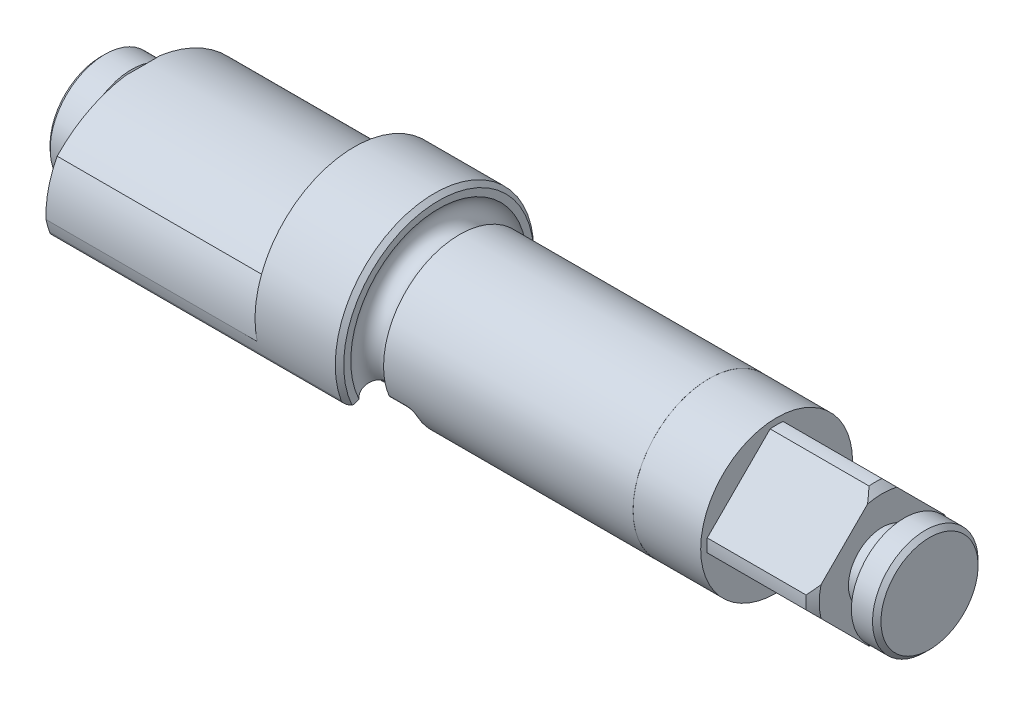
ISO-10303-21;
HEADER;
FILE_DESCRIPTION(('STEP AP214'),'2;1');
FILE_NAME('part.step','',(''),(''),'','','');
FILE_SCHEMA(('AUTOMOTIVE_DESIGN { 1 0 10303 214 1 1 1 1 }'));
ENDSEC;
DATA;
#1=APPLICATION_CONTEXT('core data for automotive mechanical design processes');
#2=APPLICATION_PROTOCOL_DEFINITION('international standard','automotive_design',2000,#1);
#3=PRODUCT_CONTEXT('',#1,'mechanical');
#4=PRODUCT('Part','Part','',(#3));
#5=PRODUCT_RELATED_PRODUCT_CATEGORY('part','',(#4));
#6=PRODUCT_DEFINITION_FORMATION('','',#4);
#7=PRODUCT_DEFINITION_CONTEXT('part definition',#1,'design');
#8=PRODUCT_DEFINITION('design','',#6,#7);
#9=PRODUCT_DEFINITION_SHAPE('','',#8);
#10=(LENGTH_UNIT() NAMED_UNIT(*) SI_UNIT(.MILLI.,.METRE.));
#11=(NAMED_UNIT(*) PLANE_ANGLE_UNIT() SI_UNIT($,.RADIAN.));
#12=(NAMED_UNIT(*) SI_UNIT($,.STERADIAN.) SOLID_ANGLE_UNIT());
#13=UNCERTAINTY_MEASURE_WITH_UNIT(LENGTH_MEASURE(1.E-05),#10,'distance_accuracy_value','');
#14=(GEOMETRIC_REPRESENTATION_CONTEXT(3) GLOBAL_UNCERTAINTY_ASSIGNED_CONTEXT((#13)) GLOBAL_UNIT_ASSIGNED_CONTEXT((#10,
#11,#12)) REPRESENTATION_CONTEXT('',''));
#15=CARTESIAN_POINT('',(0.,0.,0.));
#16=DIRECTION('',(0.,0.,1.));
#17=DIRECTION('',(1.,0.,0.));
#18=AXIS2_PLACEMENT_3D('',#15,#16,#17);
#19=CARTESIAN_POINT('',(45.,-3.1696369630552,6.7973084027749));
#20=DIRECTION('',(0.,0.906307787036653,0.422618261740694));
#21=DIRECTION('',(0.,-0.422618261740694,0.906307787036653));
#22=AXIS2_PLACEMENT_3D('',#19,#20,#21);
#23=PLANE('',#22);
#24=DIRECTION('',(0.,0.422618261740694,-0.906307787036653));
#25=VECTOR('',#24,1.);
#26=CARTESIAN_POINT('',(40.,2.09862279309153,-4.50051110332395));
#27=LINE('',#26,#25);
#28=CARTESIAN_POINT('',(40.,-4.52344694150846,9.70056327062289));
#29=VERTEX_POINT('',#28);
#30=CARTESIAN_POINT('',(40.,-4.40285141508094,9.44194532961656));
#31=VERTEX_POINT('',#30);
#32=EDGE_CURVE('E629',#29,#31,#27,.T.);
#33=ORIENTED_EDGE('',*,*,#32,.F.);
#34=DIRECTION('',(-1.,0.,0.));
#35=VECTOR('',#34,1.);
#36=CARTESIAN_POINT('',(45.,-4.52344694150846,9.70056327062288));
#37=LINE('',#36,#35);
#38=CARTESIAN_POINT('',(5.,-4.52344694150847,9.70056327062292));
#39=VERTEX_POINT('',#38);
#40=EDGE_CURVE('E1160',#29,#39,#37,.T.);
#41=ORIENTED_EDGE('',*,*,#40,.T.);
#42=DIRECTION('',(0.,0.422618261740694,-0.906307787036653));
#43=VECTOR('',#42,1.);
#44=CARTESIAN_POINT('',(5.,-3.1696369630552,6.7973084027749));
#45=LINE('',#44,#43);
#46=CARTESIAN_POINT('',(5.,-3.56730870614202,7.6501182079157));
#47=VERTEX_POINT('',#46);
#48=EDGE_CURVE('E1086',#39,#47,#45,.T.);
#49=ORIENTED_EDGE('',*,*,#48,.T.);
#50=DIRECTION('',(1.,0.,0.));
#51=VECTOR('',#50,1.);
#52=CARTESIAN_POINT('',(45.,-3.56730870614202,7.6501182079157));
#53=LINE('',#52,#51);
#54=CARTESIAN_POINT('',(39.7703374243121,-3.56730870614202,7.65011820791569));
#55=VERTEX_POINT('',#54);
#56=EDGE_CURVE('E1198',#47,#55,#53,.T.);
#57=ORIENTED_EDGE('',*,*,#56,.T.);
#58=CARTESIAN_POINT('',(41.,-3.93034983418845,8.42866241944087));
#59=DIRECTION('',(0.,0.906307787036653,0.422618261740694));
#60=DIRECTION('',(0.,-0.422618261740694,0.906307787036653));
#61=AXIS2_PLACEMENT_3D('',#58,#59,#60);
#62=CIRCLE('',#61,1.5);
#63=EDGE_CURVE('E1083',#55,#31,#62,.T.);
#64=ORIENTED_EDGE('',*,*,#63,.T.);
#65=EDGE_LOOP('',(#33,#41,#49,#57,#64));
#66=FACE_BOUND('',#65,.T.);
#67=ADVANCED_FACE('F358',(#66),#23,.F.);
#68=CARTESIAN_POINT('',(45.,-3.1696369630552,-6.79730840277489));
#69=DIRECTION('',(0.,0.906307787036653,-0.422618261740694));
#70=DIRECTION('',(0.,0.422618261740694,0.906307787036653));
#71=AXIS2_PLACEMENT_3D('',#68,#69,#70);
#72=PLANE('',#71);
#73=CARTESIAN_POINT('',(41.,-3.93034983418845,-8.42866241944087));
#74=DIRECTION('',(0.,0.906307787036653,-0.422618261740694));
#75=DIRECTION('',(0.,0.422618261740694,0.906307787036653));
#76=AXIS2_PLACEMENT_3D('',#73,#74,#75);
#77=CIRCLE('',#76,1.5);
#78=CARTESIAN_POINT('',(42.2296625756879,-3.56730870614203,-7.6501182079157));
#79=VERTEX_POINT('',#78);
#80=CARTESIAN_POINT('',(42.2594576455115,-3.58603486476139,-7.69027658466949));
#81=VERTEX_POINT('',#80);
#82=EDGE_CURVE('E642',#79,#81,#77,.T.);
#83=ORIENTED_EDGE('',*,*,#82,.T.);
#84=DIRECTION('',(-1.,0.,0.));
#85=VECTOR('',#84,1.);
#86=CARTESIAN_POINT('',(45.,-3.58603486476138,-7.69027658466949));
#87=LINE('',#86,#85);
#88=CARTESIAN_POINT('',(44.5,-3.58603486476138,-7.69027658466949));
#89=VERTEX_POINT('',#88);
#90=EDGE_CURVE('E964',#81,#89,#87,.F.);
#91=ORIENTED_EDGE('',*,*,#90,.T.);
#92=DIRECTION('',(0.,-0.422618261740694,-0.906307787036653));
#93=VECTOR('',#92,1.);
#94=CARTESIAN_POINT('',(44.5,-3.1696369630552,-6.79730840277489));
#95=LINE('',#94,#93);
#96=CARTESIAN_POINT('',(44.5,-3.56730870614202,-7.6501182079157));
#97=VERTEX_POINT('',#96);
#98=EDGE_CURVE('E951',#89,#97,#95,.F.);
#99=ORIENTED_EDGE('',*,*,#98,.T.);
#100=DIRECTION('',(1.,0.,0.));
#101=VECTOR('',#100,1.);
#102=CARTESIAN_POINT('',(5.36602540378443,-3.56730870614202,-7.6501182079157));
#103=LINE('',#102,#101);
#104=EDGE_CURVE('E703',#97,#79,#103,.F.);
#105=ORIENTED_EDGE('',*,*,#104,.T.);
#106=EDGE_LOOP('',(#83,#91,#99,#105));
#107=FACE_BOUND('',#106,.T.);
#108=ADVANCED_FACE('F922',(#107),#72,.F.);
#109=CARTESIAN_POINT('',(5.,6.5,0.));
#110=DIRECTION('',(1.,0.,0.));
#111=DIRECTION('',(0.,0.,-1.));
#112=AXIS2_PLACEMENT_3D('',#109,#110,#111);
#113=PLANE('',#112);
#114=CARTESIAN_POINT('',(5.,0.,0.));
#115=DIRECTION('',(-1.,0.,0.));
#116=DIRECTION('',(0.,0.,1.));
#117=AXIS2_PLACEMENT_3D('',#114,#115,#116);
#118=CIRCLE('',#117,11.75);
#119=CARTESIAN_POINT('',(5.,-2.45312500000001,-11.4910694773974));
#120=VERTEX_POINT('',#119);
#121=CARTESIAN_POINT('',(5.,-3.95361721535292,-11.0648728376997));
#122=VERTEX_POINT('',#121);
#123=EDGE_CURVE('E675',#120,#122,#118,.T.);
#124=ORIENTED_EDGE('',*,*,#123,.T.);
#125=CARTESIAN_POINT('',(5.,-3.61713915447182,-10.1231815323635));
#126=DIRECTION('',(1.,0.,0.));
#127=DIRECTION('',(0.,0.,-1.));
#128=AXIS2_PLACEMENT_3D('',#125,#126,#127);
#129=CIRCLE('',#128,1.);
#130=CARTESIAN_POINT('',(5.,-4.52344694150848,-9.70056327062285));
#131=VERTEX_POINT('',#130);
#132=EDGE_CURVE('E1210',#122,#131,#129,.F.);
#133=ORIENTED_EDGE('',*,*,#132,.T.);
#134=DIRECTION('',(0.,-0.422618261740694,-0.906307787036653));
#135=VECTOR('',#134,1.);
#136=CARTESIAN_POINT('',(5.,-3.1696369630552,-6.79730840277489));
#137=LINE('',#136,#135);
#138=CARTESIAN_POINT('',(5.,-3.56730870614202,-7.6501182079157));
#139=VERTEX_POINT('',#138);
#140=EDGE_CURVE('E1085',#139,#131,#137,.T.);
#141=ORIENTED_EDGE('',*,*,#140,.F.);
#142=CARTESIAN_POINT('',(4.99999999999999,-4.47361649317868,-7.22749994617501));
#143=DIRECTION('',(1.,0.,0.));
#144=DIRECTION('',(0.,0.,-1.));
#145=AXIS2_PLACEMENT_3D('',#142,#143,#144);
#146=CIRCLE('',#145,1.);
#147=CARTESIAN_POINT('',(5.,-3.48956212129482,-7.04963203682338));
#148=VERTEX_POINT('',#147);
#149=EDGE_CURVE('E1199',#139,#148,#146,.T.);
#150=ORIENTED_EDGE('',*,*,#149,.T.);
#151=CARTESIAN_POINT('',(5.,0.,0.));
#152=DIRECTION('',(1.,0.,0.));
#153=DIRECTION('',(0.,0.,-1.));
#154=AXIS2_PLACEMENT_3D('',#151,#152,#153);
#155=CIRCLE('',#154,7.86602540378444);
#156=CARTESIAN_POINT('',(5.,7.60505154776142,-2.00936472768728));
#157=VERTEX_POINT('',#156);
#158=EDGE_CURVE('E649',#157,#148,#155,.F.);
#159=ORIENTED_EDGE('',*,*,#158,.F.);
#160=CARTESIAN_POINT('',(5.,-6.25,0.));
#161=DIRECTION('',(1.,0.,0.));
#162=DIRECTION('',(0.,0.,1.));
#163=AXIS2_PLACEMENT_3D('',#160,#161,#162);
#164=CIRCLE('',#163,14.);
#165=CARTESIAN_POINT('',(5.,3.37500000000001,-10.1665812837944));
#166=VERTEX_POINT('',#165);
#167=EDGE_CURVE('E1278',#166,#157,#164,.T.);
#168=ORIENTED_EDGE('',*,*,#167,.F.);
#169=CARTESIAN_POINT('',(5.,-1.99999999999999,0.));
#170=DIRECTION('',(1.,0.,0.));
#171=DIRECTION('',(0.,0.,-1.));
#172=AXIS2_PLACEMENT_3D('',#169,#170,#171);
#173=CIRCLE('',#172,11.5);
#174=EDGE_CURVE('E640',#120,#166,#173,.T.);
#175=ORIENTED_EDGE('',*,*,#174,.F.);
#176=EDGE_LOOP('',(#124,#133,#141,#150,#159,#168,#175));
#177=FACE_BOUND('',#176,.T.);
#178=ADVANCED_FACE('F928',(#177),#113,.F.);
#179=CARTESIAN_POINT('',(-130.,0.,0.));
#180=DIRECTION('',(-1.,0.,0.));
#181=DIRECTION('',(0.,0.,1.));
#182=AXIS2_PLACEMENT_3D('',#179,#180,#181);
#183=CYLINDRICAL_SURFACE('',#182,9.);
#184=CARTESIAN_POINT('',(72.,0.,0.));
#185=DIRECTION('',(-1.,0.,0.));
#186=DIRECTION('',(0.,0.,1.));
#187=AXIS2_PLACEMENT_3D('',#184,#185,#186);
#188=CIRCLE('',#187,9.);
#189=CARTESIAN_POINT('',(72.,0.,9.));
#190=VERTEX_POINT('',#189);
#191=EDGE_CURVE('E671',#190,#190,#188,.T.);
#192=ORIENTED_EDGE('',*,*,#191,.T.);
#193=EDGE_LOOP('',(#192));
#194=FACE_BOUND('',#193,.T.);
#195=CARTESIAN_POINT('',(44.9717850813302,-4.17826564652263,-7.38540813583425));
#196=CARTESIAN_POINT('',(44.9559955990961,-4.43637231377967,-7.83247122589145));
#197=CARTESIAN_POINT('',(45.4435701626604,-4.58294594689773,-7.74574763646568));
#198=CARTESIAN_POINT('',(44.9811149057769,-4.15645171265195,-7.40135202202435));
#199=CARTESIAN_POINT('',(44.968680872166,-4.41189255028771,-7.84572859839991));
#200=CARTESIAN_POINT('',(45.4622298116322,-4.53441093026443,-7.77449129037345));
#201=CARTESIAN_POINT('',(44.9881692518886,-4.13373623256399,-7.41729059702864));
#202=CARTESIAN_POINT('',(44.9788707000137,-4.38586930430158,-7.85984519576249));
#203=CARTESIAN_POINT('',(45.4763385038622,-4.48413940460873,-7.80359394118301));
#204=CARTESIAN_POINT('',(44.9976095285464,-4.0871616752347,-7.44864431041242));
#205=CARTESIAN_POINT('',(44.9936732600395,-4.33227156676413,-7.8888974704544));
#206=CARTESIAN_POINT('',(45.4952190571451,-4.3816031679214,-7.86160981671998));
#207=CARTESIAN_POINT('',(44.9999983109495,-4.06330330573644,-7.46405976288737));
#208=CARTESIAN_POINT('',(44.9983350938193,-4.30465180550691,-7.90385781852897));
#209=CARTESIAN_POINT('',(45.4999966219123,-4.32933969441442,-7.89052314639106));
#210=CARTESIAN_POINT('',(45.0000016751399,-4.0152728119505,-7.49375236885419));
#211=CARTESIAN_POINT('',(45.001645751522,-4.24924495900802,-7.93378247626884));
#212=CARTESIAN_POINT('',(45.5000033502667,-4.22466930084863,-7.94705652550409));
#213=CARTESIAN_POINT('',(44.9976554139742,-3.99110488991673,-7.50803785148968));
#214=CARTESIAN_POINT('',(45.0003668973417,-4.22140118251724,-7.94877839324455));
#215=CARTESIAN_POINT('',(45.4953108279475,-4.17226710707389,-7.97468526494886));
#216=CARTESIAN_POINT('',(44.988328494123,-3.94298377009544,-7.53524672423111));
#217=CARTESIAN_POINT('',(44.9920272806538,-4.16657653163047,-7.9782192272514));
#218=CARTESIAN_POINT('',(45.4766569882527,-4.06842922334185,-8.02815585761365));
#219=CARTESIAN_POINT('',(44.981349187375,-3.9190305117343,-7.54817051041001));
#220=CARTESIAN_POINT('',(44.9849653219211,-4.13953487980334,-7.99269690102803));
#221=CARTESIAN_POINT('',(45.4626983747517,-4.01699325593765,-8.05399822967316));
#222=CARTESIAN_POINT('',(44.9629534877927,-3.87208892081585,-7.57240279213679));
#223=CARTESIAN_POINT('',(44.9655354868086,-4.0874583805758,-8.02052978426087));
#224=CARTESIAN_POINT('',(45.4259069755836,-3.91663729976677,-8.10327586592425));
#225=CARTESIAN_POINT('',(44.9515402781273,-3.84909990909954,-7.58371243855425));
#226=CARTESIAN_POINT('',(44.9531476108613,-4.0623741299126,-8.03391138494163));
#227=CARTESIAN_POINT('',(45.4030805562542,-3.86771553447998,-8.12671284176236));
#228=CARTESIAN_POINT('',(44.924576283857,-3.80477201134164,-7.6046114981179));
#229=CARTESIAN_POINT('',(44.9238183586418,-4.01508683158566,-8.05915037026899));
#230=CARTESIAN_POINT('',(45.3491525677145,-3.77375197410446,-8.17077083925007));
#231=CARTESIAN_POINT('',(44.9090185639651,-3.7834359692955,-7.61419798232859));
#232=CARTESIAN_POINT('',(44.9068355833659,-3.99286177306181,-8.07101956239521));
#233=CARTESIAN_POINT('',(45.3180371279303,-3.72871685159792,-8.19138705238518));
#234=CARTESIAN_POINT('',(44.8741964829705,-3.74314752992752,-7.63159881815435));
#235=CARTESIAN_POINT('',(44.869268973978,-3.95197984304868,-8.09292416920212));
#236=CARTESIAN_POINT('',(45.2483929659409,-3.64396224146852,-8.2294412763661));
#237=CARTESIAN_POINT('',(44.8549282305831,-3.72419766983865,-7.63941129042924));
#238=CARTESIAN_POINT('',(44.8486508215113,-3.9333226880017,-8.10296012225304));
#239=CARTESIAN_POINT('',(45.2098564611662,-3.60424840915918,-8.24687591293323));
#240=CARTESIAN_POINT('',(44.8132753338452,-3.6893868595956,-7.65327354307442));
#241=CARTESIAN_POINT('',(44.8048748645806,-3.89998128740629,-8.12100166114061));
#242=CARTESIAN_POINT('',(45.1265506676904,-3.53149267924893,-8.27829274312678));
#243=CARTESIAN_POINT('',(44.7908957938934,-3.67352095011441,-7.65932616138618));
#244=CARTESIAN_POINT('',(44.7817050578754,-3.88530460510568,-8.12900349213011));
#245=CARTESIAN_POINT('',(45.0817915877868,-3.49844006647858,-8.29228048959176));
#246=CARTESIAN_POINT('',(44.743495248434,-3.64532357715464,-7.66978702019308));
#247=CARTESIAN_POINT('',(44.7335833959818,-3.85988029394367,-8.14296949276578));
#248=CARTESIAN_POINT('',(44.986990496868,-3.43981802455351,-8.31677049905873));
#249=CARTESIAN_POINT('',(44.7184611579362,-3.63301085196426,-7.67418657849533));
#250=CARTESIAN_POINT('',(44.7086277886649,-3.84917746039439,-8.14891021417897));
#251=CARTESIAN_POINT('',(44.9369223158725,-3.41428825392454,-8.32725432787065));
#252=CARTESIAN_POINT('',(44.6665988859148,-3.61248635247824,-7.68137811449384));
#253=CARTESIAN_POINT('',(44.6578098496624,-3.83168931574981,-8.15868742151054));
#254=CARTESIAN_POINT('',(44.8331977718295,-3.37178949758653,-8.34455267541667));
#255=CARTESIAN_POINT('',(44.639772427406,-3.60427070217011,-7.68417161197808));
#256=CARTESIAN_POINT('',(44.6319728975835,-3.82492394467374,-8.16251298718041));
#257=CARTESIAN_POINT('',(44.7795448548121,-3.35481242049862,-8.35137066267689));
#258=CARTESIAN_POINT('',(44.5755839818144,-3.59016244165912,-7.68892797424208));
#259=CARTESIAN_POINT('',(44.5708221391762,-3.81339790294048,-8.16905543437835));
#260=CARTESIAN_POINT('',(44.6511679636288,-3.32567519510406,-8.36302794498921));
#261=CARTESIAN_POINT('',(44.5377697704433,-3.58603860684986,-7.69027541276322));
#262=CARTESIAN_POINT('',(44.5354194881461,-3.81016443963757,-8.17091734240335));
#263=CARTESIAN_POINT('',(44.5755395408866,-3.31717577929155,-8.36638189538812));
#264=CARTESIAN_POINT('',(44.4719436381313,-3.58603208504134,-7.69027745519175));
#265=CARTESIAN_POINT('',(44.4736894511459,-3.81016026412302,-8.17092000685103));
#266=CARTESIAN_POINT('',(44.4438872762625,-3.31716237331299,-8.36638708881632));
#267=CARTESIAN_POINT('',(44.443911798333,-3.58830273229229,-7.68953546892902));
#268=CARTESIAN_POINT('',(44.4474256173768,-3.81194202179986,-8.16989421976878));
#269=CARTESIAN_POINT('',(44.3878235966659,-3.3218423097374,-8.36454026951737));
#270=CARTESIAN_POINT('',(44.3885326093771,-3.59727392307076,-7.68653156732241));
#271=CARTESIAN_POINT('',(44.3950697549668,-3.8192108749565,-8.1657549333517));
#272=CARTESIAN_POINT('',(44.2770652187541,-3.34036180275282,-8.35715329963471));
#273=CARTESIAN_POINT('',(44.3611882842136,-3.60399135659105,-7.68426385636));
#274=CARTESIAN_POINT('',(44.3690206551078,-3.82469984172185,-8.16264041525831));
#275=CARTESIAN_POINT('',(44.2223765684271,-3.35423628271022,-8.35159906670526));
#276=CARTESIAN_POINT('',(44.3346167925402,-3.61286427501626,-7.68121884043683));
#277=CARTESIAN_POINT('',(44.3431862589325,-3.83209738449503,-8.15847277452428));
#278=CARTESIAN_POINT('',(44.1692335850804,-3.37258292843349,-8.34420064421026));
#279=(BOUNDED_SURFACE() B_SPLINE_SURFACE(3,2,((#195,#196,#197),(#198,#199,#200),(#201,#202,
#203),(#204,#205,#206),(#207,#208,#209),(#210,#211,#212),(#213,#214,#215),(#216,#217,#218),
(#219,#220,#221),(#222,#223,#224),(#225,#226,#227),(#228,#229,#230),(#231,#232,#233),(#234,#235,
#236),(#237,#238,#239),(#240,#241,#242),(#243,#244,#245),(#246,#247,#248),(#249,#250,#251),
(#252,#253,#254),(#255,#256,#257),(#258,#259,#260),(#261,#262,#263),(#264,#265,#266),(#267,#268,
#269),(#270,#271,#272),(#273,#274,#275),(#276,#277,#278)),.UNSPECIFIED.,.F.,.F.,
.F.) B_SPLINE_SURFACE_WITH_KNOTS((4,2,2,2,2,2,2,2,2,2,2,2,2,4),(3,3),(0.,0.169131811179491,
0.338160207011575,0.505796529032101,0.673383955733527,0.840851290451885,1.00860063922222,
1.17652687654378,1.34418079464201,1.51270334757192,1.68106616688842,1.90729178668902,
2.07533802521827,2.24402623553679),(0.,1.),
.UNSPECIFIED.) GEOMETRIC_REPRESENTATION_ITEM() RATIONAL_B_SPLINE_SURFACE(((1.,0.695563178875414,
1.),(1.,0.698183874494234,1.),(1.,0.700484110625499,1.),(1.,0.704359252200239,1.),(1.,
0.705934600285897,1.),(1.,0.708269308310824,1.),(1.,0.709035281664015,1.),(1.,0.709794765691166,
1.),(1.,0.709788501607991,1.),(1.,0.709096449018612,1.),(1.,0.708411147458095,1.),(1.,
0.706520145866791,1.),(1.,0.705313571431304,1.),(1.,0.702588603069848,1.),(1.,0.701069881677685,
1.),(1.,0.697962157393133,1.),(1.,0.696373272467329,1.),(1.,0.693353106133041,1.),(1.,
0.691922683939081,1.),(1.,0.689442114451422,1.),(1.,0.688391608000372,1.),(1.,0.686559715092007,
1.),(1.,0.685994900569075,1.),(1.,0.685993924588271,1.),(1.,0.686304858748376,1.),(1.,
0.687483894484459,1.),(1.,0.688354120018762,1.),(1.,0.689469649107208,1.))) REPRESENTATION_ITEM('') SURFACE());
#280=CARTESIAN_POINT('',(45.4435701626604,-4.58294594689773,-7.74574763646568));
#281=CARTESIAN_POINT('',(45.4622298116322,-4.53441093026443,-7.77449129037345));
#282=CARTESIAN_POINT('',(45.4763385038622,-4.48413940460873,-7.80359394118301));
#283=CARTESIAN_POINT('',(45.4952190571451,-4.3816031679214,-7.86160981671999));
#284=CARTESIAN_POINT('',(45.4999966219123,-4.32933969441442,-7.89052314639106));
#285=CARTESIAN_POINT('',(45.5000033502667,-4.22466930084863,-7.94705652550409));
#286=CARTESIAN_POINT('',(45.4953108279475,-4.17226710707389,-7.97468526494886));
#287=CARTESIAN_POINT('',(45.4766569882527,-4.06842922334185,-8.02815585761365));
#288=CARTESIAN_POINT('',(45.4626983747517,-4.01699325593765,-8.05399822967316));
#289=CARTESIAN_POINT('',(45.4259069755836,-3.91663729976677,-8.10327586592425));
#290=CARTESIAN_POINT('',(45.4030805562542,-3.86771553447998,-8.12671284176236));
#291=CARTESIAN_POINT('',(45.3491525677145,-3.77375197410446,-8.17077083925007));
#292=CARTESIAN_POINT('',(45.3180371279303,-3.72871685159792,-8.19138705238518));
#293=CARTESIAN_POINT('',(45.2483929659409,-3.64396224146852,-8.2294412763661));
#294=CARTESIAN_POINT('',(45.2098564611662,-3.60424840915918,-8.24687591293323));
#295=CARTESIAN_POINT('',(45.1265506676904,-3.53149267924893,-8.27829274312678));
#296=CARTESIAN_POINT('',(45.0817915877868,-3.49844006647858,-8.29228048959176));
#297=CARTESIAN_POINT('',(44.986990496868,-3.43981802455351,-8.31677049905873));
#298=CARTESIAN_POINT('',(44.9369223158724,-3.41428825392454,-8.32725432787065));
#299=CARTESIAN_POINT('',(44.8331977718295,-3.37178949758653,-8.34455267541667));
#300=CARTESIAN_POINT('',(44.7795448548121,-3.35481242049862,-8.35137066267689));
#301=CARTESIAN_POINT('',(44.6511679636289,-3.32567519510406,-8.36302794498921));
#302=CARTESIAN_POINT('',(44.5755395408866,-3.31717577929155,-8.36638189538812));
#303=CARTESIAN_POINT('',(44.4438872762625,-3.31716237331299,-8.36638708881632));
#304=CARTESIAN_POINT('',(44.3878235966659,-3.3218423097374,-8.36454026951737));
#305=CARTESIAN_POINT('',(44.2770652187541,-3.34036180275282,-8.35715329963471));
#306=CARTESIAN_POINT('',(44.2223765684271,-3.35423628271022,-8.35159906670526));
#307=CARTESIAN_POINT('',(44.1692335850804,-3.37258292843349,-8.34420064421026));
#308=B_SPLINE_CURVE_WITH_KNOTS('',3,(#280,#281,#282,#283,#284,#285,#286,#287,#288,#289,#290,
#291,#292,#293,#294,#295,#296,#297,#298,#299,#300,#301,#302,#303,#304,#305,#306,#307),
.UNSPECIFIED.,.F.,.F.,(4,2,2,2,2,2,2,2,2,2,2,2,2,4),(0.,0.169131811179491,0.338160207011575,
0.505796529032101,0.673383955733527,0.840851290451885,1.00860063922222,1.17652687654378,
1.34418079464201,1.51270334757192,1.68106616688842,1.90729178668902,2.07533802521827,
2.24402623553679),.UNSPECIFIED.);
#309=CARTESIAN_POINT('',(45.5,-4.27678809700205,-7.91890671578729));
#310=VERTEX_POINT('',#309);
#311=CARTESIAN_POINT('',(44.5,-3.31716808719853,-8.36638487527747));
#312=VERTEX_POINT('',#311);
#313=EDGE_CURVE('E1062',#310,#312,#308,.T.);
#314=ORIENTED_EDGE('',*,*,#313,.T.);
#315=DIRECTION('',(-1.,0.,0.));
#316=VECTOR('',#315,1.);
#317=CARTESIAN_POINT('',(-130.,-3.31716808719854,-8.36638487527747));
#318=LINE('',#317,#316);
#319=CARTESIAN_POINT('',(42.4696938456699,-3.31716808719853,-8.36638487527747));
#320=VERTEX_POINT('',#319);
#321=EDGE_CURVE('E1005',#312,#320,#318,.T.);
#322=ORIENTED_EDGE('',*,*,#321,.T.);
#323=CARTESIAN_POINT('',(42.4696938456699,0.,0.));
#324=DIRECTION('',(-1.,0.,0.));
#325=DIRECTION('',(0.,0.,1.));
#326=AXIS2_PLACEMENT_3D('',#323,#324,#325);
#327=CIRCLE('',#326,9.);
#328=CARTESIAN_POINT('',(42.4696938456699,-3.31716808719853,8.36638487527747));
#329=VERTEX_POINT('',#328);
#330=EDGE_CURVE('E647',#329,#320,#327,.T.);
#331=ORIENTED_EDGE('',*,*,#330,.F.);
#332=DIRECTION('',(-1.,0.,0.));
#333=VECTOR('',#332,1.);
#334=CARTESIAN_POINT('',(-130.,-3.31716808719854,8.36638487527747));
#335=LINE('',#334,#333);
#336=CARTESIAN_POINT('',(44.5,-3.31716808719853,8.36638487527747));
#337=VERTEX_POINT('',#336);
#338=EDGE_CURVE('E1068',#329,#337,#335,.F.);
#339=ORIENTED_EDGE('',*,*,#338,.T.);
#340=CARTESIAN_POINT('',(44.3346167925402,-3.61286427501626,7.68121884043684));
#341=CARTESIAN_POINT('',(44.3431862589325,-3.83209738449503,8.15847277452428));
#342=CARTESIAN_POINT('',(44.1692335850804,-3.37258292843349,8.34420064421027));
#343=CARTESIAN_POINT('',(44.3611315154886,-3.60400004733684,7.68425959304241));
#344=CARTESIAN_POINT('',(44.3689623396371,-3.82471138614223,8.1626346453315));
#345=CARTESIAN_POINT('',(44.2222630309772,-3.35425477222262,8.35159022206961));
#346=CARTESIAN_POINT('',(44.3884409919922,-3.59729201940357,7.68652484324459));
#347=CARTESIAN_POINT('',(44.3949806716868,-3.8192277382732,8.16574572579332));
#348=CARTESIAN_POINT('',(44.2768819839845,-3.34039942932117,8.35713756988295));
#349=CARTESIAN_POINT('',(44.4438338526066,-3.5883121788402,7.68953300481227));
#350=CARTESIAN_POINT('',(44.4473543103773,-3.81194735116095,8.16989076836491));
#351=CARTESIAN_POINT('',(44.3876677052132,-3.32186152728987,8.36453336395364));
#352=CARTESIAN_POINT('',(44.4719166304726,-3.5860369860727,7.69027707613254));
#353=CARTESIAN_POINT('',(44.4736675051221,-3.81016002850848,8.17091939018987));
#354=CARTESIAN_POINT('',(44.4438332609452,-3.31717197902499,8.36638462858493));
#355=CARTESIAN_POINT('',(44.5280967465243,-3.58603274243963,7.69027609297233));
#356=CARTESIAN_POINT('',(44.5263451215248,-3.81016406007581,8.17091835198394));
#357=CARTESIAN_POINT('',(44.5561934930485,-3.31716419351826,8.36638512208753));
#358=CARTESIAN_POINT('',(44.5561940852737,-3.58830585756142,7.68953032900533));
#359=CARTESIAN_POINT('',(44.5526619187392,-3.81195712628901,8.16988770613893));
#360=CARTESIAN_POINT('',(44.6123881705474,-3.32185042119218,8.36453258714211));
#361=CARTESIAN_POINT('',(44.6115840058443,-3.59730694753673,7.68652465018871));
#362=CARTESIAN_POINT('',(44.6050528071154,-3.819224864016,8.16574485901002));
#363=CARTESIAN_POINT('',(44.7231680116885,-3.34042829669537,8.35713127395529));
#364=CARTESIAN_POINT('',(44.6388767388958,-3.60403407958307,7.68426502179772));
#365=CARTESIAN_POINT('',(44.6310839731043,-3.82468646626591,8.16264007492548));
#366=CARTESIAN_POINT('',(44.7777534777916,-3.35431820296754,8.35158319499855));
#367=CARTESIAN_POINT('',(44.6918682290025,-3.62168732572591,7.67817512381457));
#368=CARTESIAN_POINT('',(44.6824408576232,-3.83947873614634,8.15432209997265));
#369=CARTESIAN_POINT('',(44.883736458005,-3.39083287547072,8.33682406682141));
#370=CARTESIAN_POINT('',(44.717568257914,-3.6326100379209,7.67434612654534));
#371=CARTESIAN_POINT('',(44.7077365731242,-3.84878455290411,8.14912261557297));
#372=CARTESIAN_POINT('',(44.9351365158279,-3.41345056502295,8.32761598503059));
#373=CARTESIAN_POINT('',(44.766715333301,-3.65827753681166,7.66502714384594));
#374=CARTESIAN_POINT('',(44.75700596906,-3.87145812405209,8.13659245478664));
#375=CARTESIAN_POINT('',(45.033430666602,-3.46673056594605,8.30557696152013));
#376=CARTESIAN_POINT('',(44.7901585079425,-3.6730287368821,7.65953436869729));
#377=CARTESIAN_POINT('',(44.7809658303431,-3.88480798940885,8.12927138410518));
#378=CARTESIAN_POINT('',(45.080317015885,-3.49740637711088,8.29273993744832));
#379=CARTESIAN_POINT('',(44.8341041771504,-3.70583571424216,7.64680092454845));
#380=CARTESIAN_POINT('',(44.826631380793,-3.91558555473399,8.11253914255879));
#381=CARTESIAN_POINT('',(45.1682083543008,-3.56583985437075,8.26354444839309));
#382=CARTESIAN_POINT('',(44.8546034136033,-3.72389510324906,7.63955834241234));
#383=CARTESIAN_POINT('',(44.8483442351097,-3.93299907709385,8.10313524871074));
#384=CARTESIAN_POINT('',(45.2092068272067,-3.60360526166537,8.24718213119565));
#385=CARTESIAN_POINT('',(44.8920162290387,-3.76264294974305,7.62329109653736));
#386=CARTESIAN_POINT('',(44.888409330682,-3.97158292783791,8.08240679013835));
#387=CARTESIAN_POINT('',(45.2840324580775,-3.68492905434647,8.21116734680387));
#388=CARTESIAN_POINT('',(44.9089357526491,-3.78332695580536,7.61426943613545));
#389=CARTESIAN_POINT('',(44.906793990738,-3.99274392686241,8.07108667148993));
#390=CARTESIAN_POINT('',(45.3178715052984,-3.72847763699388,8.19152043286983));
#391=CARTESIAN_POINT('',(44.9387487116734,-3.82664806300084,7.59444479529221));
#392=CARTESIAN_POINT('',(44.9392226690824,-4.03823968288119,8.04678809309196));
#393=CARTESIAN_POINT('',(45.3774974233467,-3.82006383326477,8.14921154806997));
#394=CARTESIAN_POINT('',(44.9516424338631,-3.84928502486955,7.58364194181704));
#395=CARTESIAN_POINT('',(44.9533016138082,-4.06259369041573,8.03379923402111));
#396=CARTESIAN_POINT('',(45.4032848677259,-3.86810112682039,8.12654979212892));
#397=CARTESIAN_POINT('',(44.9730268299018,-3.89573043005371,7.56037726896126));
#398=CARTESIAN_POINT('',(44.9762618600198,-4.11352473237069,8.00660416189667));
#399=CARTESIAN_POINT('',(45.4460536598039,-3.96710775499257,8.0786808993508));
#400=CARTESIAN_POINT('',(44.981521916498,-3.91953767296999,7.54791712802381));
#401=CARTESIAN_POINT('',(44.9851771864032,-4.14014162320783,7.99237674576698));
#402=CARTESIAN_POINT('',(45.4630438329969,-4.01807409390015,8.05347634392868));
#403=CARTESIAN_POINT('',(44.9958641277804,-3.97533115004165,7.51728263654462));
#404=CARTESIAN_POINT('',(44.9991867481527,-4.2032594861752,7.95854086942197));
#405=CARTESIAN_POINT('',(45.4917282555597,-4.13809765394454,7.99261925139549));
#406=CARTESIAN_POINT('',(44.999996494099,-4.00749896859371,7.49855496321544));
#407=CARTESIAN_POINT('',(45.0021668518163,-4.24031420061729,7.93860490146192));
#408=CARTESIAN_POINT('',(45.4999929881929,-4.20772946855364,7.95620256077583));
#409=CARTESIAN_POINT('',(45.0000026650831,-4.06327840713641,7.46407760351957));
#410=CARTESIAN_POINT('',(44.9983465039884,-4.30462084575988,7.90387529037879));
#411=CARTESIAN_POINT('',(45.5000053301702,-4.32928444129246,7.89055550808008));
#412=CARTESIAN_POINT('',(44.9976194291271,-4.08709182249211,7.44869088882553));
#413=CARTESIAN_POINT('',(44.9936927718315,-4.33218945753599,7.88894233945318));
#414=CARTESIAN_POINT('',(45.4952388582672,-4.38144956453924,7.86169627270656));
#415=CARTESIAN_POINT('',(44.9881898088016,-4.13365605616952,7.41734507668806));
#416=CARTESIAN_POINT('',(44.9788991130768,-4.38577875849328,7.85989392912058));
#417=CARTESIAN_POINT('',(45.4763796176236,-4.48396268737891,7.80369444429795));
#418=CARTESIAN_POINT('',(44.9811256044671,-4.1564024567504,7.4013840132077));
#419=CARTESIAN_POINT('',(44.9686924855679,-4.41183908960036,7.84575677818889));
#420=CARTESIAN_POINT('',(45.4622512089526,-4.53430296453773,7.77455118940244));
#421=CARTESIAN_POINT('',(44.9717850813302,-4.17826564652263,7.38540813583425));
#422=CARTESIAN_POINT('',(44.9559955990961,-4.43637231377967,7.83247122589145));
#423=CARTESIAN_POINT('',(45.4435701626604,-4.58294594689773,7.74574763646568));
#424=(BOUNDED_SURFACE() B_SPLINE_SURFACE(3,2,((#340,#341,#342),(#343,#344,#345),(#346,#347,
#348),(#349,#350,#351),(#352,#353,#354),(#355,#356,#357),(#358,#359,#360),(#361,#362,#363),
(#364,#365,#366),(#367,#368,#369),(#370,#371,#372),(#373,#374,#375),(#376,#377,#378),(#379,#380,
#381),(#382,#383,#384),(#385,#386,#387),(#388,#389,#390),(#391,#392,#393),(#394,#395,#396),
(#397,#398,#399),(#400,#401,#402),(#403,#404,#405),(#406,#407,#408),(#409,#410,#411),(#412,#413,
#414),(#415,#416,#417),(#418,#419,#420),(#421,#422,#423)),.UNSPECIFIED.,.F.,.F.,
.F.) B_SPLINE_SURFACE_WITH_KNOTS((4,2,2,2,2,2,2,2,2,2,2,2,2,4),(3,3),(0.,0.168431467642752,
0.336734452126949,0.50511760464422,0.673468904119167,0.841683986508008,1.01018269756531,
1.17886647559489,1.3472678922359,1.51565731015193,1.68387746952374,1.90587633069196,
2.07463335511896,2.24403653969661),(0.,1.),
.UNSPECIFIED.) GEOMETRIC_REPRESENTATION_ITEM() RATIONAL_B_SPLINE_SURFACE(((1.,0.689469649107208,
1.),(1.,0.688354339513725,1.),(1.,0.687485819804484,1.),(1.,0.6863065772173,1.),(1.,
0.685995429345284,1.),(1.,0.685993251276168,1.),(1.,0.686302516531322,1.),(1.,0.687491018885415,
1.),(1.,0.68837014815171,1.),(1.,0.690568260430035,1.),(1.,0.69188688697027,1.),(1.,
0.694771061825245,1.),(1.,0.696337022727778,1.),(1.,0.699481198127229,1.),(1.,0.701059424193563,
1.),(1.,0.703979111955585,1.),(1.,0.70532096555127,1.),(1.,0.707545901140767,1.),(1.,
0.708429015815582,1.),(1.,0.709556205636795,1.),(1.,0.709800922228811,1.),(1.,0.709486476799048,
1.),(1.,0.708645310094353,1.),(1.,0.70593723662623,1.),(1.,0.704364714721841,1.),(1.,
0.700491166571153,1.),(1.,0.698187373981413,1.),(1.,0.695563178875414,1.))) REPRESENTATION_ITEM('') SURFACE());
#425=CARTESIAN_POINT('',(44.1692335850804,-3.37258292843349,8.34420064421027));
#426=CARTESIAN_POINT('',(44.2222630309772,-3.35425477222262,8.35159022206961));
#427=CARTESIAN_POINT('',(44.2768819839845,-3.34039942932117,8.35713756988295));
#428=CARTESIAN_POINT('',(44.3876677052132,-3.32186152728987,8.36453336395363));
#429=CARTESIAN_POINT('',(44.4438332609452,-3.31717197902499,8.36638462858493));
#430=CARTESIAN_POINT('',(44.5561934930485,-3.31716419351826,8.36638512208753));
#431=CARTESIAN_POINT('',(44.6123881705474,-3.32185042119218,8.36453258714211));
#432=CARTESIAN_POINT('',(44.7231680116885,-3.34042829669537,8.35713127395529));
#433=CARTESIAN_POINT('',(44.7777534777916,-3.35431820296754,8.35158319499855));
#434=CARTESIAN_POINT('',(44.883736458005,-3.39083287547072,8.33682406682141));
#435=CARTESIAN_POINT('',(44.9351365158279,-3.41345056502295,8.32761598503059));
#436=CARTESIAN_POINT('',(45.033430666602,-3.46673056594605,8.30557696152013));
#437=CARTESIAN_POINT('',(45.080317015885,-3.49740637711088,8.29273993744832));
#438=CARTESIAN_POINT('',(45.1682083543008,-3.56583985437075,8.26354444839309));
#439=CARTESIAN_POINT('',(45.2092068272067,-3.60360526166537,8.24718213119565));
#440=CARTESIAN_POINT('',(45.2840324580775,-3.68492905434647,8.21116734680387));
#441=CARTESIAN_POINT('',(45.3178715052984,-3.72847763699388,8.19152043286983));
#442=CARTESIAN_POINT('',(45.3774974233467,-3.82006383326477,8.14921154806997));
#443=CARTESIAN_POINT('',(45.4032848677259,-3.86810112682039,8.12654979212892));
#444=CARTESIAN_POINT('',(45.4460536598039,-3.96710775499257,8.0786808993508));
#445=CARTESIAN_POINT('',(45.4630438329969,-4.01807409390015,8.05347634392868));
#446=CARTESIAN_POINT('',(45.4917282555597,-4.13809765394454,7.99261925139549));
#447=CARTESIAN_POINT('',(45.4999929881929,-4.20772946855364,7.95620256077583));
#448=CARTESIAN_POINT('',(45.5000053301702,-4.32928444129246,7.89055550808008));
#449=CARTESIAN_POINT('',(45.4952388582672,-4.38144956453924,7.86169627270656));
#450=CARTESIAN_POINT('',(45.4763796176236,-4.48396268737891,7.80369444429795));
#451=CARTESIAN_POINT('',(45.4622512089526,-4.53430296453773,7.77455118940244));
#452=CARTESIAN_POINT('',(45.4435701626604,-4.58294594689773,7.74574763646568));
#453=B_SPLINE_CURVE_WITH_KNOTS('',3,(#425,#426,#427,#428,#429,#430,#431,#432,#433,#434,#435,
#436,#437,#438,#439,#440,#441,#442,#443,#444,#445,#446,#447,#448,#449,#450,#451,#452),
.UNSPECIFIED.,.F.,.F.,(4,2,2,2,2,2,2,2,2,2,2,2,2,4),(0.,0.168431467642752,0.336734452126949,
0.50511760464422,0.673468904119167,0.841683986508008,1.01018269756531,1.17886647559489,
1.3472678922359,1.51565731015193,1.68387746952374,1.90587633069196,2.07463335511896,
2.24403653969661),.UNSPECIFIED.);
#454=CARTESIAN_POINT('',(45.5,-4.27678809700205,7.91890671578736));
#455=VERTEX_POINT('',#454);
#456=EDGE_CURVE('E972',#337,#455,#453,.T.);
#457=ORIENTED_EDGE('',*,*,#456,.T.);
#458=CARTESIAN_POINT('',(45.5,0.,0.));
#459=DIRECTION('',(-1.,0.,0.));
#460=DIRECTION('',(0.,0.,1.));
#461=AXIS2_PLACEMENT_3D('',#458,#459,#460);
#462=CIRCLE('',#461,9.);
#463=EDGE_CURVE('E1063',#455,#310,#462,.F.);
#464=ORIENTED_EDGE('',*,*,#463,.T.);
#465=EDGE_LOOP('',(#314,#322,#331,#339,#457,#464));
#466=FACE_BOUND('',#465,.T.);
#467=ADVANCED_FACE('F1038',(#194,#466),#183,.T.);
#468=CARTESIAN_POINT('',(72.,9.,0.));
#469=DIRECTION('',(-1.,0.,0.));
#470=DIRECTION('',(0.,0.,1.));
#471=AXIS2_PLACEMENT_3D('',#468,#469,#470);
#472=PLANE('',#471);
#473=ORIENTED_EDGE('',*,*,#191,.F.);
#474=EDGE_LOOP('',(#473));
#475=FACE_BOUND('',#474,.T.);
#476=CARTESIAN_POINT('',(72.,0.,0.));
#477=DIRECTION('',(-1.,0.,0.));
#478=DIRECTION('',(0.,0.,1.));
#479=AXIS2_PLACEMENT_3D('',#476,#477,#478);
#480=CIRCLE('',#479,8.99);
#481=CARTESIAN_POINT('',(72.,0.,8.99));
#482=VERTEX_POINT('',#481);
#483=EDGE_CURVE('E668',#482,#482,#480,.T.);
#484=ORIENTED_EDGE('',*,*,#483,.T.);
#485=EDGE_LOOP('',(#484));
#486=FACE_BOUND('',#485,.T.);
#487=ADVANCED_FACE('F1320',(#475,#486),#472,.F.);
#488=CARTESIAN_POINT('',(-130.,0.,0.));
#489=DIRECTION('',(-1.,0.,0.));
#490=DIRECTION('',(0.,0.,1.));
#491=AXIS2_PLACEMENT_3D('',#488,#489,#490);
#492=CYLINDRICAL_SURFACE('',#491,8.99);
#493=ORIENTED_EDGE('',*,*,#483,.F.);
#494=EDGE_LOOP('',(#493));
#495=FACE_BOUND('',#494,.T.);
#496=CARTESIAN_POINT('',(80.,0.,0.));
#497=DIRECTION('',(1.,0.,0.));
#498=DIRECTION('',(0.,0.,-1.));
#499=AXIS2_PLACEMENT_3D('',#496,#497,#498);
#500=CIRCLE('',#499,8.99);
#501=CARTESIAN_POINT('',(80.,0.,-8.99));
#502=VERTEX_POINT('',#501);
#503=EDGE_CURVE('E651',#502,#502,#500,.T.);
#504=ORIENTED_EDGE('',*,*,#503,.F.);
#505=EDGE_LOOP('',(#504));
#506=FACE_BOUND('',#505,.T.);
#507=ADVANCED_FACE('F1318',(#495,#506),#492,.T.);
#508=CARTESIAN_POINT('',(41.,0.,0.));
#509=DIRECTION('',(-1.,0.,0.));
#510=DIRECTION('',(0.,0.,1.));
#511=AXIS2_PLACEMENT_3D('',#508,#509,#510);
#512=TOROIDAL_SURFACE('',#511,9.3,1.5);
#513=ORIENTED_EDGE('',*,*,#330,.T.);
#514=CARTESIAN_POINT('',(42.4696938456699,-3.31716808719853,-8.36638487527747));
#515=CARTESIAN_POINT('',(42.4696782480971,-3.34278581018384,-8.35625587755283));
#516=CARTESIAN_POINT('',(42.469254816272,-3.3675408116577,-8.34396537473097));
#517=CARTESIAN_POINT('',(42.4674771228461,-3.41467086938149,-8.3155235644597));
#518=CARTESIAN_POINT('',(42.4661233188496,-3.43704708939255,-8.2993741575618));
#519=CARTESIAN_POINT('',(42.4623687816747,-3.47880431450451,-8.26365495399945));
#520=CARTESIAN_POINT('',(42.4599674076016,-3.49818347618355,-8.24408306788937));
#521=CARTESIAN_POINT('',(42.4539148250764,-3.53339216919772,-8.20215085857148));
#522=CARTESIAN_POINT('',(42.4502640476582,-3.5492229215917,-8.17979149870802));
#523=CARTESIAN_POINT('',(42.4415056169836,-3.57687519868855,-8.13310699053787));
#524=CARTESIAN_POINT('',(42.436404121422,-3.58871321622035,-8.10879045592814));
#525=CARTESIAN_POINT('',(42.424534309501,-3.60823301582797,-8.0589297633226));
#526=CARTESIAN_POINT('',(42.4177660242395,-3.61591487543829,-8.03338562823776));
#527=CARTESIAN_POINT('',(42.402419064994,-3.6270923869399,-7.9818980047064));
#528=CARTESIAN_POINT('',(42.3938381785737,-3.63058288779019,-7.95595406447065));
#529=CARTESIAN_POINT('',(42.3748373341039,-3.63353635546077,-7.90451222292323));
#530=CARTESIAN_POINT('',(42.3644165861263,-3.63299758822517,-7.87901451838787));
#531=CARTESIAN_POINT('',(42.3413121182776,-3.62813678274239,-7.82805780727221));
#532=CARTESIAN_POINT('',(42.3285476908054,-3.62364565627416,-7.80265213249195));
#533=CARTESIAN_POINT('',(42.3013093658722,-3.6111839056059,-7.7537239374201));
#534=CARTESIAN_POINT('',(42.2868373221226,-3.60321702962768,-7.73019942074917));
#535=CARTESIAN_POINT('',(42.2676361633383,-3.59131265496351,-7.70188114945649));
#536=CARTESIAN_POINT('',(42.263570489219,-3.58872168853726,-7.69603752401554));
#537=CARTESIAN_POINT('',(42.2594576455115,-3.58603486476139,-7.69027658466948));
#538=B_SPLINE_CURVE_WITH_KNOTS('',3,(#514,#515,#516,#517,#518,#519,#520,#521,#522,#523,#524,
#525,#526,#527,#528,#529,#530,#531,#532,#533,#534,#535,#536,#537),.UNSPECIFIED.,.F.,.F.,(4,2,2,
2,2,2,2,2,2,2,2,4),(0.,0.0825359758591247,0.165031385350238,0.247577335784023,0.33009483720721,
0.412267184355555,0.494437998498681,0.576709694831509,0.659016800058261,0.745026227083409,
0.830943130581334,0.853663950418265),.UNSPECIFIED.);
#539=EDGE_CURVE('E1004',#320,#81,#538,.T.);
#540=ORIENTED_EDGE('',*,*,#539,.T.);
#541=ORIENTED_EDGE('',*,*,#82,.F.);
#542=CARTESIAN_POINT('',(39.7703374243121,-3.56730870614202,-7.65011820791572));
#543=VERTEX_POINT('',#542);
#544=EDGE_CURVE('E639',#543,#79,#77,.T.);
#545=ORIENTED_EDGE('',*,*,#544,.F.);
#546=CARTESIAN_POINT('',(40.,-4.40285141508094,-9.44194532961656));
#547=VERTEX_POINT('',#546);
#548=EDGE_CURVE('E621',#547,#543,#77,.T.);
#549=ORIENTED_EDGE('',*,*,#548,.F.);
#550=CARTESIAN_POINT('',(40.,0.,0.));
#551=DIRECTION('',(-1.,0.,0.));
#552=DIRECTION('',(0.,0.,1.));
#553=AXIS2_PLACEMENT_3D('',#550,#551,#552);
#554=CIRCLE('',#553,10.4180339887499);
#555=EDGE_CURVE('E636',#547,#31,#554,.F.);
#556=ORIENTED_EDGE('',*,*,#555,.T.);
#557=ORIENTED_EDGE('',*,*,#63,.F.);
#558=CARTESIAN_POINT('',(42.2296625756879,-3.56730870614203,7.6501182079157));
#559=VERTEX_POINT('',#558);
#560=EDGE_CURVE('E1081',#559,#55,#62,.T.);
#561=ORIENTED_EDGE('',*,*,#560,.F.);
#562=CARTESIAN_POINT('',(42.2594576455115,-3.58603486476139,7.69027658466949));
#563=VERTEX_POINT('',#562);
#564=EDGE_CURVE('E1079',#563,#559,#62,.T.);
#565=ORIENTED_EDGE('',*,*,#564,.F.);
#566=CARTESIAN_POINT('',(42.2594576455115,-3.58603486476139,7.69027658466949));
#567=CARTESIAN_POINT('',(42.2767677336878,-3.59733894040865,7.71444805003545));
#568=CARTESIAN_POINT('',(42.2932008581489,-3.60692791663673,7.74014231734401));
#569=CARTESIAN_POINT('',(42.3240769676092,-3.62196034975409,7.79397959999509));
#570=CARTESIAN_POINT('',(42.3385110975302,-3.62738581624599,7.82213266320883));
#571=CARTESIAN_POINT('',(42.3650641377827,-3.63328025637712,7.88021321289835));
#572=CARTESIAN_POINT('',(42.3771713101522,-3.63372471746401,7.91014874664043));
#573=CARTESIAN_POINT('',(42.3988342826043,-3.62903637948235,7.97043520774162));
#574=CARTESIAN_POINT('',(42.4083964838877,-3.62391774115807,8.00078488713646));
#575=CARTESIAN_POINT('',(42.4242270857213,-3.60875573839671,8.05751807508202));
#576=CARTESIAN_POINT('',(42.4307339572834,-3.59927689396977,8.08398697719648));
#577=CARTESIAN_POINT('',(42.4419913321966,-3.57581132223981,8.13526825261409));
#578=CARTESIAN_POINT('',(42.4467410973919,-3.56182270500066,8.16007992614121));
#579=CARTESIAN_POINT('',(42.454545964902,-3.53042974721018,8.2060435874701));
#580=CARTESIAN_POINT('',(42.4576684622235,-3.51321023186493,8.22731085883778));
#581=CARTESIAN_POINT('',(42.462754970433,-3.47545129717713,8.26681367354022));
#582=CARTESIAN_POINT('',(42.464719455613,-3.45491324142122,8.28505045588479));
#583=CARTESIAN_POINT('',(42.4673870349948,-3.41526367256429,8.31480758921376));
#584=CARTESIAN_POINT('',(42.4682588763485,-3.3966225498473,8.32694571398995));
#585=CARTESIAN_POINT('',(42.469408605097,-3.3578959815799,8.34864591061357));
#586=CARTESIAN_POINT('',(42.4696868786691,-3.33781148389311,8.35820965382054));
#587=CARTESIAN_POINT('',(42.4696938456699,-3.31716808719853,8.36638487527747));
#588=B_SPLINE_CURVE_WITH_KNOTS('',3,(#566,#567,#568,#569,#570,#571,#572,#573,#574,#575,#576,
#577,#578,#579,#580,#581,#582,#583,#584,#585,#586,#587),.UNSPECIFIED.,.F.,.F.,(4,2,2,2,2,2,2,2,
2,2,4),(0.,0.0954394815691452,0.191289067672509,0.287610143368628,0.38368660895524,
0.469819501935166,0.555988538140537,0.63822861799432,0.720434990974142,0.787022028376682,
0.853565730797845),.UNSPECIFIED.);
#589=EDGE_CURVE('E962',#563,#329,#588,.T.);
#590=ORIENTED_EDGE('',*,*,#589,.T.);
#591=EDGE_LOOP('',(#513,#540,#541,#545,#549,#556,#557,#561,#565,#590));
#592=FACE_BOUND('',#591,.T.);
#593=ADVANCED_FACE('F634',(#592),#512,.F.);
#594=CARTESIAN_POINT('',(0.,0.,0.));
#595=DIRECTION('',(1.,0.,0.));
#596=DIRECTION('',(0.,0.,-1.));
#597=AXIS2_PLACEMENT_3D('',#594,#595,#596);
#598=PLANE('',#597);
#599=CARTESIAN_POINT('',(0.,0.,0.));
#600=DIRECTION('',(1.,0.,0.));
#601=DIRECTION('',(0.,0.,-1.));
#602=AXIS2_PLACEMENT_3D('',#599,#600,#601);
#603=CIRCLE('',#602,5.99999999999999);
#604=CARTESIAN_POINT('',(0.,0.,-5.99999999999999));
#605=VERTEX_POINT('',#604);
#606=EDGE_CURVE('E690',#605,#605,#603,.F.);
#607=ORIENTED_EDGE('',*,*,#606,.T.);
#608=EDGE_LOOP('',(#607));
#609=FACE_BOUND('',#608,.T.);
#610=ADVANCED_FACE('F724',(#609),#598,.F.);
#611=CARTESIAN_POINT('',(0.,0.,0.));
#612=DIRECTION('',(1.,0.,0.));
#613=DIRECTION('',(0.,0.,-1.));
#614=AXIS2_PLACEMENT_3D('',#611,#612,#613);
#615=CONICAL_SURFACE('',#614,5.99999999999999,0.785398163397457);
#616=CARTESIAN_POINT('',(0.5,0.,0.));
#617=DIRECTION('',(1.,0.,0.));
#618=DIRECTION('',(0.,0.,-1.));
#619=AXIS2_PLACEMENT_3D('',#616,#617,#618);
#620=CIRCLE('',#619,6.5);
#621=CARTESIAN_POINT('',(0.5,0.,-6.5));
#622=VERTEX_POINT('',#621);
#623=EDGE_CURVE('E693',#622,#622,#620,.T.);
#624=ORIENTED_EDGE('',*,*,#623,.F.);
#625=EDGE_LOOP('',(#624));
#626=FACE_BOUND('',#625,.T.);
#627=ORIENTED_EDGE('',*,*,#606,.F.);
#628=EDGE_LOOP('',(#627));
#629=FACE_BOUND('',#628,.T.);
#630=ADVANCED_FACE('F787',(#626,#629),#615,.T.);
#631=CARTESIAN_POINT('',(-130.,0.,0.));
#632=DIRECTION('',(-1.,0.,0.));
#633=DIRECTION('',(0.,0.,1.));
#634=AXIS2_PLACEMENT_3D('',#631,#632,#633);
#635=CYLINDRICAL_SURFACE('',#634,6.5);
#636=ORIENTED_EDGE('',*,*,#623,.T.);
#637=EDGE_LOOP('',(#636));
#638=FACE_BOUND('',#637,.T.);
#639=CARTESIAN_POINT('',(3.63397459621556,0.,0.));
#640=DIRECTION('',(1.,0.,0.));
#641=DIRECTION('',(0.,0.,-1.));
#642=AXIS2_PLACEMENT_3D('',#639,#640,#641);
#643=CIRCLE('',#642,6.5);
#644=CARTESIAN_POINT('',(3.63397459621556,0.,-6.5));
#645=VERTEX_POINT('',#644);
#646=EDGE_CURVE('E656',#645,#645,#643,.T.);
#647=ORIENTED_EDGE('',*,*,#646,.F.);
#648=EDGE_LOOP('',(#647));
#649=FACE_BOUND('',#648,.T.);
#650=ADVANCED_FACE('F783',(#638,#649),#635,.T.);
#651=CARTESIAN_POINT('',(4.5,0.,0.));
#652=DIRECTION('',(-1.,0.,0.));
#653=DIRECTION('',(0.,0.,1.));
#654=AXIS2_PLACEMENT_3D('',#651,#652,#653);
#655=TOROIDAL_SURFACE('',#654,7.,1.);
#656=ORIENTED_EDGE('',*,*,#158,.T.);
#657=CARTESIAN_POINT('',(5.,-3.48956212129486,-7.04963203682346));
#658=CARTESIAN_POINT('',(5.01707868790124,-3.49174712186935,-7.03755165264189));
#659=CARTESIAN_POINT('',(5.03366527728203,-3.49427175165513,-7.02484943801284));
#660=CARTESIAN_POINT('',(5.06576398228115,-3.50013735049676,-6.99831844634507));
#661=CARTESIAN_POINT('',(5.08127583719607,-3.50347851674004,-6.98448939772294));
#662=CARTESIAN_POINT('',(5.12595279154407,-3.51490544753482,-6.94159201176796));
#663=CARTESIAN_POINT('',(5.15337377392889,-3.52440734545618,-6.91103169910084));
#664=CARTESIAN_POINT('',(5.20298333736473,-3.54803965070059,-6.84742136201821));
#665=CARTESIAN_POINT('',(5.22515753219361,-3.56218253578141,-6.81436481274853));
#666=CARTESIAN_POINT('',(5.26411988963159,-3.59547751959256,-6.74764643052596));
#667=CARTESIAN_POINT('',(5.28091153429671,-3.61462636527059,-6.71398500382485));
#668=CARTESIAN_POINT('',(5.30913996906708,-3.65729538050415,-6.64861697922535));
#669=CARTESIAN_POINT('',(5.32070410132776,-3.68068958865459,-6.61688233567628));
#670=CARTESIAN_POINT('',(5.33967603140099,-3.73181279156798,-6.55569719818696));
#671=CARTESIAN_POINT('',(5.3470793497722,-3.75954641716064,-6.52624919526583));
#672=CARTESIAN_POINT('',(5.35720526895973,-3.813294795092,-6.47578708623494));
#673=CARTESIAN_POINT('',(5.36053951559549,-3.83868233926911,-6.45421942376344));
#674=CARTESIAN_POINT('',(5.36493510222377,-3.89152218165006,-6.41369456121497));
#675=CARTESIAN_POINT('',(5.36600328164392,-3.91896800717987,-6.39472966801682));
#676=CARTESIAN_POINT('',(5.36602540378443,-3.94730867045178,-6.3772058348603));
#677=B_SPLINE_CURVE_WITH_KNOTS('',3,(#657,#658,#659,#660,#661,#662,#663,#664,#665,#666,#667,
#668,#669,#670,#671,#672,#673,#674,#675,#676),.UNSPECIFIED.,.F.,.F.,(4,2,2,2,2,2,2,2,2,4),(0.,
0.0630657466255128,0.126146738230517,0.251890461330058,0.377975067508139,0.503977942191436,
0.626719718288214,0.749593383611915,0.849792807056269,0.949689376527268),.UNSPECIFIED.);
#678=CARTESIAN_POINT('',(5.36602540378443,-3.94730867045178,-6.3772058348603));
#679=VERTEX_POINT('',#678);
#680=EDGE_CURVE('E771',#148,#679,#677,.T.);
#681=ORIENTED_EDGE('',*,*,#680,.T.);
#682=CARTESIAN_POINT('',(5.36602540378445,0.,0.));
#683=DIRECTION('',(-1.,0.,0.));
#684=DIRECTION('',(0.,0.,1.));
#685=AXIS2_PLACEMENT_3D('',#682,#683,#684);
#686=CIRCLE('',#685,7.5);
#687=CARTESIAN_POINT('',(5.36602540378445,-3.94730867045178,6.3772058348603));
#688=VERTEX_POINT('',#687);
#689=EDGE_CURVE('E628',#688,#679,#686,.F.);
#690=ORIENTED_EDGE('',*,*,#689,.F.);
#691=CARTESIAN_POINT('',(5.36602540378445,-3.94730867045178,6.3772058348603));
#692=CARTESIAN_POINT('',(5.36602083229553,-3.92823882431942,6.38900850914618));
#693=CARTESIAN_POINT('',(5.3655319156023,-3.9095756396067,6.40144959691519));
#694=CARTESIAN_POINT('',(5.36355193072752,-3.87315713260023,6.4275308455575));
#695=CARTESIAN_POINT('',(5.36206065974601,-3.85540199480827,6.44117124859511));
#696=CARTESIAN_POINT('',(5.35602422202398,-3.80357316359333,6.48383196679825));
#697=CARTESIAN_POINT('',(5.3499161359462,-3.77102400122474,6.51453719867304));
#698=CARTESIAN_POINT('',(5.33295429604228,-3.7108052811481,6.57936313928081));
#699=CARTESIAN_POINT('',(5.32209084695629,-3.68314585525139,6.61349071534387));
#700=CARTESIAN_POINT('',(5.29487504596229,-3.63343198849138,6.68350925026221));
#701=CARTESIAN_POINT('',(5.27853463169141,-3.61136553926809,6.71939623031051));
#702=CARTESIAN_POINT('',(5.24058590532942,-3.57379978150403,6.78949577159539));
#703=CARTESIAN_POINT('',(5.21922406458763,-3.55806614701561,6.82371607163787));
#704=CARTESIAN_POINT('',(5.17083104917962,-3.53159294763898,6.89005562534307));
#705=CARTESIAN_POINT('',(5.14379838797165,-3.52085469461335,6.92217432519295));
#706=CARTESIAN_POINT('',(5.09681473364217,-3.50713909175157,6.97007944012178));
#707=CARTESIAN_POINT('',(5.07852862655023,-3.50278656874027,6.98714686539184));
#708=CARTESIAN_POINT('',(5.0403976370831,-3.49531372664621,7.01965467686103));
#709=CARTESIAN_POINT('',(5.02055613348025,-3.49219082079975,7.03509842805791));
#710=CARTESIAN_POINT('',(4.99999999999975,-3.48956212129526,7.04963203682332));
#711=B_SPLINE_CURVE_WITH_KNOTS('',3,(#691,#692,#693,#694,#695,#696,#697,#698,#699,#700,#701,
#702,#703,#704,#705,#706,#707,#708,#709,#710),.UNSPECIFIED.,.F.,.F.,(4,2,2,2,2,2,2,2,2,4),(0.,
0.0672425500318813,0.134498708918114,0.26931794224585,0.404413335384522,0.539216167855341,
0.668430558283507,0.797678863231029,0.873728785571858,0.949617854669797),.UNSPECIFIED.);
#712=CARTESIAN_POINT('',(5.,-3.48956212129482,7.04963203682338));
#713=VERTEX_POINT('',#712);
#714=EDGE_CURVE('E762',#688,#713,#711,.T.);
#715=ORIENTED_EDGE('',*,*,#714,.T.);
#716=CARTESIAN_POINT('',(5.,7.60505154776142,2.00936472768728));
#717=VERTEX_POINT('',#716);
#718=EDGE_CURVE('E646',#713,#717,#155,.F.);
#719=ORIENTED_EDGE('',*,*,#718,.T.);
#720=CARTESIAN_POINT('',(4.99979999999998,7.60490625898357,-2.01036627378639));
#721=CARTESIAN_POINT('',(5.01620250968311,7.61686946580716,-1.92793735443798));
#722=CARTESIAN_POINT('',(5.03074412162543,7.62814045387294,-1.84506693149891));
#723=CARTESIAN_POINT('',(5.05674668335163,7.64924450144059,-1.67869314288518));
#724=CARTESIAN_POINT('',(5.06820887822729,7.65907814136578,-1.59519004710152));
#725=CARTESIAN_POINT('',(5.08869341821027,7.67725262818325,-1.42783646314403));
#726=CARTESIAN_POINT('',(5.09771873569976,7.68559528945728,-1.34398652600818));
#727=CARTESIAN_POINT('',(5.11371103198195,7.7007800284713,-1.17594831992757));
#728=CARTESIAN_POINT('',(5.12067776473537,7.70762192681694,-1.09176001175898));
#729=CARTESIAN_POINT('',(5.13877200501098,7.72572878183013,-0.840784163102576));
#730=CARTESIAN_POINT('',(5.14731624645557,7.73478579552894,-0.673643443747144));
#731=CARTESIAN_POINT('',(5.1586304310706,7.74690087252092,-0.338883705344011));
#732=CARTESIAN_POINT('',(5.16139745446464,7.7499559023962,-0.171264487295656));
#733=CARTESIAN_POINT('',(5.16147747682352,7.75004330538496,0.164576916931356));
#734=CARTESIAN_POINT('',(5.15877091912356,7.74705408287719,0.332799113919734));
#735=CARTESIAN_POINT('',(5.14754432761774,7.73502707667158,0.66876665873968));
#736=CARTESIAN_POINT('',(5.13902722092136,7.72599233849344,0.836512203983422));
#737=CARTESIAN_POINT('',(5.12094562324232,7.70788615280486,1.08840072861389));
#738=CARTESIAN_POINT('',(5.11397814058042,7.70103870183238,1.17289770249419));
#739=CARTESIAN_POINT('',(5.09797290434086,7.68583173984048,1.34155193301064));
#740=CARTESIAN_POINT('',(5.08893539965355,7.67747241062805,1.42570922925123));
#741=CARTESIAN_POINT('',(5.06841245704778,7.65925358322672,1.5936757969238));
#742=CARTESIAN_POINT('',(5.05692403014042,7.64939225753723,1.677484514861));
#743=CARTESIAN_POINT('',(5.03084914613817,7.6282222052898,1.84446590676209));
#744=CARTESIAN_POINT('',(5.01626142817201,7.61691289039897,1.92763830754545));
#745=CARTESIAN_POINT('',(4.99979999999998,7.60490625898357,2.01036627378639));
#746=B_SPLINE_CURVE_WITH_KNOTS('',3,(#720,#721,#722,#723,#724,#725,#726,#727,#728,#729,#730,
#731,#732,#733,#734,#735,#736,#737,#738,#739,#740,#741,#742,#743,#744,#745),.UNSPECIFIED.,.F.,
.F.,(4,2,2,2,2,2,2,2,2,2,2,2,4),(0.,0.254611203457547,0.509119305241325,0.76331555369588,
1.01754217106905,1.52010500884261,2.02292177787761,2.52753824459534,3.0319006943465,
3.2870484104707,3.54216546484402,3.79759544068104,4.05312953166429),.UNSPECIFIED.);
#747=EDGE_CURVE('E792',#157,#717,#746,.T.);
#748=ORIENTED_EDGE('',*,*,#747,.F.);
#749=EDGE_LOOP('',(#656,#681,#690,#715,#719,#748));
#750=FACE_BOUND('',#749,.T.);
#751=ORIENTED_EDGE('',*,*,#646,.T.);
#752=EDGE_LOOP('',(#751));
#753=FACE_BOUND('',#752,.T.);
#754=ADVANCED_FACE('F778',(#750,#753),#655,.F.);
#755=ORIENTED_EDGE('',*,*,#48,.F.);
#756=CARTESIAN_POINT('',(5.,-3.61713915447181,10.1231815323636));
#757=DIRECTION('',(1.,0.,0.));
#758=DIRECTION('',(0.,0.,-1.));
#759=AXIS2_PLACEMENT_3D('',#756,#757,#758);
#760=CIRCLE('',#759,1.);
#761=CARTESIAN_POINT('',(5.,-3.95361721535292,11.0648728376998));
#762=VERTEX_POINT('',#761);
#763=EDGE_CURVE('E1157',#39,#762,#760,.F.);
#764=ORIENTED_EDGE('',*,*,#763,.T.);
#765=CARTESIAN_POINT('',(5.,-2.453125,11.4910694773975));
#766=VERTEX_POINT('',#765);
#767=EDGE_CURVE('E674',#762,#766,#118,.T.);
#768=ORIENTED_EDGE('',*,*,#767,.T.);
#769=CARTESIAN_POINT('',(5.,-1.99999999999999,0.));
#770=DIRECTION('',(1.,0.,0.));
#771=DIRECTION('',(0.,0.,1.));
#772=AXIS2_PLACEMENT_3D('',#769,#770,#771);
#773=CIRCLE('',#772,11.5);
#774=CARTESIAN_POINT('',(5.,3.37500000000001,10.1665812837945));
#775=VERTEX_POINT('',#774);
#776=EDGE_CURVE('E1270',#775,#766,#773,.T.);
#777=ORIENTED_EDGE('',*,*,#776,.F.);
#778=EDGE_CURVE('E1297',#717,#775,#164,.T.);
#779=ORIENTED_EDGE('',*,*,#778,.F.);
#780=ORIENTED_EDGE('',*,*,#718,.F.);
#781=CARTESIAN_POINT('',(4.99999999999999,-4.47361649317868,7.22749994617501));
#782=DIRECTION('',(1.,0.,0.));
#783=DIRECTION('',(0.,0.,-1.));
#784=AXIS2_PLACEMENT_3D('',#781,#782,#783);
#785=CIRCLE('',#784,1.);
#786=EDGE_CURVE('E770',#713,#47,#785,.T.);
#787=ORIENTED_EDGE('',*,*,#786,.T.);
#788=EDGE_LOOP('',(#755,#764,#768,#777,#779,#780,#787));
#789=FACE_BOUND('',#788,.T.);
#790=ADVANCED_FACE('F782',(#789),#113,.F.);
#791=CARTESIAN_POINT('',(-130.,0.,0.));
#792=DIRECTION('',(-1.,0.,0.));
#793=DIRECTION('',(0.,0.,1.));
#794=AXIS2_PLACEMENT_3D('',#791,#792,#793);
#795=CYLINDRICAL_SURFACE('',#794,11.75);
#796=CARTESIAN_POINT('',(39.5,0.,0.));
#797=DIRECTION('',(-1.,0.,0.));
#798=DIRECTION('',(0.,0.,1.));
#799=AXIS2_PLACEMENT_3D('',#796,#797,#798);
#800=CIRCLE('',#799,11.75);
#801=CARTESIAN_POINT('',(39.5,-3.9536172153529,11.0648728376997));
#802=VERTEX_POINT('',#801);
#803=CARTESIAN_POINT('',(39.5,-3.95361721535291,-11.0648728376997));
#804=VERTEX_POINT('',#803);
#805=EDGE_CURVE('E684',#802,#804,#800,.T.);
#806=ORIENTED_EDGE('',*,*,#805,.T.);
#807=DIRECTION('',(-1.,0.,0.));
#808=VECTOR('',#807,1.);
#809=CARTESIAN_POINT('',(-130.,-3.95361721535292,-11.0648728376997));
#810=LINE('',#809,#808);
#811=EDGE_CURVE('E1216',#804,#122,#810,.T.);
#812=ORIENTED_EDGE('',*,*,#811,.T.);
#813=ORIENTED_EDGE('',*,*,#123,.F.);
#814=DIRECTION('',(-1.,0.,0.));
#815=VECTOR('',#814,1.);
#816=CARTESIAN_POINT('',(30.,-2.45312500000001,-11.4910694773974));
#817=LINE('',#816,#815);
#818=CARTESIAN_POINT('',(30.,-2.45312500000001,-11.4910694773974));
#819=VERTEX_POINT('',#818);
#820=EDGE_CURVE('E802',#819,#120,#817,.T.);
#821=ORIENTED_EDGE('',*,*,#820,.F.);
#822=CARTESIAN_POINT('',(30.,0.,0.));
#823=DIRECTION('',(-1.,0.,0.));
#824=DIRECTION('',(0.,0.,1.));
#825=AXIS2_PLACEMENT_3D('',#822,#823,#824);
#826=CIRCLE('',#825,11.75);
#827=CARTESIAN_POINT('',(30.,-2.45312500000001,11.4910694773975));
#828=VERTEX_POINT('',#827);
#829=EDGE_CURVE('E695',#828,#819,#826,.T.);
#830=ORIENTED_EDGE('',*,*,#829,.F.);
#831=DIRECTION('',(-1.,0.,0.));
#832=VECTOR('',#831,1.);
#833=CARTESIAN_POINT('',(30.,-2.453125,11.4910694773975));
#834=LINE('',#833,#832);
#835=EDGE_CURVE('E801',#828,#766,#834,.T.);
#836=ORIENTED_EDGE('',*,*,#835,.T.);
#837=ORIENTED_EDGE('',*,*,#767,.F.);
#838=DIRECTION('',(-1.,0.,0.));
#839=VECTOR('',#838,1.);
#840=CARTESIAN_POINT('',(-130.,-3.95361721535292,11.0648728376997));
#841=LINE('',#840,#839);
#842=EDGE_CURVE('E1220',#762,#802,#841,.F.);
#843=ORIENTED_EDGE('',*,*,#842,.T.);
#844=EDGE_LOOP('',(#806,#812,#813,#821,#830,#836,#837,#843));
#845=FACE_BOUND('',#844,.T.);
#846=ADVANCED_FACE('F1260',(#845),#795,.T.);
#847=CARTESIAN_POINT('',(39.5,0.,0.));
#848=DIRECTION('',(-1.,0.,0.));
#849=DIRECTION('',(0.,0.,1.));
#850=AXIS2_PLACEMENT_3D('',#847,#848,#849);
#851=CONICAL_SURFACE('',#850,11.75,0.78539816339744);
#852=CARTESIAN_POINT('',(40.,0.,0.));
#853=DIRECTION('',(-1.,0.,0.));
#854=DIRECTION('',(0.,0.,1.));
#855=AXIS2_PLACEMENT_3D('',#852,#853,#854);
#856=CIRCLE('',#855,11.25);
#857=CARTESIAN_POINT('',(40.,-4.6072724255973,-10.2633104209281));
#858=VERTEX_POINT('',#857);
#859=CARTESIAN_POINT('',(40.,-4.6072724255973,10.2633104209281));
#860=VERTEX_POINT('',#859);
#861=EDGE_CURVE('E687',#858,#860,#856,.F.);
#862=ORIENTED_EDGE('',*,*,#861,.F.);
#863=CARTESIAN_POINT('',(40.,-4.6072724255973,-10.2633104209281));
#864=CARTESIAN_POINT('',(39.9455387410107,-4.59824685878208,-10.3270313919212));
#865=CARTESIAN_POINT('',(39.8924950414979,-4.58275781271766,-10.3919812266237));
#866=CARTESIAN_POINT('',(39.7918075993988,-4.53685157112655,-10.5218604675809));
#867=CARTESIAN_POINT('',(39.74422717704,-4.50627760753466,-10.586782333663));
#868=CARTESIAN_POINT('',(39.6751006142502,-4.44354311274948,-10.6880557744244));
#869=CARTESIAN_POINT('',(39.650645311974,-4.41666819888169,-10.7256607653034));
#870=CARTESIAN_POINT('',(39.6062339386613,-4.35648037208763,-10.7981522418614));
#871=CARTESIAN_POINT('',(39.5862648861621,-4.32318656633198,-10.8330463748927));
#872=CARTESIAN_POINT('',(39.5516678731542,-4.24982773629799,-10.8991788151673));
#873=CARTESIAN_POINT('',(39.5371061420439,-4.20968701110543,-10.9303687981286));
#874=CARTESIAN_POINT('',(39.5148333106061,-4.12377523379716,-10.9868607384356));
#875=CARTESIAN_POINT('',(39.5071046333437,-4.07801897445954,-11.0121776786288));
#876=CARTESIAN_POINT('',(39.5020922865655,-4.01782841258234,-11.0395010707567));
#877=CARTESIAN_POINT('',(39.501307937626,-4.00513688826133,-11.044946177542));
#878=CARTESIAN_POINT('',(39.500262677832,-3.97953667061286,-11.0553065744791));
#879=CARTESIAN_POINT('',(39.5000011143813,-3.96662826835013,-11.0602225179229));
#880=CARTESIAN_POINT('',(39.5,-3.95361721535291,-11.0648728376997));
#881=B_SPLINE_CURVE_WITH_KNOTS('',3,(#863,#864,#865,#866,#867,#868,#869,#870,#871,#872,#873,
#874,#875,#876,#877,#878,#879,#880),.UNSPECIFIED.,.F.,.F.,(4,2,2,2,2,2,2,2,4),(0.,
0.253823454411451,0.510342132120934,0.666651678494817,0.82250292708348,0.980204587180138,
1.13749939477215,1.17898264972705,1.22041408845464),.UNSPECIFIED.);
#882=EDGE_CURVE('E1231',#858,#804,#881,.T.);
#883=ORIENTED_EDGE('',*,*,#882,.T.);
#884=ORIENTED_EDGE('',*,*,#805,.F.);
#885=CARTESIAN_POINT('',(39.5,-3.9536172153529,11.0648728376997));
#886=CARTESIAN_POINT('',(39.4999977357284,-3.97520040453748,11.0571637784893));
#887=CARTESIAN_POINT('',(39.5007214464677,-3.99650371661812,11.0487115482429));
#888=CARTESIAN_POINT('',(39.5035924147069,-4.03838829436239,11.030413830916));
#889=CARTESIAN_POINT('',(39.5057387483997,-4.05897001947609,11.0205692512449));
#890=CARTESIAN_POINT('',(39.5142238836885,-4.11910043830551,10.989242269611));
#891=CARTESIAN_POINT('',(39.5226098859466,-4.15739319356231,10.9658371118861));
#892=CARTESIAN_POINT('',(39.5442727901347,-4.22947642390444,10.9150085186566));
#893=CARTESIAN_POINT('',(39.5575392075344,-4.26327634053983,10.8875937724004));
#894=CARTESIAN_POINT('',(39.588244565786,-4.32609496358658,10.8297291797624));
#895=CARTESIAN_POINT('',(39.6056903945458,-4.35510564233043,10.7992743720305));
#896=CARTESIAN_POINT('',(39.6508632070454,-4.41770324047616,10.7250327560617));
#897=CARTESIAN_POINT('',(39.6800350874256,-4.44921157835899,10.6803756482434));
#898=CARTESIAN_POINT('',(39.7431004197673,-4.50358777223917,10.5890638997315));
#899=CARTESIAN_POINT('',(39.7770077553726,-4.52642945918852,10.5424036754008));
#900=CARTESIAN_POINT('',(39.8420065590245,-4.56081634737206,10.4566798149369));
#901=CARTESIAN_POINT('',(39.8725635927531,-4.57363476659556,10.4177049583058));
#902=CARTESIAN_POINT('',(39.935213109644,-4.5941279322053,10.3401640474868));
#903=CARTESIAN_POINT('',(39.9672912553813,-4.60184324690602,10.3015972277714));
#904=CARTESIAN_POINT('',(40.,-4.6072724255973,10.2633104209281));
#905=B_SPLINE_CURVE_WITH_KNOTS('',3,(#885,#886,#887,#888,#889,#890,#891,#892,#893,#894,#895,
#896,#897,#898,#899,#900,#901,#902,#903,#904),.UNSPECIFIED.,.F.,.F.,(4,2,2,2,2,2,2,2,2,4),(0.,
0.0687050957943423,0.137365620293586,0.273559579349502,0.409462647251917,0.5455912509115,
0.730443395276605,0.915849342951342,1.06903975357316,1.22099721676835),.UNSPECIFIED.);
#906=EDGE_CURVE('E1226',#802,#860,#905,.T.);
#907=ORIENTED_EDGE('',*,*,#906,.T.);
#908=EDGE_LOOP('',(#862,#883,#884,#907));
#909=FACE_BOUND('',#908,.T.);
#910=ADVANCED_FACE('F1235',(#909),#851,.T.);
#911=CARTESIAN_POINT('',(40.,11.75,0.));
#912=DIRECTION('',(-1.,0.,0.));
#913=DIRECTION('',(0.,0.,1.));
#914=AXIS2_PLACEMENT_3D('',#911,#912,#913);
#915=PLANE('',#914);
#916=DIRECTION('',(0.,-0.422618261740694,-0.906307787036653));
#917=VECTOR('',#916,1.);
#918=CARTESIAN_POINT('',(40.,2.09862279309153,4.50051110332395));
#919=LINE('',#918,#917);
#920=CARTESIAN_POINT('',(40.,-4.52344694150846,-9.70056327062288));
#921=VERTEX_POINT('',#920);
#922=EDGE_CURVE('E617',#547,#921,#919,.T.);
#923=ORIENTED_EDGE('',*,*,#922,.T.);
#924=CARTESIAN_POINT('',(40.,-3.61713915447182,-10.1231815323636));
#925=DIRECTION('',(-1.,0.,0.));
#926=DIRECTION('',(0.,0.,1.));
#927=AXIS2_PLACEMENT_3D('',#924,#925,#926);
#928=CIRCLE('',#927,1.);
#929=EDGE_CURVE('E1224',#921,#858,#928,.F.);
#930=ORIENTED_EDGE('',*,*,#929,.T.);
#931=ORIENTED_EDGE('',*,*,#861,.T.);
#932=CARTESIAN_POINT('',(40.,-3.61713915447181,10.1231815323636));
#933=DIRECTION('',(-1.,0.,0.));
#934=DIRECTION('',(0.,0.,1.));
#935=AXIS2_PLACEMENT_3D('',#932,#933,#934);
#936=CIRCLE('',#935,1.);
#937=EDGE_CURVE('E1218',#860,#29,#936,.F.);
#938=ORIENTED_EDGE('',*,*,#937,.T.);
#939=ORIENTED_EDGE('',*,*,#32,.T.);
#940=ORIENTED_EDGE('',*,*,#555,.F.);
#941=EDGE_LOOP('',(#923,#930,#931,#938,#939,#940));
#942=FACE_BOUND('',#941,.T.);
#943=ADVANCED_FACE('F643',(#942),#915,.F.);
#944=CARTESIAN_POINT('',(80.,0.,0.));
#945=DIRECTION('',(1.,0.,0.));
#946=DIRECTION('',(0.,0.,-1.));
#947=AXIS2_PLACEMENT_3D('',#944,#945,#946);
#948=PLANE('',#947);
#949=DIRECTION('',(0.,0.707106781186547,-0.707106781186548));
#950=VECTOR('',#949,1.);
#951=CARTESIAN_POINT('',(80.,-8.21437295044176,-0.765883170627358));
#952=LINE('',#951,#950);
#953=CARTESIAN_POINT('',(80.,-8.21437295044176,-0.765883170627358));
#954=VERTEX_POINT('',#953);
#955=CARTESIAN_POINT('',(80.,-0.76588317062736,-8.21437295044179));
#956=VERTEX_POINT('',#955);
#957=EDGE_CURVE('E1345',#954,#956,#952,.T.);
#958=ORIENTED_EDGE('',*,*,#957,.F.);
#959=CARTESIAN_POINT('',(80.,0.,0.));
#960=DIRECTION('',(1.,0.,0.));
#961=DIRECTION('',(0.,0.,-1.));
#962=AXIS2_PLACEMENT_3D('',#959,#960,#961);
#963=CIRCLE('',#962,8.25);
#964=CARTESIAN_POINT('',(80.,-8.21437295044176,0.765883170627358));
#965=VERTEX_POINT('',#964);
#966=EDGE_CURVE('E1363',#965,#954,#963,.T.);
#967=ORIENTED_EDGE('',*,*,#966,.F.);
#968=DIRECTION('',(0.,-0.707106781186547,-0.707106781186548));
#969=VECTOR('',#968,1.);
#970=CARTESIAN_POINT('',(80.,-8.21437295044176,0.765883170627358));
#971=LINE('',#970,#969);
#972=CARTESIAN_POINT('',(80.,-0.765883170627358,8.21437295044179));
#973=VERTEX_POINT('',#972);
#974=EDGE_CURVE('E1366',#973,#965,#971,.T.);
#975=ORIENTED_EDGE('',*,*,#974,.F.);
#976=CARTESIAN_POINT('',(80.,0.,0.));
#977=DIRECTION('',(1.,0.,0.));
#978=DIRECTION('',(0.,0.,-1.));
#979=AXIS2_PLACEMENT_3D('',#976,#977,#978);
#980=CIRCLE('',#979,8.25);
#981=CARTESIAN_POINT('',(80.,0.76588317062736,8.21437295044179));
#982=VERTEX_POINT('',#981);
#983=EDGE_CURVE('E1370',#982,#973,#980,.T.);
#984=ORIENTED_EDGE('',*,*,#983,.F.);
#985=DIRECTION('',(0.,-0.707106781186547,0.707106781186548));
#986=VECTOR('',#985,1.);
#987=CARTESIAN_POINT('',(80.,8.21437295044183,0.765883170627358));
#988=LINE('',#987,#986);
#989=CARTESIAN_POINT('',(80.,8.21437295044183,0.765883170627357));
#990=VERTEX_POINT('',#989);
#991=EDGE_CURVE('E1375',#990,#982,#988,.T.);
#992=ORIENTED_EDGE('',*,*,#991,.F.);
#993=CARTESIAN_POINT('',(80.,0.,0.));
#994=DIRECTION('',(1.,0.,0.));
#995=DIRECTION('',(0.,0.,-1.));
#996=AXIS2_PLACEMENT_3D('',#993,#994,#995);
#997=CIRCLE('',#996,8.25);
#998=CARTESIAN_POINT('',(80.,8.21437295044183,-0.76588317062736));
#999=VERTEX_POINT('',#998);
#1000=EDGE_CURVE('E1378',#999,#990,#997,.T.);
#1001=ORIENTED_EDGE('',*,*,#1000,.F.);
#1002=DIRECTION('',(0.,0.707106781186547,0.707106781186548));
#1003=VECTOR('',#1002,1.);
#1004=CARTESIAN_POINT('',(80.,8.21437295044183,-0.765883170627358));
#1005=LINE('',#1004,#1003);
#1006=CARTESIAN_POINT('',(80.,0.76588317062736,-8.21437295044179));
#1007=VERTEX_POINT('',#1006);
#1008=EDGE_CURVE('E1381',#1007,#999,#1005,.T.);
#1009=ORIENTED_EDGE('',*,*,#1008,.F.);
#1010=CARTESIAN_POINT('',(80.,0.,0.));
#1011=DIRECTION('',(1.,0.,0.));
#1012=DIRECTION('',(0.,0.,-1.));
#1013=AXIS2_PLACEMENT_3D('',#1010,#1011,#1012);
#1014=CIRCLE('',#1013,8.25);
#1015=EDGE_CURVE('E1384',#956,#1007,#1014,.T.);
#1016=ORIENTED_EDGE('',*,*,#1015,.F.);
#1017=EDGE_LOOP('',(#958,#967,#975,#984,#992,#1001,#1009,#1016));
#1018=FACE_BOUND('',#1017,.T.);
#1019=ORIENTED_EDGE('',*,*,#503,.T.);
#1020=EDGE_LOOP('',(#1019));
#1021=FACE_BOUND('',#1020,.T.);
#1022=ADVANCED_FACE('F1414',(#1018,#1021),#948,.T.);
#1023=CARTESIAN_POINT('',(80.,0.,0.));
#1024=DIRECTION('',(1.,0.,0.));
#1025=DIRECTION('',(0.,0.,-1.));
#1026=AXIS2_PLACEMENT_3D('',#1023,#1024,#1025);
#1027=CYLINDRICAL_SURFACE('',#1026,8.25);
#1028=DIRECTION('',(1.,0.,0.));
#1029=VECTOR('',#1028,1.);
#1030=CARTESIAN_POINT('',(80.,0.76588317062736,-8.21437295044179));
#1031=LINE('',#1030,#1029);
#1032=CARTESIAN_POINT('',(91.7,0.765883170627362,-8.21437295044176));
#1033=VERTEX_POINT('',#1032);
#1034=EDGE_CURVE('E1359',#1007,#1033,#1031,.T.);
#1035=ORIENTED_EDGE('',*,*,#1034,.T.);
#1036=CARTESIAN_POINT('',(91.7,0.,0.));
#1037=DIRECTION('',(-1.,0.,0.));
#1038=DIRECTION('',(0.,0.,1.));
#1039=AXIS2_PLACEMENT_3D('',#1036,#1037,#1038);
#1040=CIRCLE('',#1039,8.25);
#1041=CARTESIAN_POINT('',(91.7,-0.765883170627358,-8.21437295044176));
#1042=VERTEX_POINT('',#1041);
#1043=EDGE_CURVE('E13',#1033,#1042,#1040,.T.);
#1044=ORIENTED_EDGE('',*,*,#1043,.T.);
#1045=DIRECTION('',(1.,0.,0.));
#1046=VECTOR('',#1045,1.);
#1047=CARTESIAN_POINT('',(80.,-0.76588317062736,-8.21437295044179));
#1048=LINE('',#1047,#1046);
#1049=EDGE_CURVE('E1335',#956,#1042,#1048,.T.);
#1050=ORIENTED_EDGE('',*,*,#1049,.F.);
#1051=ORIENTED_EDGE('',*,*,#1015,.T.);
#1052=EDGE_LOOP('',(#1035,#1044,#1050,#1051));
#1053=FACE_BOUND('',#1052,.T.);
#1054=ADVANCED_FACE('F823',(#1053),#1027,.T.);
#1055=CARTESIAN_POINT('',(80.,-8.21437295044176,-0.765883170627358));
#1056=DIRECTION('',(0.,-0.707106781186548,-0.707106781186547));
#1057=DIRECTION('',(0.,0.707106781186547,-0.707106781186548));
#1058=AXIS2_PLACEMENT_3D('',#1055,#1056,#1057);
#1059=PLANE('',#1058);
#1060=DIRECTION('',(0.,0.707106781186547,-0.707106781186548));
#1061=VECTOR('',#1060,1.);
#1062=CARTESIAN_POINT('',(92.5,-8.21437295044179,-0.765883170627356));
#1063=LINE('',#1062,#1061);
#1064=CARTESIAN_POINT('',(92.5,-7.24512352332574,-1.73513259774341));
#1065=VERTEX_POINT('',#1064);
#1066=CARTESIAN_POINT('',(92.5,-1.73513259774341,-7.24512352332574));
#1067=VERTEX_POINT('',#1066);
#1068=EDGE_CURVE('E1386',#1065,#1067,#1063,.T.);
#1069=ORIENTED_EDGE('',*,*,#1068,.F.);
#1070=CARTESIAN_POINT('',(92.5,-7.24512352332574,-1.73513259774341));
#1071=CARTESIAN_POINT('',(92.4386633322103,-7.32804468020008,-1.65221144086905));
#1072=CARTESIAN_POINT('',(92.3757648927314,-7.41038074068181,-1.56987538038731));
#1073=CARTESIAN_POINT('',(92.2472194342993,-7.5739243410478,-1.40633178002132));
#1074=CARTESIAN_POINT('',(92.1815736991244,-7.65513238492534,-1.32512373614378));
#1075=CARTESIAN_POINT('',(92.0478561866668,-7.81653220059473,-1.16372392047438));
#1076=CARTESIAN_POINT('',(91.9797845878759,-7.89672404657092,-1.08353207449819));
#1077=CARTESIAN_POINT('',(91.8414557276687,-8.05621136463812,-0.924044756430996));
#1078=CARTESIAN_POINT('',(91.7711974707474,-8.13550640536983,-0.844749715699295));
#1079=CARTESIAN_POINT('',(91.7,-8.21437295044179,-0.76588317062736));
#1080=B_SPLINE_CURVE_WITH_KNOTS('',3,(#1070,#1071,#1072,#1073,#1074,#1075,#1076,#1077,#1078,
#1079),.UNSPECIFIED.,.F.,.F.,(4,2,2,2,4),(0.,0.396996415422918,0.793809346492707,
1.19059314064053,1.58756029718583),.UNSPECIFIED.);
#1081=CARTESIAN_POINT('',(91.7,-8.21437295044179,-0.765883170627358));
#1082=VERTEX_POINT('',#1081);
#1083=EDGE_CURVE('E835',#1065,#1082,#1080,.T.);
#1084=ORIENTED_EDGE('',*,*,#1083,.T.);
#1085=DIRECTION('',(1.,0.,0.));
#1086=VECTOR('',#1085,1.);
#1087=CARTESIAN_POINT('',(80.,-8.21437295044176,-0.765883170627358));
#1088=LINE('',#1087,#1086);
#1089=EDGE_CURVE('E1337',#954,#1082,#1088,.T.);
#1090=ORIENTED_EDGE('',*,*,#1089,.F.);
#1091=ORIENTED_EDGE('',*,*,#957,.T.);
#1092=ORIENTED_EDGE('',*,*,#1049,.T.);
#1093=CARTESIAN_POINT('',(91.7,-0.765883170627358,-8.21437295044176));
#1094=CARTESIAN_POINT('',(91.7711974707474,-0.844749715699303,-8.13550640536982));
#1095=CARTESIAN_POINT('',(91.8414557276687,-0.924044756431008,-8.05621136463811));
#1096=CARTESIAN_POINT('',(91.9797845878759,-1.0835320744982,-7.89672404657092));
#1097=CARTESIAN_POINT('',(92.0478561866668,-1.16372392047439,-7.81653220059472));
#1098=CARTESIAN_POINT('',(92.1815736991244,-1.32512373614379,-7.65513238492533));
#1099=CARTESIAN_POINT('',(92.2472194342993,-1.40633178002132,-7.5739243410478));
#1100=CARTESIAN_POINT('',(92.3757648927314,-1.56987538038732,-7.41038074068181));
#1101=CARTESIAN_POINT('',(92.4386633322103,-1.65221144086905,-7.32804468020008));
#1102=CARTESIAN_POINT('',(92.5,-1.73513259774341,-7.24512352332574));
#1103=B_SPLINE_CURVE_WITH_KNOTS('',3,(#1093,#1094,#1095,#1096,#1097,#1098,#1099,#1100,#1101,
#1102),.UNSPECIFIED.,.F.,.F.,(4,2,2,2,4),(0.,0.396967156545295,0.793750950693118,
1.1905638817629,1.58756029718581),.UNSPECIFIED.);
#1104=EDGE_CURVE('E828',#1042,#1067,#1103,.T.);
#1105=ORIENTED_EDGE('',*,*,#1104,.T.);
#1106=EDGE_LOOP('',(#1069,#1084,#1090,#1091,#1092,#1105));
#1107=FACE_BOUND('',#1106,.T.);
#1108=ADVANCED_FACE('F818',(#1107),#1059,.T.);
#1109=CARTESIAN_POINT('',(80.,0.,0.));
#1110=DIRECTION('',(1.,0.,0.));
#1111=DIRECTION('',(0.,0.,-1.));
#1112=AXIS2_PLACEMENT_3D('',#1109,#1110,#1111);
#1113=CYLINDRICAL_SURFACE('',#1112,8.25);
#1114=ORIENTED_EDGE('',*,*,#1089,.T.);
#1115=CARTESIAN_POINT('',(91.7,0.,0.));
#1116=DIRECTION('',(-1.,0.,0.));
#1117=DIRECTION('',(0.,0.,1.));
#1118=AXIS2_PLACEMENT_3D('',#1115,#1116,#1117);
#1119=CIRCLE('',#1118,8.25);
#1120=CARTESIAN_POINT('',(91.7,-8.21437295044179,0.765883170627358));
#1121=VERTEX_POINT('',#1120);
#1122=EDGE_CURVE('E841',#1082,#1121,#1119,.T.);
#1123=ORIENTED_EDGE('',*,*,#1122,.T.);
#1124=DIRECTION('',(1.,0.,0.));
#1125=VECTOR('',#1124,1.);
#1126=CARTESIAN_POINT('',(80.,-8.21437295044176,0.765883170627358));
#1127=LINE('',#1126,#1125);
#1128=EDGE_CURVE('E1342',#965,#1121,#1127,.T.);
#1129=ORIENTED_EDGE('',*,*,#1128,.F.);
#1130=ORIENTED_EDGE('',*,*,#966,.T.);
#1131=EDGE_LOOP('',(#1114,#1123,#1129,#1130));
#1132=FACE_BOUND('',#1131,.T.);
#1133=ADVANCED_FACE('F822',(#1132),#1113,.T.);
#1134=CARTESIAN_POINT('',(80.,-8.21437295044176,0.765883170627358));
#1135=DIRECTION('',(0.,-0.707106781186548,0.707106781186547));
#1136=DIRECTION('',(0.,-0.707106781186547,-0.707106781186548));
#1137=AXIS2_PLACEMENT_3D('',#1134,#1135,#1136);
#1138=PLANE('',#1137);
#1139=ORIENTED_EDGE('',*,*,#1128,.T.);
#1140=CARTESIAN_POINT('',(91.7,-8.21437295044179,0.765883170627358));
#1141=CARTESIAN_POINT('',(91.7711974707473,-8.13550640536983,0.844749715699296));
#1142=CARTESIAN_POINT('',(91.8414557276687,-8.05621136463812,0.924044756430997));
#1143=CARTESIAN_POINT('',(91.9797845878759,-7.89672404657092,1.08353207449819));
#1144=CARTESIAN_POINT('',(92.0478561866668,-7.81653220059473,1.16372392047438));
#1145=CARTESIAN_POINT('',(92.1815736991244,-7.65513238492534,1.32512373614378));
#1146=CARTESIAN_POINT('',(92.2472194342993,-7.5739243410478,1.40633178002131));
#1147=CARTESIAN_POINT('',(92.3757648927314,-7.41038074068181,1.56987538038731));
#1148=CARTESIAN_POINT('',(92.4386633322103,-7.32804468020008,1.65221144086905));
#1149=CARTESIAN_POINT('',(92.5,-7.24512352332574,1.7351325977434));
#1150=B_SPLINE_CURVE_WITH_KNOTS('',3,(#1140,#1141,#1142,#1143,#1144,#1145,#1146,#1147,#1148,
#1149),.UNSPECIFIED.,.F.,.F.,(4,2,2,2,4),(0.,0.396967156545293,0.793750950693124,
1.19056388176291,1.58756029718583),.UNSPECIFIED.);
#1151=CARTESIAN_POINT('',(92.5,-7.24512352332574,1.7351325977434));
#1152=VERTEX_POINT('',#1151);
#1153=EDGE_CURVE('E857',#1121,#1152,#1150,.T.);
#1154=ORIENTED_EDGE('',*,*,#1153,.T.);
#1155=DIRECTION('',(0.,-0.707106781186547,-0.707106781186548));
#1156=VECTOR('',#1155,1.);
#1157=CARTESIAN_POINT('',(92.5,-8.21437295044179,0.76588317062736));
#1158=LINE('',#1157,#1156);
#1159=CARTESIAN_POINT('',(92.5,-1.73513259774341,7.24512352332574));
#1160=VERTEX_POINT('',#1159);
#1161=EDGE_CURVE('E1389',#1160,#1152,#1158,.T.);
#1162=ORIENTED_EDGE('',*,*,#1161,.F.);
#1163=CARTESIAN_POINT('',(92.5,-1.73513259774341,7.24512352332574));
#1164=CARTESIAN_POINT('',(92.4386633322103,-1.65221144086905,7.32804468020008));
#1165=CARTESIAN_POINT('',(92.3757648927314,-1.56987538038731,7.41038074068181));
#1166=CARTESIAN_POINT('',(92.2472194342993,-1.40633178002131,7.5739243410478));
#1167=CARTESIAN_POINT('',(92.1815736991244,-1.32512373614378,7.65513238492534));
#1168=CARTESIAN_POINT('',(92.0478561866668,-1.16372392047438,7.81653220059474));
#1169=CARTESIAN_POINT('',(91.9797845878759,-1.08353207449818,7.89672404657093));
#1170=CARTESIAN_POINT('',(91.8414557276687,-0.924044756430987,8.05621136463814));
#1171=CARTESIAN_POINT('',(91.7711974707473,-0.844749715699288,8.13550640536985));
#1172=CARTESIAN_POINT('',(91.7,-0.765883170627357,8.21437295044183));
#1173=B_SPLINE_CURVE_WITH_KNOTS('',3,(#1163,#1164,#1165,#1166,#1167,#1168,#1169,#1170,#1171,
#1172),.UNSPECIFIED.,.F.,.F.,(4,2,2,2,4),(0.,0.396996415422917,0.793809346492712,
1.19059314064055,1.58756029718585),.UNSPECIFIED.);
#1174=CARTESIAN_POINT('',(91.7,-0.765883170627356,8.21437295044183));
#1175=VERTEX_POINT('',#1174);
#1176=EDGE_CURVE('E863',#1160,#1175,#1173,.T.);
#1177=ORIENTED_EDGE('',*,*,#1176,.T.);
#1178=DIRECTION('',(1.,0.,0.));
#1179=VECTOR('',#1178,1.);
#1180=CARTESIAN_POINT('',(80.,-0.765883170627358,8.21437295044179));
#1181=LINE('',#1180,#1179);
#1182=EDGE_CURVE('E1350',#973,#1175,#1181,.T.);
#1183=ORIENTED_EDGE('',*,*,#1182,.F.);
#1184=ORIENTED_EDGE('',*,*,#974,.T.);
#1185=EDGE_LOOP('',(#1139,#1154,#1162,#1177,#1183,#1184));
#1186=FACE_BOUND('',#1185,.T.);
#1187=ADVANCED_FACE('F868',(#1186),#1138,.T.);
#1188=CARTESIAN_POINT('',(80.,0.,0.));
#1189=DIRECTION('',(1.,0.,0.));
#1190=DIRECTION('',(0.,0.,-1.));
#1191=AXIS2_PLACEMENT_3D('',#1188,#1189,#1190);
#1192=CYLINDRICAL_SURFACE('',#1191,8.25);
#1193=ORIENTED_EDGE('',*,*,#1182,.T.);
#1194=CARTESIAN_POINT('',(91.7,0.,0.));
#1195=DIRECTION('',(-1.,0.,0.));
#1196=DIRECTION('',(0.,0.,1.));
#1197=AXIS2_PLACEMENT_3D('',#1194,#1195,#1196);
#1198=CIRCLE('',#1197,8.25);
#1199=CARTESIAN_POINT('',(91.7,0.765883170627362,8.21437295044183));
#1200=VERTEX_POINT('',#1199);
#1201=EDGE_CURVE('E862',#1175,#1200,#1198,.T.);
#1202=ORIENTED_EDGE('',*,*,#1201,.T.);
#1203=DIRECTION('',(1.,0.,0.));
#1204=VECTOR('',#1203,1.);
#1205=CARTESIAN_POINT('',(80.,0.76588317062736,8.21437295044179));
#1206=LINE('',#1205,#1204);
#1207=EDGE_CURVE('E1353',#982,#1200,#1206,.T.);
#1208=ORIENTED_EDGE('',*,*,#1207,.F.);
#1209=ORIENTED_EDGE('',*,*,#983,.T.);
#1210=EDGE_LOOP('',(#1193,#1202,#1208,#1209));
#1211=FACE_BOUND('',#1210,.T.);
#1212=ADVANCED_FACE('F872',(#1211),#1192,.T.);
#1213=CARTESIAN_POINT('',(80.,8.21437295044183,0.765883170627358));
#1214=DIRECTION('',(0.,0.707106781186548,0.707106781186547));
#1215=DIRECTION('',(0.,-0.707106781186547,0.707106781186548));
#1216=AXIS2_PLACEMENT_3D('',#1213,#1214,#1215);
#1217=PLANE('',#1216);
#1218=ORIENTED_EDGE('',*,*,#1207,.T.);
#1219=CARTESIAN_POINT('',(91.7,0.765883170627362,8.21437295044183));
#1220=CARTESIAN_POINT('',(91.7711974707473,0.844749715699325,8.13550640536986));
#1221=CARTESIAN_POINT('',(91.8414557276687,0.924044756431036,8.05621136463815));
#1222=CARTESIAN_POINT('',(91.9797845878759,1.08353207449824,7.89672404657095));
#1223=CARTESIAN_POINT('',(92.0478561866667,1.16372392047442,7.81653220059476));
#1224=CARTESIAN_POINT('',(92.1815736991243,1.32512373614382,7.65513238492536));
#1225=CARTESIAN_POINT('',(92.2472194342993,1.40633178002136,7.57392434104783));
#1226=CARTESIAN_POINT('',(92.3757648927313,1.56987538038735,7.41038074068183));
#1227=CARTESIAN_POINT('',(92.4386633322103,1.65221144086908,7.32804468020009));
#1228=CARTESIAN_POINT('',(92.5,1.73513259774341,7.24512352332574));
#1229=B_SPLINE_CURVE_WITH_KNOTS('',3,(#1219,#1220,#1221,#1222,#1223,#1224,#1225,#1226,#1227,
#1228),.UNSPECIFIED.,.F.,.F.,(4,2,2,2,4),(0.,0.396967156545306,0.793750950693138,
1.19056388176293,1.58756029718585),.UNSPECIFIED.);
#1230=CARTESIAN_POINT('',(92.5,1.73513259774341,7.24512352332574));
#1231=VERTEX_POINT('',#1230);
#1232=EDGE_CURVE('E891',#1200,#1231,#1229,.T.);
#1233=ORIENTED_EDGE('',*,*,#1232,.T.);
#1234=DIRECTION('',(0.,-0.707106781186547,0.707106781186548));
#1235=VECTOR('',#1234,1.);
#1236=CARTESIAN_POINT('',(92.5,8.21437295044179,0.765883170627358));
#1237=LINE('',#1236,#1235);
#1238=CARTESIAN_POINT('',(92.5,7.24512352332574,1.7351325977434));
#1239=VERTEX_POINT('',#1238);
#1240=EDGE_CURVE('E1391',#1239,#1231,#1237,.T.);
#1241=ORIENTED_EDGE('',*,*,#1240,.F.);
#1242=CARTESIAN_POINT('',(92.5,7.24512352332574,1.7351325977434));
#1243=CARTESIAN_POINT('',(92.4386633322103,7.32804468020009,1.65221144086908));
#1244=CARTESIAN_POINT('',(92.3757648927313,7.41038074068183,1.56987538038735));
#1245=CARTESIAN_POINT('',(92.2472194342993,7.57392434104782,1.40633178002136));
#1246=CARTESIAN_POINT('',(92.1815736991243,7.65513238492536,1.32512373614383));
#1247=CARTESIAN_POINT('',(92.0478561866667,7.81653220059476,1.16372392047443));
#1248=CARTESIAN_POINT('',(91.9797845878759,7.89672404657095,1.08353207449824));
#1249=CARTESIAN_POINT('',(91.8414557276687,8.05621136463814,0.924044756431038));
#1250=CARTESIAN_POINT('',(91.7711974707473,8.13550640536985,0.844749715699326));
#1251=CARTESIAN_POINT('',(91.7,8.21437295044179,0.765883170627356));
#1252=B_SPLINE_CURVE_WITH_KNOTS('',3,(#1242,#1243,#1244,#1245,#1246,#1247,#1248,#1249,#1250,
#1251),.UNSPECIFIED.,.F.,.F.,(4,2,2,2,4),(0.,0.396996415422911,0.793809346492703,
1.19059314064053,1.58756029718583),.UNSPECIFIED.);
#1253=CARTESIAN_POINT('',(91.7,8.21437295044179,0.765883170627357));
#1254=VERTEX_POINT('',#1253);
#1255=EDGE_CURVE('E886',#1239,#1254,#1252,.T.);
#1256=ORIENTED_EDGE('',*,*,#1255,.T.);
#1257=DIRECTION('',(1.,0.,0.));
#1258=VECTOR('',#1257,1.);
#1259=CARTESIAN_POINT('',(80.,8.21437295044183,0.765883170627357));
#1260=LINE('',#1259,#1258);
#1261=EDGE_CURVE('E1356',#990,#1254,#1260,.T.);
#1262=ORIENTED_EDGE('',*,*,#1261,.F.);
#1263=ORIENTED_EDGE('',*,*,#991,.T.);
#1264=EDGE_LOOP('',(#1218,#1233,#1241,#1256,#1262,#1263));
#1265=FACE_BOUND('',#1264,.T.);
#1266=ADVANCED_FACE('F877',(#1265),#1217,.T.);
#1267=CARTESIAN_POINT('',(80.,0.,0.));
#1268=DIRECTION('',(1.,0.,0.));
#1269=DIRECTION('',(0.,0.,-1.));
#1270=AXIS2_PLACEMENT_3D('',#1267,#1268,#1269);
#1271=CYLINDRICAL_SURFACE('',#1270,8.25);
#1272=ORIENTED_EDGE('',*,*,#1261,.T.);
#1273=CARTESIAN_POINT('',(91.7,0.,0.));
#1274=DIRECTION('',(-1.,0.,0.));
#1275=DIRECTION('',(0.,0.,1.));
#1276=AXIS2_PLACEMENT_3D('',#1273,#1274,#1275);
#1277=CIRCLE('',#1276,8.25);
#1278=CARTESIAN_POINT('',(91.7,8.21437295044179,-0.765883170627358));
#1279=VERTEX_POINT('',#1278);
#1280=EDGE_CURVE('E382',#1254,#1279,#1277,.T.);
#1281=ORIENTED_EDGE('',*,*,#1280,.T.);
#1282=DIRECTION('',(1.,0.,0.));
#1283=VECTOR('',#1282,1.);
#1284=CARTESIAN_POINT('',(80.,8.21437295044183,-0.765883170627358));
#1285=LINE('',#1284,#1283);
#1286=EDGE_CURVE('E1358',#999,#1279,#1285,.T.);
#1287=ORIENTED_EDGE('',*,*,#1286,.F.);
#1288=ORIENTED_EDGE('',*,*,#1000,.T.);
#1289=EDGE_LOOP('',(#1272,#1281,#1287,#1288));
#1290=FACE_BOUND('',#1289,.T.);
#1291=ADVANCED_FACE('F882',(#1290),#1271,.T.);
#1292=CARTESIAN_POINT('',(80.,8.21437295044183,-0.765883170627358));
#1293=DIRECTION('',(0.,0.707106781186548,-0.707106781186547));
#1294=DIRECTION('',(0.,0.707106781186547,0.707106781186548));
#1295=AXIS2_PLACEMENT_3D('',#1292,#1293,#1294);
#1296=PLANE('',#1295);
#1297=ORIENTED_EDGE('',*,*,#1286,.T.);
#1298=CARTESIAN_POINT('',(91.7,8.21437295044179,-0.765883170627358));
#1299=CARTESIAN_POINT('',(91.7711974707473,8.13550640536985,-0.844749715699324));
#1300=CARTESIAN_POINT('',(91.8414557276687,8.05621136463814,-0.924044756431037));
#1301=CARTESIAN_POINT('',(91.9797845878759,7.89672404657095,-1.08353207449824));
#1302=CARTESIAN_POINT('',(92.0478561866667,7.81653220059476,-1.16372392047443));
#1303=CARTESIAN_POINT('',(92.1815736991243,7.65513238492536,-1.32512373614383));
#1304=CARTESIAN_POINT('',(92.2472194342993,7.57392434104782,-1.40633178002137));
#1305=CARTESIAN_POINT('',(92.3757648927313,7.41038074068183,-1.56987538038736));
#1306=CARTESIAN_POINT('',(92.4386633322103,7.32804468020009,-1.65221144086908));
#1307=CARTESIAN_POINT('',(92.5,7.24512352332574,-1.73513259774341));
#1308=B_SPLINE_CURVE_WITH_KNOTS('',3,(#1298,#1299,#1300,#1301,#1302,#1303,#1304,#1305,#1306,
#1307),.UNSPECIFIED.,.F.,.F.,(4,2,2,2,4),(0.,0.396967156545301,0.793750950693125,
1.19056388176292,1.58756029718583),.UNSPECIFIED.);
#1309=CARTESIAN_POINT('',(92.5,7.24512352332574,-1.73513259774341));
#1310=VERTEX_POINT('',#1309);
#1311=EDGE_CURVE('E367',#1279,#1310,#1308,.T.);
#1312=ORIENTED_EDGE('',*,*,#1311,.T.);
#1313=DIRECTION('',(0.,0.707106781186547,0.707106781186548));
#1314=VECTOR('',#1313,1.);
#1315=CARTESIAN_POINT('',(92.5,8.21437295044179,-0.765883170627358));
#1316=LINE('',#1315,#1314);
#1317=CARTESIAN_POINT('',(92.5,1.73513259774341,-7.24512352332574));
#1318=VERTEX_POINT('',#1317);
#1319=EDGE_CURVE('E800',#1318,#1310,#1316,.T.);
#1320=ORIENTED_EDGE('',*,*,#1319,.F.);
#1321=CARTESIAN_POINT('',(92.5,1.73513259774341,-7.24512352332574));
#1322=CARTESIAN_POINT('',(92.4386633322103,1.65221144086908,-7.32804468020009));
#1323=CARTESIAN_POINT('',(92.3757648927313,1.56987538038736,-7.41038074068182));
#1324=CARTESIAN_POINT('',(92.2472194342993,1.40633178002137,-7.57392434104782));
#1325=CARTESIAN_POINT('',(92.1815736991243,1.32512373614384,-7.65513238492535));
#1326=CARTESIAN_POINT('',(92.0478561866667,1.16372392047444,-7.81653220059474));
#1327=CARTESIAN_POINT('',(91.9797845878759,1.08353207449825,-7.89672404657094));
#1328=CARTESIAN_POINT('',(91.8414557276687,0.924044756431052,-8.05621136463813));
#1329=CARTESIAN_POINT('',(91.7711974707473,0.844749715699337,-8.13550640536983));
#1330=CARTESIAN_POINT('',(91.7,0.765883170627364,-8.21437295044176));
#1331=B_SPLINE_CURVE_WITH_KNOTS('',3,(#1321,#1322,#1323,#1324,#1325,#1326,#1327,#1328,#1329,
#1330),.UNSPECIFIED.,.F.,.F.,(4,2,2,2,4),(0.,0.396996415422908,0.793809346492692,
1.19059314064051,1.58756029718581),.UNSPECIFIED.);
#1332=EDGE_CURVE('E374',#1318,#1033,#1331,.T.);
#1333=ORIENTED_EDGE('',*,*,#1332,.T.);
#1334=ORIENTED_EDGE('',*,*,#1034,.F.);
#1335=ORIENTED_EDGE('',*,*,#1008,.T.);
#1336=EDGE_LOOP('',(#1297,#1312,#1320,#1333,#1334,#1335));
#1337=FACE_BOUND('',#1336,.T.);
#1338=ADVANCED_FACE('F903',(#1337),#1296,.T.);
#1339=CARTESIAN_POINT('',(98.1,6.25,0.));
#1340=DIRECTION('',(-1.,0.,0.));
#1341=DIRECTION('',(0.,0.,1.));
#1342=AXIS2_PLACEMENT_3D('',#1339,#1340,#1341);
#1343=PLANE('',#1342);
#1344=CARTESIAN_POINT('',(98.1,0.,0.));
#1345=DIRECTION('',(-1.,0.,0.));
#1346=DIRECTION('',(0.,0.,1.));
#1347=AXIS2_PLACEMENT_3D('',#1344,#1345,#1346);
#1348=CIRCLE('',#1347,5.74999999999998);
#1349=CARTESIAN_POINT('',(98.1,0.,5.74999999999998));
#1350=VERTEX_POINT('',#1349);
#1351=EDGE_CURVE('E681',#1350,#1350,#1348,.F.);
#1352=ORIENTED_EDGE('',*,*,#1351,.T.);
#1353=EDGE_LOOP('',(#1352));
#1354=FACE_BOUND('',#1353,.T.);
#1355=ADVANCED_FACE('F1435',(#1354),#1343,.F.);
#1356=CARTESIAN_POINT('',(97.6,0.,0.));
#1357=DIRECTION('',(-1.,0.,0.));
#1358=DIRECTION('',(0.,0.,1.));
#1359=AXIS2_PLACEMENT_3D('',#1356,#1357,#1358);
#1360=CONICAL_SURFACE('',#1359,6.25,0.785398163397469);
#1361=ORIENTED_EDGE('',*,*,#1351,.F.);
#1362=EDGE_LOOP('',(#1361));
#1363=FACE_BOUND('',#1362,.T.);
#1364=CARTESIAN_POINT('',(97.6,0.,0.));
#1365=DIRECTION('',(-1.,0.,0.));
#1366=DIRECTION('',(0.,0.,1.));
#1367=AXIS2_PLACEMENT_3D('',#1364,#1365,#1366);
#1368=CIRCLE('',#1367,6.25);
#1369=CARTESIAN_POINT('',(97.6,0.,6.25));
#1370=VERTEX_POINT('',#1369);
#1371=EDGE_CURVE('E678',#1370,#1370,#1368,.T.);
#1372=ORIENTED_EDGE('',*,*,#1371,.F.);
#1373=EDGE_LOOP('',(#1372));
#1374=FACE_BOUND('',#1373,.T.);
#1375=ADVANCED_FACE('F1439',(#1363,#1374),#1360,.T.);
#1376=CARTESIAN_POINT('',(-130.,0.,0.));
#1377=DIRECTION('',(-1.,0.,0.));
#1378=DIRECTION('',(0.,0.,1.));
#1379=AXIS2_PLACEMENT_3D('',#1376,#1377,#1378);
#1380=CYLINDRICAL_SURFACE('',#1379,6.25);
#1381=ORIENTED_EDGE('',*,*,#1371,.T.);
#1382=EDGE_LOOP('',(#1381));
#1383=FACE_BOUND('',#1382,.T.);
#1384=CARTESIAN_POINT('',(95.1,0.,0.));
#1385=DIRECTION('',(-1.,0.,0.));
#1386=DIRECTION('',(0.,0.,1.));
#1387=AXIS2_PLACEMENT_3D('',#1384,#1385,#1386);
#1388=CIRCLE('',#1387,6.25);
#1389=CARTESIAN_POINT('',(95.1,0.,6.25));
#1390=VERTEX_POINT('',#1389);
#1391=EDGE_CURVE('E659',#1390,#1390,#1388,.T.);
#1392=ORIENTED_EDGE('',*,*,#1391,.F.);
#1393=EDGE_LOOP('',(#1392));
#1394=FACE_BOUND('',#1393,.T.);
#1395=ADVANCED_FACE('F1445',(#1383,#1394),#1380,.T.);
#1396=CARTESIAN_POINT('',(95.1,4.,0.));
#1397=DIRECTION('',(1.,0.,0.));
#1398=DIRECTION('',(0.,0.,-1.));
#1399=AXIS2_PLACEMENT_3D('',#1396,#1397,#1398);
#1400=PLANE('',#1399);
#1401=CARTESIAN_POINT('',(95.1,0.,0.));
#1402=DIRECTION('',(-1.,0.,0.));
#1403=DIRECTION('',(0.,0.,1.));
#1404=AXIS2_PLACEMENT_3D('',#1401,#1402,#1403);
#1405=CIRCLE('',#1404,4.);
#1406=CARTESIAN_POINT('',(95.1,0.,4.));
#1407=VERTEX_POINT('',#1406);
#1408=EDGE_CURVE('E662',#1407,#1407,#1405,.T.);
#1409=ORIENTED_EDGE('',*,*,#1408,.F.);
#1410=EDGE_LOOP('',(#1409));
#1411=FACE_BOUND('',#1410,.T.);
#1412=ORIENTED_EDGE('',*,*,#1391,.T.);
#1413=EDGE_LOOP('',(#1412));
#1414=FACE_BOUND('',#1413,.T.);
#1415=ADVANCED_FACE('F1312',(#1411,#1414),#1400,.F.);
#1416=CARTESIAN_POINT('',(-130.,0.,0.));
#1417=DIRECTION('',(-1.,0.,0.));
#1418=DIRECTION('',(0.,0.,1.));
#1419=AXIS2_PLACEMENT_3D('',#1416,#1417,#1418);
#1420=CYLINDRICAL_SURFACE('',#1419,4.);
#1421=CARTESIAN_POINT('',(92.5,0.,0.));
#1422=DIRECTION('',(-1.,0.,0.));
#1423=DIRECTION('',(0.,0.,1.));
#1424=AXIS2_PLACEMENT_3D('',#1421,#1422,#1423);
#1425=CIRCLE('',#1424,4.);
#1426=CARTESIAN_POINT('',(92.5,0.,4.));
#1427=VERTEX_POINT('',#1426);
#1428=EDGE_CURVE('E665',#1427,#1427,#1425,.T.);
#1429=ORIENTED_EDGE('',*,*,#1428,.F.);
#1430=EDGE_LOOP('',(#1429));
#1431=FACE_BOUND('',#1430,.T.);
#1432=ORIENTED_EDGE('',*,*,#1408,.T.);
#1433=EDGE_LOOP('',(#1432));
#1434=FACE_BOUND('',#1433,.T.);
#1435=ADVANCED_FACE('F1306',(#1431,#1434),#1420,.T.);
#1436=CARTESIAN_POINT('',(92.5,9.,0.));
#1437=DIRECTION('',(-1.,0.,0.));
#1438=DIRECTION('',(0.,0.,1.));
#1439=AXIS2_PLACEMENT_3D('',#1436,#1437,#1438);
#1440=PLANE('',#1439);
#1441=ORIENTED_EDGE('',*,*,#1428,.T.);
#1442=EDGE_LOOP('',(#1441));
#1443=FACE_BOUND('',#1442,.T.);
#1444=ORIENTED_EDGE('',*,*,#1161,.T.);
#1445=CARTESIAN_POINT('',(92.5,0.,0.));
#1446=DIRECTION('',(-1.,0.,0.));
#1447=DIRECTION('',(0.,0.,1.));
#1448=AXIS2_PLACEMENT_3D('',#1445,#1446,#1447);
#1449=CIRCLE('',#1448,7.44999999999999);
#1450=EDGE_CURVE('E1405',#1152,#1065,#1449,.F.);
#1451=ORIENTED_EDGE('',*,*,#1450,.T.);
#1452=ORIENTED_EDGE('',*,*,#1068,.T.);
#1453=CARTESIAN_POINT('',(92.5,0.,0.));
#1454=DIRECTION('',(-1.,0.,0.));
#1455=DIRECTION('',(0.,0.,1.));
#1456=AXIS2_PLACEMENT_3D('',#1453,#1454,#1455);
#1457=CIRCLE('',#1456,7.44999999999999);
#1458=EDGE_CURVE('E1402',#1067,#1318,#1457,.F.);
#1459=ORIENTED_EDGE('',*,*,#1458,.T.);
#1460=ORIENTED_EDGE('',*,*,#1319,.T.);
#1461=CARTESIAN_POINT('',(92.5,0.,0.));
#1462=DIRECTION('',(-1.,0.,0.));
#1463=DIRECTION('',(0.,0.,1.));
#1464=AXIS2_PLACEMENT_3D('',#1461,#1462,#1463);
#1465=CIRCLE('',#1464,7.44999999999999);
#1466=EDGE_CURVE('E1400',#1310,#1239,#1465,.F.);
#1467=ORIENTED_EDGE('',*,*,#1466,.T.);
#1468=ORIENTED_EDGE('',*,*,#1240,.T.);
#1469=CARTESIAN_POINT('',(92.5,0.,0.));
#1470=DIRECTION('',(-1.,0.,0.));
#1471=DIRECTION('',(0.,0.,1.));
#1472=AXIS2_PLACEMENT_3D('',#1469,#1470,#1471);
#1473=CIRCLE('',#1472,7.44999999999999);
#1474=EDGE_CURVE('E1403',#1231,#1160,#1473,.F.);
#1475=ORIENTED_EDGE('',*,*,#1474,.T.);
#1476=EDGE_LOOP('',(#1444,#1451,#1452,#1459,#1460,#1467,#1468,#1475));
#1477=FACE_BOUND('',#1476,.T.);
#1478=ADVANCED_FACE('F1301',(#1443,#1477),#1440,.F.);
#1479=CARTESIAN_POINT('',(30.,0.,0.));
#1480=DIRECTION('',(-1.,0.,0.));
#1481=DIRECTION('',(0.,0.,1.));
#1482=AXIS2_PLACEMENT_3D('',#1479,#1480,#1481);
#1483=PLANE('',#1482);
#1484=ORIENTED_EDGE('',*,*,#829,.T.);
#1485=CARTESIAN_POINT('',(30.,-1.99999999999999,0.));
#1486=DIRECTION('',(1.,0.,0.));
#1487=DIRECTION('',(0.,0.,-1.));
#1488=AXIS2_PLACEMENT_3D('',#1485,#1486,#1487);
#1489=CIRCLE('',#1488,11.5);
#1490=CARTESIAN_POINT('',(30.,3.37500000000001,-10.1665812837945));
#1491=VERTEX_POINT('',#1490);
#1492=EDGE_CURVE('E1277',#819,#1491,#1489,.T.);
#1493=ORIENTED_EDGE('',*,*,#1492,.T.);
#1494=CARTESIAN_POINT('',(30.,-6.25,0.));
#1495=DIRECTION('',(1.,0.,0.));
#1496=DIRECTION('',(0.,0.,1.));
#1497=AXIS2_PLACEMENT_3D('',#1494,#1495,#1496);
#1498=CIRCLE('',#1497,14.);
#1499=CARTESIAN_POINT('',(30.,3.37500000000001,10.1665812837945));
#1500=VERTEX_POINT('',#1499);
#1501=EDGE_CURVE('E1290',#1491,#1500,#1498,.T.);
#1502=ORIENTED_EDGE('',*,*,#1501,.T.);
#1503=CARTESIAN_POINT('',(30.,-1.99999999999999,0.));
#1504=DIRECTION('',(1.,0.,0.));
#1505=DIRECTION('',(0.,0.,1.));
#1506=AXIS2_PLACEMENT_3D('',#1503,#1504,#1505);
#1507=CIRCLE('',#1506,11.5);
#1508=EDGE_CURVE('E1285',#1500,#828,#1507,.T.);
#1509=ORIENTED_EDGE('',*,*,#1508,.T.);
#1510=EDGE_LOOP('',(#1484,#1493,#1502,#1509));
#1511=FACE_BOUND('',#1510,.T.);
#1512=ADVANCED_FACE('F1299',(#1511),#1483,.T.);
#1513=CARTESIAN_POINT('',(30.,-1.99999999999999,0.));
#1514=DIRECTION('',(-1.,0.,0.));
#1515=DIRECTION('',(0.,0.,1.));
#1516=AXIS2_PLACEMENT_3D('',#1513,#1514,#1515);
#1517=CYLINDRICAL_SURFACE('',#1516,11.5);
#1518=ORIENTED_EDGE('',*,*,#776,.T.);
#1519=ORIENTED_EDGE('',*,*,#835,.F.);
#1520=ORIENTED_EDGE('',*,*,#1508,.F.);
#1521=DIRECTION('',(-1.,0.,0.));
#1522=VECTOR('',#1521,1.);
#1523=CARTESIAN_POINT('',(30.,3.37500000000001,10.1665812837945));
#1524=LINE('',#1523,#1522);
#1525=EDGE_CURVE('E1276',#1500,#775,#1524,.T.);
#1526=ORIENTED_EDGE('',*,*,#1525,.T.);
#1527=EDGE_LOOP('',(#1518,#1519,#1520,#1526));
#1528=FACE_BOUND('',#1527,.T.);
#1529=ADVANCED_FACE('F811',(#1528),#1517,.T.);
#1530=CARTESIAN_POINT('',(30.,-6.25,0.));
#1531=DIRECTION('',(-1.,0.,0.));
#1532=DIRECTION('',(0.,0.,1.));
#1533=AXIS2_PLACEMENT_3D('',#1530,#1531,#1532);
#1534=CYLINDRICAL_SURFACE('',#1533,14.);
#1535=ORIENTED_EDGE('',*,*,#747,.T.);
#1536=ORIENTED_EDGE('',*,*,#778,.T.);
#1537=ORIENTED_EDGE('',*,*,#1525,.F.);
#1538=ORIENTED_EDGE('',*,*,#1501,.F.);
#1539=DIRECTION('',(-1.,0.,0.));
#1540=VECTOR('',#1539,1.);
#1541=CARTESIAN_POINT('',(30.,3.37500000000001,-10.1665812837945));
#1542=LINE('',#1541,#1540);
#1543=EDGE_CURVE('E1282',#1491,#166,#1542,.T.);
#1544=ORIENTED_EDGE('',*,*,#1543,.T.);
#1545=ORIENTED_EDGE('',*,*,#167,.T.);
#1546=EDGE_LOOP('',(#1535,#1536,#1537,#1538,#1544,#1545));
#1547=FACE_BOUND('',#1546,.T.);
#1548=ADVANCED_FACE('F805',(#1547),#1534,.T.);
#1549=CARTESIAN_POINT('',(30.,-1.99999999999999,0.));
#1550=DIRECTION('',(-1.,0.,0.));
#1551=DIRECTION('',(0.,0.,1.));
#1552=AXIS2_PLACEMENT_3D('',#1549,#1550,#1551);
#1553=CYLINDRICAL_SURFACE('',#1552,11.5);
#1554=ORIENTED_EDGE('',*,*,#174,.T.);
#1555=ORIENTED_EDGE('',*,*,#1543,.F.);
#1556=ORIENTED_EDGE('',*,*,#1492,.F.);
#1557=ORIENTED_EDGE('',*,*,#820,.T.);
#1558=EDGE_LOOP('',(#1554,#1555,#1556,#1557));
#1559=FACE_BOUND('',#1558,.T.);
#1560=ADVANCED_FACE('F810',(#1559),#1553,.T.);
#1561=CARTESIAN_POINT('',(45.,0.,0.));
#1562=DIRECTION('',(-1.,0.,0.));
#1563=DIRECTION('',(0.,0.,1.));
#1564=AXIS2_PLACEMENT_3D('',#1561,#1562,#1563);
#1565=PLANE('',#1564);
#1566=DIRECTION('',(0.,-0.422618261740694,-0.906307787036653));
#1567=VECTOR('',#1566,1.);
#1568=CARTESIAN_POINT('',(45.,-0.453153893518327,0.211309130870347));
#1569=LINE('',#1568,#1567);
#1570=CARTESIAN_POINT('',(45.,-4.02046259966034,-7.43880907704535));
#1571=VERTEX_POINT('',#1570);
#1572=CARTESIAN_POINT('',(45.,-4.0391887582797,-7.47896745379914));
#1573=VERTEX_POINT('',#1572);
#1574=EDGE_CURVE('E1165',#1571,#1573,#1569,.T.);
#1575=ORIENTED_EDGE('',*,*,#1574,.T.);
#1576=CARTESIAN_POINT('',(45.,0.,0.));
#1577=DIRECTION('',(-1.,0.,0.));
#1578=DIRECTION('',(0.,0.,1.));
#1579=AXIS2_PLACEMENT_3D('',#1576,#1577,#1578);
#1580=CIRCLE('',#1579,8.5);
#1581=CARTESIAN_POINT('',(45.,-4.0391887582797,7.47896745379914));
#1582=VERTEX_POINT('',#1581);
#1583=EDGE_CURVE('E1178',#1573,#1582,#1580,.T.);
#1584=ORIENTED_EDGE('',*,*,#1583,.T.);
#1585=DIRECTION('',(0.,0.422618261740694,-0.906307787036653));
#1586=VECTOR('',#1585,1.);
#1587=CARTESIAN_POINT('',(45.,-0.453153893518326,-0.211309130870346));
#1588=LINE('',#1587,#1586);
#1589=CARTESIAN_POINT('',(45.,-4.02046259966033,7.43880907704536));
#1590=VERTEX_POINT('',#1589);
#1591=EDGE_CURVE('E952',#1582,#1590,#1588,.T.);
#1592=ORIENTED_EDGE('',*,*,#1591,.T.);
#1593=CARTESIAN_POINT('',(45.,-4.47361649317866,7.22749994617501));
#1594=DIRECTION('',(-1.,0.,0.));
#1595=DIRECTION('',(0.,0.,1.));
#1596=AXIS2_PLACEMENT_3D('',#1593,#1594,#1595);
#1597=CIRCLE('',#1596,0.5);
#1598=CARTESIAN_POINT('',(45.,-4.21046258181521,6.80235289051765));
#1599=VERTEX_POINT('',#1598);
#1600=EDGE_CURVE('E1146',#1590,#1599,#1597,.T.);
#1601=ORIENTED_EDGE('',*,*,#1600,.T.);
#1602=CARTESIAN_POINT('',(45.,0.,0.));
#1603=DIRECTION('',(-1.,0.,0.));
#1604=DIRECTION('',(0.,0.,1.));
#1605=AXIS2_PLACEMENT_3D('',#1602,#1603,#1604);
#1606=CIRCLE('',#1605,8.);
#1607=CARTESIAN_POINT('',(45.,-4.21046258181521,-6.80235289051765));
#1608=VERTEX_POINT('',#1607);
#1609=EDGE_CURVE('E1153',#1599,#1608,#1606,.F.);
#1610=ORIENTED_EDGE('',*,*,#1609,.T.);
#1611=CARTESIAN_POINT('',(45.,-4.47361649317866,-7.22749994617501));
#1612=DIRECTION('',(-1.,0.,0.));
#1613=DIRECTION('',(0.,0.,1.));
#1614=AXIS2_PLACEMENT_3D('',#1611,#1612,#1613);
#1615=CIRCLE('',#1614,0.5);
#1616=EDGE_CURVE('E1156',#1608,#1571,#1615,.T.);
#1617=ORIENTED_EDGE('',*,*,#1616,.T.);
#1618=EDGE_LOOP('',(#1575,#1584,#1592,#1601,#1610,#1617));
#1619=FACE_BOUND('',#1618,.T.);
#1620=ADVANCED_FACE('F816',(#1619),#1565,.T.);
#1621=ORIENTED_EDGE('',*,*,#140,.T.);
#1622=DIRECTION('',(-1.,0.,0.));
#1623=VECTOR('',#1622,1.);
#1624=CARTESIAN_POINT('',(45.,-4.52344694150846,-9.70056327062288));
#1625=LINE('',#1624,#1623);
#1626=EDGE_CURVE('E624',#131,#921,#1625,.F.);
#1627=ORIENTED_EDGE('',*,*,#1626,.T.);
#1628=ORIENTED_EDGE('',*,*,#922,.F.);
#1629=ORIENTED_EDGE('',*,*,#548,.T.);
#1630=DIRECTION('',(1.,0.,0.));
#1631=VECTOR('',#1630,1.);
#1632=CARTESIAN_POINT('',(5.36602540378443,-3.56730870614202,-7.6501182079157));
#1633=LINE('',#1632,#1631);
#1634=EDGE_CURVE('E701',#543,#139,#1633,.F.);
#1635=ORIENTED_EDGE('',*,*,#1634,.T.);
#1636=EDGE_LOOP('',(#1621,#1627,#1628,#1629,#1635));
#1637=FACE_BOUND('',#1636,.T.);
#1638=ADVANCED_FACE('F620',(#1637),#72,.F.);
#1639=DIRECTION('',(0.,0.422618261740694,-0.906307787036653));
#1640=VECTOR('',#1639,1.);
#1641=CARTESIAN_POINT('',(44.5,-3.1696369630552,6.7973084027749));
#1642=LINE('',#1641,#1640);
#1643=CARTESIAN_POINT('',(44.5,-3.56730870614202,7.6501182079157));
#1644=VERTEX_POINT('',#1643);
#1645=CARTESIAN_POINT('',(44.5,-3.58603486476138,7.69027658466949));
#1646=VERTEX_POINT('',#1645);
#1647=EDGE_CURVE('E942',#1644,#1646,#1642,.F.);
#1648=ORIENTED_EDGE('',*,*,#1647,.T.);
#1649=DIRECTION('',(-1.,0.,0.));
#1650=VECTOR('',#1649,1.);
#1651=CARTESIAN_POINT('',(45.,-3.58603486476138,7.69027658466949));
#1652=LINE('',#1651,#1650);
#1653=EDGE_CURVE('E944',#1646,#563,#1652,.T.);
#1654=ORIENTED_EDGE('',*,*,#1653,.T.);
#1655=ORIENTED_EDGE('',*,*,#564,.T.);
#1656=DIRECTION('',(1.,0.,0.));
#1657=VECTOR('',#1656,1.);
#1658=CARTESIAN_POINT('',(45.,-3.56730870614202,7.6501182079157));
#1659=LINE('',#1658,#1657);
#1660=EDGE_CURVE('E947',#559,#1644,#1659,.T.);
#1661=ORIENTED_EDGE('',*,*,#1660,.T.);
#1662=EDGE_LOOP('',(#1648,#1654,#1655,#1661));
#1663=FACE_BOUND('',#1662,.T.);
#1664=ADVANCED_FACE('F924',(#1663),#23,.F.);
#1665=CARTESIAN_POINT('',(45.,0.,0.));
#1666=DIRECTION('',(-1.,0.,0.));
#1667=DIRECTION('',(0.,0.,1.));
#1668=AXIS2_PLACEMENT_3D('',#1665,#1666,#1667);
#1669=CYLINDRICAL_SURFACE('',#1668,7.5);
#1670=DIRECTION('',(-1.,0.,0.));
#1671=VECTOR('',#1670,1.);
#1672=CARTESIAN_POINT('',(45.,-3.94730867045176,-6.3772058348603));
#1673=LINE('',#1672,#1671);
#1674=CARTESIAN_POINT('',(42.2296625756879,-3.94730867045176,-6.3772058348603));
#1675=VERTEX_POINT('',#1674);
#1676=CARTESIAN_POINT('',(44.5,-3.94730867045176,-6.3772058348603));
#1677=VERTEX_POINT('',#1676);
#1678=EDGE_CURVE('E1189',#1675,#1677,#1673,.F.);
#1679=ORIENTED_EDGE('',*,*,#1678,.T.);
#1680=CARTESIAN_POINT('',(44.5,0.,0.));
#1681=DIRECTION('',(-1.,0.,0.));
#1682=DIRECTION('',(0.,0.,1.));
#1683=AXIS2_PLACEMENT_3D('',#1680,#1681,#1682);
#1684=CIRCLE('',#1683,7.5);
#1685=CARTESIAN_POINT('',(44.5,-3.94730867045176,6.3772058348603));
#1686=VERTEX_POINT('',#1685);
#1687=EDGE_CURVE('E1152',#1677,#1686,#1684,.T.);
#1688=ORIENTED_EDGE('',*,*,#1687,.T.);
#1689=DIRECTION('',(-1.,0.,0.));
#1690=VECTOR('',#1689,1.);
#1691=CARTESIAN_POINT('',(45.,-3.94730867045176,6.3772058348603));
#1692=LINE('',#1691,#1690);
#1693=CARTESIAN_POINT('',(42.2296625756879,-3.94730867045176,6.3772058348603));
#1694=VERTEX_POINT('',#1693);
#1695=EDGE_CURVE('E714',#1686,#1694,#1692,.T.);
#1696=ORIENTED_EDGE('',*,*,#1695,.T.);
#1697=CARTESIAN_POINT('',(43.3685438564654,-3.16963696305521,6.7973084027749));
#1698=CARTESIAN_POINT('',(41.975282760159,-3.1696369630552,6.7973084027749));
#1699=CARTESIAN_POINT('',(42.421126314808,-3.72749306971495,7.99363468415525));
#1700=CARTESIAN_POINT('',(43.3686067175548,-3.21149111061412,6.777809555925));
#1701=CARTESIAN_POINT('',(41.9750282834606,-3.13898090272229,6.81153326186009));
#1702=CARTESIAN_POINT('',(42.4211210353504,-3.72749378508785,7.99363621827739));
#1703=CARTESIAN_POINT('',(43.364049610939,-3.25312018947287,6.75790959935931));
#1704=CARTESIAN_POINT('',(41.9800934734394,-3.10910411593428,6.82669072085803));
#1705=CARTESIAN_POINT('',(42.420762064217,-3.72703755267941,7.99265782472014));
#1706=CARTESIAN_POINT('',(43.346188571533,-3.33469744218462,6.71801928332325));
#1707=CARTESIAN_POINT('',(41.9987821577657,-3.05402783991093,6.85684174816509));
#1708=CARTESIAN_POINT('',(42.4193015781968,-3.72521988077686,7.9887598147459));
#1709=CARTESIAN_POINT('',(43.3329101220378,-3.37465015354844,6.69802935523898));
#1710=CARTESIAN_POINT('',(42.0123005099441,-3.02891597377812,6.87176953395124));
#1711=CARTESIAN_POINT('',(42.4182022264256,-3.72386107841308,7.98584585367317));
#1712=CARTESIAN_POINT('',(43.2980993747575,-3.45188921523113,6.65855554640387));
#1713=CARTESIAN_POINT('',(42.0455373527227,-2.98628841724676,6.89946216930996));
#1714=CARTESIAN_POINT('',(42.4152266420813,-3.72024740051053,7.97809629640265));
#1715=CARTESIAN_POINT('',(43.2765694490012,-3.48917632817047,6.63907152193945));
#1716=CARTESIAN_POINT('',(42.0651337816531,-2.96879020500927,6.9121908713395));
#1717=CARTESIAN_POINT('',(42.4133506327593,-3.71799278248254,7.97326125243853));
#1718=CARTESIAN_POINT('',(43.2260772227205,-3.56024443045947,6.60123311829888));
#1719=CARTESIAN_POINT('',(42.1069481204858,-2.94259719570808,6.93397876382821));
#1720=CARTESIAN_POINT('',(42.4087436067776,-3.71259357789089,7.96168262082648));
#1721=CARTESIAN_POINT('',(43.1971119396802,-3.59402400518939,6.5828791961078));
#1722=CARTESIAN_POINT('',(42.1290649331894,-2.93384294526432,6.9430444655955));
#1723=CARTESIAN_POINT('',(42.4060122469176,-3.70944863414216,7.95493826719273));
#1724=CARTESIAN_POINT('',(43.1317108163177,-3.65841813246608,6.54731823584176));
#1725=CARTESIAN_POINT('',(42.1731096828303,-2.92482282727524,6.95693440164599));
#1726=CARTESIAN_POINT('',(42.3994780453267,-3.70215587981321,7.93929890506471));
#1727=CARTESIAN_POINT('',(43.0950668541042,-3.68889802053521,6.53016616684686));
#1728=CARTESIAN_POINT('',(42.1949703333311,-2.92470739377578,6.96166978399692));
#1729=CARTESIAN_POINT('',(42.3956439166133,-3.69797937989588,7.93034237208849));
#1730=CARTESIAN_POINT('',(43.0161078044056,-3.74494203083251,6.49818837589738));
#1731=CARTESIAN_POINT('',(42.2345983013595,-2.93231023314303,6.96632281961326));
#1732=CARTESIAN_POINT('',(42.3867644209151,-3.68867071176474,7.91037986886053));
#1733=CARTESIAN_POINT('',(42.97379163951,-3.77050521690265,6.48336309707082));
#1734=CARTESIAN_POINT('',(42.252391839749,-2.93988453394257,6.96631852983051));
#1735=CARTESIAN_POINT('',(42.3817188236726,-3.68353836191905,7.89937350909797));
#1736=CARTESIAN_POINT('',(42.8810431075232,-3.81833668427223,6.45531858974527));
#1737=CARTESIAN_POINT('',(42.2828434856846,-2.96182369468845,6.96182226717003));
#1738=CARTESIAN_POINT('',(42.3696940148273,-3.67183126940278,7.87426756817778));
#1739=CARTESIAN_POINT('',(42.8302299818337,-3.84016438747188,6.44232993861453));
#1740=CARTESIAN_POINT('',(42.2951026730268,-2.97655217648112,6.95706363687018));
#1741=CARTESIAN_POINT('',(42.3625903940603,-3.66517288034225,7.85998860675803));
#1742=CARTESIAN_POINT('',(42.7248258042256,-3.87767906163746,6.41981966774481));
#1743=CARTESIAN_POINT('',(42.3105793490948,-3.01049708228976,6.94356107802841));
#1744=CARTESIAN_POINT('',(42.3462338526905,-3.65064888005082,7.82884178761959));
#1745=CARTESIAN_POINT('',(42.6702314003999,-3.89336050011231,6.41030117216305));
#1746=CARTESIAN_POINT('',(42.3139720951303,-3.02959287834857,6.9349108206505));
#1747=CARTESIAN_POINT('',(42.3369790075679,-3.64278219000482,7.81197161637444));
#1748=CARTESIAN_POINT('',(42.5525750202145,-3.92005279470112,6.39401746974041));
#1749=CARTESIAN_POINT('',(42.3107710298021,-3.07218922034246,6.91381500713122));
#1750=CARTESIAN_POINT('',(42.3145583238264,-3.6248413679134,7.77349739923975));
#1751=CARTESIAN_POINT('',(42.4892384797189,-3.93036879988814,6.3876651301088));
#1752=CARTESIAN_POINT('',(42.3033330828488,-3.09589829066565,6.90112770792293));
#1753=CARTESIAN_POINT('',(42.3010762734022,-3.61462012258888,7.7515778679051));
#1754=CARTESIAN_POINT('',(42.3614293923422,-3.94394029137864,6.3792944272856));
#1755=CARTESIAN_POINT('',(42.2760948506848,-3.14354193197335,6.87414248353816));
#1756=CARTESIAN_POINT('',(42.2696125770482,-3.59251453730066,7.70417228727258));
#1757=CARTESIAN_POINT('',(42.296959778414,-3.94721188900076,6.37726617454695));
#1758=CARTESIAN_POINT('',(42.2566619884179,-3.16742671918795,6.8599138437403));
#1759=CARTESIAN_POINT('',(42.2516413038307,-3.58063405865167,7.67869451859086));
#1760=CARTESIAN_POINT('',(42.1825966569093,-3.94737996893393,6.37716136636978));
#1761=CARTESIAN_POINT('',(42.211233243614,-3.20844795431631,6.83455159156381));
#1762=CARTESIAN_POINT('',(42.2142945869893,-3.55799030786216,7.63013483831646));
#1763=CARTESIAN_POINT('',(42.1326923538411,-3.94554694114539,6.37829729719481));
#1764=CARTESIAN_POINT('',(42.1880027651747,-3.22579865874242,6.8235159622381));
#1765=CARTESIAN_POINT('',(42.1961481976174,-3.54757859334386,7.60780684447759));
#1766=CARTESIAN_POINT('',(42.0332903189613,-3.93847622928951,6.38266577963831));
#1767=CARTESIAN_POINT('',(42.1343833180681,-3.25879954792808,6.80205611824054));
#1768=CARTESIAN_POINT('',(42.1551090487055,-3.52569020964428,7.56086705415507));
#1769=CARTESIAN_POINT('',(41.9837928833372,-3.93323625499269,6.38589974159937));
#1770=CARTESIAN_POINT('',(42.1041635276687,-3.27446826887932,6.79162978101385));
#1771=CARTESIAN_POINT('',(42.1322131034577,-3.51421282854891,7.53625373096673));
#1772=CARTESIAN_POINT('',(41.8848513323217,-3.91977163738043,6.39417330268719));
#1773=CARTESIAN_POINT('',(42.0362650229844,-3.30370216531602,6.77181620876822));
#1774=CARTESIAN_POINT('',(42.0800131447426,-3.4901183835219,7.48458302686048));
#1775=CARTESIAN_POINT('',(41.8354169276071,-3.91150771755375,6.39923665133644));
#1776=CARTESIAN_POINT('',(41.9986614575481,-3.31727803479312,6.76242485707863));
#1777=CARTESIAN_POINT('',(42.0506269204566,-3.47748804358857,7.45749717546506));
#1778=CARTESIAN_POINT('',(41.7373686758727,-3.89269662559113,6.41069678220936));
#1779=CARTESIAN_POINT('',(41.9163745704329,-3.34162431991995,6.74528661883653));
#1780=CARTESIAN_POINT('',(41.9839028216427,-3.45146642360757,7.40169363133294));
#1781=CARTESIAN_POINT('',(41.6887542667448,-3.88215109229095,6.41709260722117));
#1782=CARTESIAN_POINT('',(41.8718656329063,-3.35245025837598,6.73750787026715));
#1783=CARTESIAN_POINT('',(41.946570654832,-3.43807569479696,7.3729771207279));
#1784=CARTESIAN_POINT('',(41.58656314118,-3.85838107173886,6.43141561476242));
#1785=CARTESIAN_POINT('',(41.770384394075,-3.37211851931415,6.7230917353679));
#1786=CARTESIAN_POINT('',(41.8569796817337,-3.40946356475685,7.31161820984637));
#1787=CARTESIAN_POINT('',(41.5330562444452,-3.84498807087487,6.43943429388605));
#1788=CARTESIAN_POINT('',(41.7126067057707,-3.38070259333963,6.71661419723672));
#1789=CARTESIAN_POINT('',(41.8035005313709,-3.39420823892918,7.27890305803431));
#1790=CARTESIAN_POINT('',(41.4258498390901,-3.81820246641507,6.45535189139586));
#1791=CARTESIAN_POINT('',(41.5878384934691,-3.39420294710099,6.70609413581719));
#1792=CARTESIAN_POINT('',(41.6804930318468,-3.36461911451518,7.21544897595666));
#1793=CARTESIAN_POINT('',(41.3721501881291,-3.80480995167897,6.46325045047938));
#1794=CARTESIAN_POINT('',(41.5208855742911,-3.39920189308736,6.7019950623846));
#1795=CARTESIAN_POINT('',(41.6109239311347,-3.35028777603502,7.1847153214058));
#1796=CARTESIAN_POINT('',(41.2915718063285,-3.78705475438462,6.47365930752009));
#1797=CARTESIAN_POINT('',(41.4144031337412,-3.40443072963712,6.69748451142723));
#1798=CARTESIAN_POINT('',(41.4942243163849,-3.33157493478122,7.14458550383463));
#1799=CARTESIAN_POINT('',(41.2651325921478,-3.78159537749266,6.47684871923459));
#1800=CARTESIAN_POINT('',(41.3787162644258,-3.40579182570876,6.69626164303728));
#1801=CARTESIAN_POINT('',(41.4540063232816,-3.32587195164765,7.13235541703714));
#1802=CARTESIAN_POINT('',(41.2118927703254,-3.77178705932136,6.48256537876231));
#1803=CARTESIAN_POINT('',(41.3054219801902,-3.40796107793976,6.69424740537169));
#1804=CARTESIAN_POINT('',(41.3695456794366,-3.31568118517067,7.11050124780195));
#1805=CARTESIAN_POINT('',(41.1850921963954,-3.76743801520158,6.48509268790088));
#1806=CARTESIAN_POINT('',(41.2677661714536,-3.40877486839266,6.69345136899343));
#1807=CARTESIAN_POINT('',(41.3253034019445,-3.31119328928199,7.10087692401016));
#1808=CARTESIAN_POINT('',(41.1312729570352,-3.76031061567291,6.48922812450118));
#1809=CARTESIAN_POINT('',(41.1911346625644,-3.40998622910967,6.69222787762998));
#1810=CARTESIAN_POINT('',(41.2337659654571,-3.3038616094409,7.08515408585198));
#1811=CARTESIAN_POINT('',(41.1042563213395,-3.75752369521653,6.49084126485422));
#1812=CARTESIAN_POINT('',(41.1520936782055,-3.41038933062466,6.69179536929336));
#1813=CARTESIAN_POINT('',(41.1864890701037,-3.30100885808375,7.07903634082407));
#1814=CARTESIAN_POINT('',(41.050008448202,-3.75383461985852,6.49297544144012));
#1815=CARTESIAN_POINT('',(41.07323523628,-3.41090110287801,6.69123764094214));
#1816=CARTESIAN_POINT('',(41.0901166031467,-3.29723666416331,7.07094684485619));
#1817=CARTESIAN_POINT('',(41.022777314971,-3.75293160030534,6.493496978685));
#1818=CARTESIAN_POINT('',(41.0333205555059,-3.41101127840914,6.69111082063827));
#1819=CARTESIAN_POINT('',(41.0410218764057,-3.29631633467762,7.06897319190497));
#1820=CARTESIAN_POINT('',(40.9564210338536,-3.75320746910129,6.49333779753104));
#1821=CARTESIAN_POINT('',(40.936234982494,-3.41098011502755,6.69114797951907));
#1822=CARTESIAN_POINT('',(40.9215104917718,-3.29659699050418,7.06957506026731));
#1823=CARTESIAN_POINT('',(40.9172979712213,-3.75546847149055,6.49203217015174));
#1824=CARTESIAN_POINT('',(40.8788790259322,-3.41070747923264,6.69146365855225));
#1825=CARTESIAN_POINT('',(40.8511507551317,-3.29890061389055,7.07451519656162));
#1826=CARTESIAN_POINT('',(40.8396185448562,-3.76357539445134,6.48733527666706));
#1827=CARTESIAN_POINT('',(40.7670464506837,-3.40945835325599,6.69277061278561));
#1828=CARTESIAN_POINT('',(40.7159344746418,-3.30721453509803,7.09234445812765));
#1829=CARTESIAN_POINT('',(40.8010646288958,-3.76943377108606,6.48393676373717));
#1830=CARTESIAN_POINT('',(40.7123218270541,-3.40847244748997,6.69377119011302));
#1831=CARTESIAN_POINT('',(40.651097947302,-3.31323771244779,7.10526120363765));
#1832=CARTESIAN_POINT('',(40.7236911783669,-3.78362078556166,6.47566843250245));
#1833=CARTESIAN_POINT('',(40.6057154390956,-3.40534484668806,6.69667806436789));
#1834=CARTESIAN_POINT('',(40.5281761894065,-3.32797477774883,7.13686494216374));
#1835=CARTESIAN_POINT('',(40.6848928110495,-3.79201212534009,6.4707612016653));
#1836=CARTESIAN_POINT('',(40.5538131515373,-3.40315536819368,6.69862235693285));
#1837=CARTESIAN_POINT('',(40.4703218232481,-3.336757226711,7.15569896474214));
#1838=CARTESIAN_POINT('',(40.6077985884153,-3.80989425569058,6.46024878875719));
#1839=CARTESIAN_POINT('',(40.4547507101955,-3.39722940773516,6.70359749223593));
#1840=CARTESIAN_POINT('',(40.3637418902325,-3.35575702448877,7.19644416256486));
#1841=CARTESIAN_POINT('',(40.5695023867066,-3.81938423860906,6.45464411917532));
#1842=CARTESIAN_POINT('',(40.4075369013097,-3.39346660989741,6.70664774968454));
#1843=CARTESIAN_POINT('',(40.3150096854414,-3.36597332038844,7.21835307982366));
#1844=CARTESIAN_POINT('',(40.4728548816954,-3.84348548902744,6.4403338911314));
#1845=CARTESIAN_POINT('',(40.2935861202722,-3.38166521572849,6.71588917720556));
#1846=CARTESIAN_POINT('',(40.2022619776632,-3.3924889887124,7.27521611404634));
#1847=CARTESIAN_POINT('',(40.414541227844,-3.85816706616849,6.43154669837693));
#1848=CARTESIAN_POINT('',(40.2303769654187,-3.37239207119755,6.72289989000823));
#1849=CARTESIAN_POINT('',(40.1436744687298,-3.40916353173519,7.31097478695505));
#1850=CARTESIAN_POINT('',(40.2970375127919,-3.88540969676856,6.41512675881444));
#1851=CARTESIAN_POINT('',(40.1140030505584,-3.34957316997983,6.73960713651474));
#1852=CARTESIAN_POINT('',(40.0413083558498,-3.44204337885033,7.38148584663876));
#1853=CARTESIAN_POINT('',(40.2378475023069,-3.89797087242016,6.40749394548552));
#1854=CARTESIAN_POINT('',(40.0610824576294,-3.33591167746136,6.74937681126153));
#1855=CARTESIAN_POINT('',(39.9975288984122,-3.45824870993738,7.4162382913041));
#1856=CARTESIAN_POINT('',(40.1192484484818,-3.91926412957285,6.3944917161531));
#1857=CARTESIAN_POINT('',(39.965979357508,-3.30501363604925,6.77093012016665));
#1858=CARTESIAN_POINT('',(39.9216484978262,-3.48914773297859,7.48250146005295));
#1859=CARTESIAN_POINT('',(40.059858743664,-3.9280553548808,6.38908739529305));
#1860=CARTESIAN_POINT('',(39.9239143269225,-3.28774622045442,6.7827305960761));
#1861=CARTESIAN_POINT('',(39.8893686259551,-3.50386177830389,7.51405583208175));
#1862=CARTESIAN_POINT('',(39.9402047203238,-3.94102976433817,6.38109268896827));
#1863=CARTESIAN_POINT('',(39.8496115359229,-3.2503020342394,6.80766892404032));
#1864=CARTESIAN_POINT('',(39.8327817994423,-3.53176826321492,7.57390148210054));
#1865=CARTESIAN_POINT('',(39.8799410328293,-3.94521612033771,6.37850036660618));
#1866=CARTESIAN_POINT('',(39.8176774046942,-3.23007564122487,6.82082435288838));
#1867=CARTESIAN_POINT('',(39.8084693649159,-3.54496174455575,7.60219499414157));
#1868=CARTESIAN_POINT('',(39.7487868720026,-3.9484390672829,6.37650688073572));
#1869=CARTESIAN_POINT('',(39.759110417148,-3.18407048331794,6.84980930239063));
#1870=CARTESIAN_POINT('',(39.7620672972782,-3.57191211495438,7.65999024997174));
#1871=CARTESIAN_POINT('',(39.6778408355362,-3.94647299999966,6.37772698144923));
#1872=CARTESIAN_POINT('',(39.734917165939,-3.15802819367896,6.86561996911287));
#1873=CARTESIAN_POINT('',(39.7410680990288,-3.58537977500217,7.68887174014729));
#1874=CARTESIAN_POINT('',(39.5368442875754,-3.93416126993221,6.3853292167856));
#1875=CARTESIAN_POINT('',(39.7004545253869,-3.10560498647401,6.8958331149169));
#1876=CARTESIAN_POINT('',(39.7047084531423,-3.61032464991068,7.74236619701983));
#1877=CARTESIAN_POINT('',(39.4667997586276,-3.92377516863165,6.39173626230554));
#1878=CARTESIAN_POINT('',(39.6907149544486,-3.07927795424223,6.91014850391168));
#1879=CARTESIAN_POINT('',(39.6893757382,-3.6217919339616,7.76695786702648));
#1880=CARTESIAN_POINT('',(39.3297407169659,-3.89391426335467,6.40997190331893));
#1881=CARTESIAN_POINT('',(39.6851940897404,-3.0293516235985,6.93516352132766));
#1882=CARTESIAN_POINT('',(39.6628144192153,-3.6428656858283,7.81215067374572));
#1883=CARTESIAN_POINT('',(39.2627435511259,-3.8743932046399,6.42182808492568));
#1884=CARTESIAN_POINT('',(39.6899001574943,-3.00591129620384,6.94570613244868));
#1885=CARTESIAN_POINT('',(39.6516072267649,-3.65246232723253,7.83273073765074));
#1886=CARTESIAN_POINT('',(39.1348189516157,-3.82607739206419,6.45073003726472));
#1887=CARTESIAN_POINT('',(39.7121345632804,-2.96593619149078,6.96080989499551));
#1888=CARTESIAN_POINT('',(39.6323203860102,-3.66984244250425,7.87000251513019));
#1889=CARTESIAN_POINT('',(39.0738807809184,-3.79729943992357,6.46776640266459));
#1890=CARTESIAN_POINT('',(39.7299648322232,-2.94963083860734,6.96519743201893));
#1891=CARTESIAN_POINT('',(39.6242351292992,-3.67762915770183,7.88670117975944));
#1892=CARTESIAN_POINT('',(38.9660903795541,-3.73391017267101,6.50454627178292));
#1893=CARTESIAN_POINT('',(39.7729224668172,-2.92938008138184,6.96618726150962));
#1894=CARTESIAN_POINT('',(39.6110873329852,-3.69084063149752,7.91503327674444));
#1895=CARTESIAN_POINT('',(38.9184514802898,-3.70010596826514,6.52388240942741));
#1896=CARTESIAN_POINT('',(39.7973741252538,-2.92464747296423,6.96333059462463));
#1897=CARTESIAN_POINT('',(39.6058115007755,-3.69641896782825,7.92699605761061));
#1898=CARTESIAN_POINT('',(38.8324256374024,-3.62575104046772,6.56549569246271));
#1899=CARTESIAN_POINT('',(39.8496353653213,-2.92744525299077,6.95077398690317));
#1900=CARTESIAN_POINT('',(39.5968372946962,-3.7062072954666,7.94798719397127));
#1901=CARTESIAN_POINT('',(38.7940357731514,-3.58520245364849,6.58777190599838));
#1902=CARTESIAN_POINT('',(39.8774095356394,-2.93521456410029,6.94096224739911));
#1903=CARTESIAN_POINT('',(39.593138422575,-3.71041771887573,7.95701647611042));
#1904=CARTESIAN_POINT('',(38.7322635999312,-3.50353777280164,6.63152436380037));
#1905=CARTESIAN_POINT('',(39.9270439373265,-2.9624799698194,6.91694857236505));
#1906=CARTESIAN_POINT('',(39.5874282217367,-3.71706282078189,7.97126694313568));
#1907=CARTESIAN_POINT('',(38.7076599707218,-3.46302828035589,6.65279577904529));
#1908=CARTESIAN_POINT('',(39.9491227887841,-2.98064554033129,6.90334328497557));
#1909=CARTESIAN_POINT('',(39.5852713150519,-3.719646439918,7.97680753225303));
#1910=CARTESIAN_POINT('',(38.6683388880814,-3.37878388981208,6.69597218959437));
#1911=CARTESIAN_POINT('',(39.9864052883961,-3.02625140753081,6.87332150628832));
#1912=CARTESIAN_POINT('',(39.5818996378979,-3.72373409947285,7.98557354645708));
#1913=CARTESIAN_POINT('',(38.6536031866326,-3.33505511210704,6.71787593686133));
#1914=CARTESIAN_POINT('',(40.0014641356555,-3.05365717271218,6.85695430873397));
#1915=CARTESIAN_POINT('',(39.5806831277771,-3.72524013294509,7.98880324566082));
#1916=CARTESIAN_POINT('',(38.6399186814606,-3.27057679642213,6.74935721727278));
#1917=CARTESIAN_POINT('',(40.0157212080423,-3.09734330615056,6.83317647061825));
#1918=CARTESIAN_POINT('',(39.5795613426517,-3.72663429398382,7.99179303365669));
#1919=CARTESIAN_POINT('',(38.636746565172,-3.25051811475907,6.75904072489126));
#1920=CARTESIAN_POINT('',(40.0190769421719,-3.1113830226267,6.82582568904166));
#1921=CARTESIAN_POINT('',(39.5793030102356,-3.72695651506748,7.99248403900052));
#1922=CARTESIAN_POINT('',(38.632517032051,-3.21020330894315,6.7782809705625));
#1923=CARTESIAN_POINT('',(40.0235798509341,-3.14013034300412,6.81134067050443));
#1924=CARTESIAN_POINT('',(39.5789595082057,-3.727385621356,7.99340426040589));
#1925=CARTESIAN_POINT('',(38.6314565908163,-3.18994750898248,6.78783787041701));
#1926=CARTESIAN_POINT('',(40.0247253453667,-3.15482214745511,6.80421420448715));
#1927=CARTESIAN_POINT('',(39.5788740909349,-3.7274928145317,7.99363413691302));
#1928=CARTESIAN_POINT('',(38.6314561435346,-3.1696369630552,6.7973084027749));
#1929=CARTESIAN_POINT('',(40.0247172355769,-3.16963696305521,6.79730840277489));
#1930=CARTESIAN_POINT('',(39.5788736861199,-3.72749306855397,7.99363468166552));
#1931=(BOUNDED_SURFACE() B_SPLINE_SURFACE(3,2,((#1697,#1698,#1699),(#1700,#1701,#1702),(#1703,
#1704,#1705),(#1706,#1707,#1708),(#1709,#1710,#1711),(#1712,#1713,#1714),(#1715,#1716,#1717),
(#1718,#1719,#1720),(#1721,#1722,#1723),(#1724,#1725,#1726),(#1727,#1728,#1729),(#1730,#1731,
#1732),(#1733,#1734,#1735),(#1736,#1737,#1738),(#1739,#1740,#1741),(#1742,#1743,#1744),(#1745,
#1746,#1747),(#1748,#1749,#1750),(#1751,#1752,#1753),(#1754,#1755,#1756),(#1757,#1758,#1759),
(#1760,#1761,#1762),(#1763,#1764,#1765),(#1766,#1767,#1768),(#1769,#1770,#1771),(#1772,#1773,
#1774),(#1775,#1776,#1777),(#1778,#1779,#1780),(#1781,#1782,#1783),(#1784,#1785,#1786),(#1787,
#1788,#1789),(#1790,#1791,#1792),(#1793,#1794,#1795),(#1796,#1797,#1798),(#1799,#1800,#1801),
(#1802,#1803,#1804),(#1805,#1806,#1807),(#1808,#1809,#1810),(#1811,#1812,#1813),(#1814,#1815,
#1816),(#1817,#1818,#1819),(#1820,#1821,#1822),(#1823,#1824,#1825),(#1826,#1827,#1828),(#1829,
#1830,#1831),(#1832,#1833,#1834),(#1835,#1836,#1837),(#1838,#1839,#1840),(#1841,#1842,#1843),
(#1844,#1845,#1846),(#1847,#1848,#1849),(#1850,#1851,#1852),(#1853,#1854,#1855),(#1856,#1857,
#1858),(#1859,#1860,#1861),(#1862,#1863,#1864),(#1865,#1866,#1867),(#1868,#1869,#1870),(#1871,
#1872,#1873),(#1874,#1875,#1876),(#1877,#1878,#1879),(#1880,#1881,#1882),(#1883,#1884,#1885),
(#1886,#1887,#1888),(#1889,#1890,#1891),(#1892,#1893,#1894),(#1895,#1896,#1897),(#1898,#1899,
#1900),(#1901,#1902,#1903),(#1904,#1905,#1906),(#1907,#1908,#1909),(#1910,#1911,#1912),(#1913,
#1914,#1915),(#1916,#1917,#1918),(#1919,#1920,#1921),(#1922,#1923,#1924),(#1925,#1926,#1927),
(#1928,#1929,#1930)),.UNSPECIFIED.,.F.,.F.,.F.) B_SPLINE_SURFACE_WITH_KNOTS((4,2,2,2,2,2,2,2,2,
2,2,2,2,2,2,2,2,2,2,2,2,2,2,2,2,2,2,2,2,2,2,2,2,2,2,2,2,2,4),(3,3),(0.,0.156728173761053,
0.313000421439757,0.469227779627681,0.625517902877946,0.786773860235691,0.948060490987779,
1.12254048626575,1.29717717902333,1.4908373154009,1.68405405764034,1.83372948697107,
1.98350563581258,2.13530052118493,2.2869867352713,2.45605715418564,2.62556056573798,
2.70771144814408,2.78985471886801,2.87154308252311,2.95319394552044,3.07052258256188,
3.18825978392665,3.30919096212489,3.43003379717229,3.61438612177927,3.79872781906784,
3.98006113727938,4.16126947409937,4.37345439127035,4.58666443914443,4.80096595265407,
5.01488067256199,5.20860202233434,5.40226211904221,5.57355201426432,5.7445242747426,
5.82077593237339,5.89691830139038),(0.,1.),
.UNSPECIFIED.) GEOMETRIC_REPRESENTATION_ITEM() RATIONAL_B_SPLINE_SURFACE(((1.,0.583095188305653,
1.),(1.,0.58308162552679,1.),(1.,0.583772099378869,1.),(1.,0.586454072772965,1.),(1.,
0.588441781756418,1.),(1.,0.593611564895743,1.),(1.,0.596793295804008,1.),(1.,0.604182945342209,
1.),(1.,0.608391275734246,1.),(1.,0.617803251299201,1.),(1.,0.623034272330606,1.),(1.,
0.634218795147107,1.),(1.,0.640172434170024,1.),(1.,0.65317325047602,1.),(1.,0.660270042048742,
1.),(1.,0.675033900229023,1.),(1.,0.682701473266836,1.),(1.,0.699416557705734,1.),(1.,
0.708523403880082,1.),(1.,0.727346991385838,1.),(1.,0.737062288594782,1.),(1.,0.754875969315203,
1.),(1.,0.762845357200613,1.),(1.,0.77917274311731,1.),(1.,0.787530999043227,1.),(1.,
0.804690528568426,1.),(1.,0.813496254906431,1.),(1.,0.831289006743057,1.),(1.,0.840275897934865,
1.),(1.,0.859160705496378,1.),(1.,0.869044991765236,1.),(1.,0.887926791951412,1.),(1.,
0.896921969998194,1.),(1.,0.908542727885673,1.),(1.,0.912061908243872,1.),(1.,0.918324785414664,
1.),(1.,0.921068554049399,1.),(1.,0.92553936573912,1.),(1.,0.927271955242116,1.),(1.,
0.929560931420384,1.),(1.,0.930117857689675,1.),(1.,0.929948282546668,1.),(1.,0.928554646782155,
1.),(1.,0.923497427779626,1.),(1.,0.919825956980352,1.),(1.,0.910770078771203,1.),(1.,
0.905341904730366,1.),(1.,0.893480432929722,1.),(1.,0.887047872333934,1.),(1.,0.870160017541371,
1.),(1.,0.859367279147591,1.),(1.,0.837647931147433,1.),(1.,0.826721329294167,1.),(1.,
0.805396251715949,1.),(1.,0.794992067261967,1.),(1.,0.774723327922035,1.),(1.,0.7648584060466,
1.),(1.,0.744061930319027,1.),(1.,0.733236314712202,1.),(1.,0.712297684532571,1.),(1.,
0.702188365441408,1.),(1.,0.6826813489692,1.),(1.,0.673287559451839,1.),(1.,0.655382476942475,
1.),(1.,0.646869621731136,1.),(1.,0.631709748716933,1.),(1.,0.624962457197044,1.),(1.,
0.612663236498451,1.),(1.,0.607110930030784,1.),(1.,0.59809518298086,1.),(1.,0.594464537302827,
1.),(1.,0.588629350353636,1.),(1.,0.586422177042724,1.),(1.,0.584368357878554,1.),(1.,
0.583891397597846,1.),(1.,0.583254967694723,1.),(1.,0.58309504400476,1.),(1.,0.583095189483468,1.))) REPRESENTATION_ITEM('') SURFACE());
#1932=CARTESIAN_POINT('',(43.3685438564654,-3.16963696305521,6.7973084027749));
#1933=CARTESIAN_POINT('',(43.3686067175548,-3.21149111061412,6.777809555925));
#1934=CARTESIAN_POINT('',(43.364049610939,-3.25312018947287,6.75790959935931));
#1935=CARTESIAN_POINT('',(43.346188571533,-3.33469744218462,6.71801928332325));
#1936=CARTESIAN_POINT('',(43.3329101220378,-3.37465015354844,6.69802935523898));
#1937=CARTESIAN_POINT('',(43.2980993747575,-3.45188921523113,6.65855554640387));
#1938=CARTESIAN_POINT('',(43.2765694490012,-3.48917632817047,6.63907152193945));
#1939=CARTESIAN_POINT('',(43.2260772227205,-3.56024443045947,6.60123311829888));
#1940=CARTESIAN_POINT('',(43.1971119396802,-3.59402400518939,6.5828791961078));
#1941=CARTESIAN_POINT('',(43.1317108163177,-3.65841813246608,6.54731823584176));
#1942=CARTESIAN_POINT('',(43.0950668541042,-3.68889802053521,6.53016616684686));
#1943=CARTESIAN_POINT('',(43.0161078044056,-3.74494203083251,6.49818837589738));
#1944=CARTESIAN_POINT('',(42.97379163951,-3.77050521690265,6.48336309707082));
#1945=CARTESIAN_POINT('',(42.8810431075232,-3.81833668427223,6.45531858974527));
#1946=CARTESIAN_POINT('',(42.8302299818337,-3.84016438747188,6.44232993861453));
#1947=CARTESIAN_POINT('',(42.7248258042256,-3.87767906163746,6.41981966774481));
#1948=CARTESIAN_POINT('',(42.6702314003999,-3.89336050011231,6.41030117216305));
#1949=CARTESIAN_POINT('',(42.5525750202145,-3.92005279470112,6.39401746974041));
#1950=CARTESIAN_POINT('',(42.4892384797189,-3.93036879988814,6.3876651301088));
#1951=CARTESIAN_POINT('',(42.3614293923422,-3.94394029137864,6.3792944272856));
#1952=CARTESIAN_POINT('',(42.296959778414,-3.94721188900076,6.37726617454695));
#1953=CARTESIAN_POINT('',(42.1825966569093,-3.94737996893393,6.37716136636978));
#1954=CARTESIAN_POINT('',(42.1326923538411,-3.94554694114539,6.37829729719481));
#1955=CARTESIAN_POINT('',(42.0332903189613,-3.93847622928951,6.38266577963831));
#1956=CARTESIAN_POINT('',(41.9837928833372,-3.93323625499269,6.38589974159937));
#1957=CARTESIAN_POINT('',(41.8848513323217,-3.91977163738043,6.39417330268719));
#1958=CARTESIAN_POINT('',(41.8354169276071,-3.91150771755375,6.39923665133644));
#1959=CARTESIAN_POINT('',(41.7373686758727,-3.89269662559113,6.41069678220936));
#1960=CARTESIAN_POINT('',(41.6887542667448,-3.88215109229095,6.41709260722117));
#1961=CARTESIAN_POINT('',(41.58656314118,-3.85838107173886,6.43141561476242));
#1962=CARTESIAN_POINT('',(41.5330562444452,-3.84498807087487,6.43943429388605));
#1963=CARTESIAN_POINT('',(41.4258498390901,-3.81820246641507,6.45535189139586));
#1964=CARTESIAN_POINT('',(41.3721501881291,-3.80480995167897,6.46325045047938));
#1965=CARTESIAN_POINT('',(41.2915718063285,-3.78705475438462,6.47365930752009));
#1966=CARTESIAN_POINT('',(41.2651325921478,-3.78159537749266,6.47684871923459));
#1967=CARTESIAN_POINT('',(41.2118927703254,-3.77178705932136,6.48256537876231));
#1968=CARTESIAN_POINT('',(41.1850921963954,-3.76743801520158,6.48509268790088));
#1969=CARTESIAN_POINT('',(41.1312729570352,-3.76031061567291,6.48922812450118));
#1970=CARTESIAN_POINT('',(41.1042563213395,-3.75752369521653,6.49084126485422));
#1971=CARTESIAN_POINT('',(41.050008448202,-3.75383461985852,6.49297544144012));
#1972=CARTESIAN_POINT('',(41.022777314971,-3.75293160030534,6.493496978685));
#1973=CARTESIAN_POINT('',(40.9564210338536,-3.75320746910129,6.49333779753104));
#1974=CARTESIAN_POINT('',(40.9172979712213,-3.75546847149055,6.49203217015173));
#1975=CARTESIAN_POINT('',(40.8396185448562,-3.76357539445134,6.48733527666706));
#1976=CARTESIAN_POINT('',(40.8010646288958,-3.76943377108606,6.48393676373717));
#1977=CARTESIAN_POINT('',(40.7236911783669,-3.78362078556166,6.47566843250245));
#1978=CARTESIAN_POINT('',(40.6848928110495,-3.79201212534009,6.4707612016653));
#1979=CARTESIAN_POINT('',(40.6077985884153,-3.80989425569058,6.46024878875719));
#1980=CARTESIAN_POINT('',(40.5695023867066,-3.81938423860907,6.45464411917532));
#1981=CARTESIAN_POINT('',(40.4728548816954,-3.84348548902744,6.4403338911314));
#1982=CARTESIAN_POINT('',(40.414541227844,-3.85816706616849,6.43154669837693));
#1983=CARTESIAN_POINT('',(40.2970375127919,-3.88540969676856,6.41512675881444));
#1984=CARTESIAN_POINT('',(40.2378475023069,-3.89797087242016,6.40749394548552));
#1985=CARTESIAN_POINT('',(40.1192484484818,-3.91926412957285,6.3944917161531));
#1986=CARTESIAN_POINT('',(40.059858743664,-3.9280553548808,6.38908739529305));
#1987=CARTESIAN_POINT('',(39.9402047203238,-3.94102976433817,6.38109268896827));
#1988=CARTESIAN_POINT('',(39.8799410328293,-3.94521612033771,6.37850036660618));
#1989=CARTESIAN_POINT('',(39.7487868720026,-3.9484390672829,6.37650688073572));
#1990=CARTESIAN_POINT('',(39.6778408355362,-3.94647299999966,6.37772698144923));
#1991=CARTESIAN_POINT('',(39.5368442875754,-3.93416126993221,6.3853292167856));
#1992=CARTESIAN_POINT('',(39.4667997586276,-3.92377516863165,6.39173626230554));
#1993=CARTESIAN_POINT('',(39.3297407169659,-3.89391426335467,6.40997190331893));
#1994=CARTESIAN_POINT('',(39.2627435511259,-3.8743932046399,6.42182808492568));
#1995=CARTESIAN_POINT('',(39.1348189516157,-3.82607739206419,6.45073003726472));
#1996=CARTESIAN_POINT('',(39.0738807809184,-3.79729943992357,6.46776640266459));
#1997=CARTESIAN_POINT('',(38.9660903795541,-3.73391017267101,6.50454627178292));
#1998=CARTESIAN_POINT('',(38.9184514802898,-3.70010596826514,6.52388240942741));
#1999=CARTESIAN_POINT('',(38.8324256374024,-3.62575104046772,6.56549569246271));
#2000=CARTESIAN_POINT('',(38.7940357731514,-3.58520245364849,6.58777190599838));
#2001=CARTESIAN_POINT('',(38.7322635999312,-3.50353777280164,6.63152436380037));
#2002=CARTESIAN_POINT('',(38.7076599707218,-3.46302828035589,6.65279577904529));
#2003=CARTESIAN_POINT('',(38.6683388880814,-3.37878388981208,6.69597218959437));
#2004=CARTESIAN_POINT('',(38.6536031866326,-3.33505511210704,6.71787593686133));
#2005=CARTESIAN_POINT('',(38.6399186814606,-3.27057679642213,6.74935721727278));
#2006=CARTESIAN_POINT('',(38.636746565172,-3.25051811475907,6.75904072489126));
#2007=CARTESIAN_POINT('',(38.632517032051,-3.21020330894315,6.7782809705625));
#2008=CARTESIAN_POINT('',(38.6314565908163,-3.18994750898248,6.78783787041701));
#2009=CARTESIAN_POINT('',(38.6314561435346,-3.1696369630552,6.7973084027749));
#2010=B_SPLINE_CURVE_WITH_KNOTS('',3,(#1932,#1933,#1934,#1935,#1936,#1937,#1938,#1939,#1940,
#1941,#1942,#1943,#1944,#1945,#1946,#1947,#1948,#1949,#1950,#1951,#1952,#1953,#1954,#1955,#1956,
#1957,#1958,#1959,#1960,#1961,#1962,#1963,#1964,#1965,#1966,#1967,#1968,#1969,#1970,#1971,#1972,
#1973,#1974,#1975,#1976,#1977,#1978,#1979,#1980,#1981,#1982,#1983,#1984,#1985,#1986,#1987,#1988,
#1989,#1990,#1991,#1992,#1993,#1994,#1995,#1996,#1997,#1998,#1999,#2000,#2001,#2002,#2003,#2004,
#2005,#2006,#2007,#2008,#2009),.UNSPECIFIED.,.F.,.F.,(4,2,2,2,2,2,2,2,2,2,2,2,2,2,2,2,2,2,2,2,2,
2,2,2,2,2,2,2,2,2,2,2,2,2,2,2,2,2,4),(0.,0.156728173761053,0.313000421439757,0.469227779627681,
0.625517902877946,0.786773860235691,0.948060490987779,1.12254048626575,1.29717717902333,
1.4908373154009,1.68405405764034,1.83372948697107,1.98350563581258,2.13530052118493,
2.2869867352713,2.45605715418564,2.62556056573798,2.70771144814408,2.78985471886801,
2.87154308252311,2.95319394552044,3.07052258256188,3.18825978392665,3.30919096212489,
3.43003379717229,3.61438612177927,3.79872781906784,3.98006113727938,4.16126947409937,
4.37345439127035,4.58666443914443,4.80096595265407,5.01488067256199,5.20860202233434,
5.40226211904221,5.57355201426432,5.7445242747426,5.82077593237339,5.89691830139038),.UNSPECIFIED.);
#2011=CARTESIAN_POINT('',(39.7703374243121,-3.94730867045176,6.3772058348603));
#2012=VERTEX_POINT('',#2011);
#2013=EDGE_CURVE('E707',#1694,#2012,#2010,.T.);
#2014=ORIENTED_EDGE('',*,*,#2013,.T.);
#2015=DIRECTION('',(-1.,0.,0.));
#2016=VECTOR('',#2015,1.);
#2017=CARTESIAN_POINT('',(45.,-3.94730867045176,6.3772058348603));
#2018=LINE('',#2017,#2016);
#2019=EDGE_CURVE('E705',#2012,#688,#2018,.T.);
#2020=ORIENTED_EDGE('',*,*,#2019,.T.);
#2021=ORIENTED_EDGE('',*,*,#689,.T.);
#2022=DIRECTION('',(-1.,0.,0.));
#2023=VECTOR('',#2022,1.);
#2024=CARTESIAN_POINT('',(45.,-3.94730867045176,-6.3772058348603));
#2025=LINE('',#2024,#2023);
#2026=CARTESIAN_POINT('',(39.7703374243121,-3.94730867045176,-6.3772058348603));
#2027=VERTEX_POINT('',#2026);
#2028=EDGE_CURVE('E1190',#679,#2027,#2025,.F.);
#2029=ORIENTED_EDGE('',*,*,#2028,.T.);
#2030=CARTESIAN_POINT('',(42.4211263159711,-3.72749307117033,-7.99363468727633));
#2031=CARTESIAN_POINT('',(41.9752827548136,-3.1696369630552,-6.7973084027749));
#2032=CARTESIAN_POINT('',(43.3685438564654,-3.16963696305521,-6.79730840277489));
#2033=CARTESIAN_POINT('',(42.4211210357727,-3.72749378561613,-7.99363621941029));
#2034=CARTESIAN_POINT('',(41.9750282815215,-3.13898090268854,-6.81153326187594));
#2035=CARTESIAN_POINT('',(43.3686067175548,-3.21149111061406,-6.77780955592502));
#2036=CARTESIAN_POINT('',(42.4207620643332,-3.7270375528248,-7.99265782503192));
#2037=CARTESIAN_POINT('',(41.9800934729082,-3.10910411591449,-6.82669072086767));
#2038=CARTESIAN_POINT('',(43.364049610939,-3.25312018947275,-6.75790959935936));
#2039=CARTESIAN_POINT('',(42.4193015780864,-3.72521988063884,-7.98875981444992));
#2040=CARTESIAN_POINT('',(41.9987821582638,-3.05402783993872,-6.85684174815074));
#2041=CARTESIAN_POINT('',(43.346188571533,-3.33469744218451,-6.7180192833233));
#2042=CARTESIAN_POINT('',(42.4182022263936,-3.72386107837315,-7.98584585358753));
#2043=CARTESIAN_POINT('',(42.0123005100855,-3.02891597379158,-6.87176953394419));
#2044=CARTESIAN_POINT('',(43.3329101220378,-3.37465015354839,-6.698029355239));
#2045=CARTESIAN_POINT('',(42.4152266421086,-3.72024740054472,-7.97809629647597));
#2046=CARTESIAN_POINT('',(42.0455373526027,-2.98628841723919,-6.89946216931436));
#2047=CARTESIAN_POINT('',(43.2980993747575,-3.45188921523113,-6.65855554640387));
#2048=CARTESIAN_POINT('',(42.4133506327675,-3.71799278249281,-7.97326125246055));
#2049=CARTESIAN_POINT('',(42.0651337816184,-2.96879020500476,-6.91219087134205));
#2050=CARTESIAN_POINT('',(43.2765694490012,-3.48917632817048,-6.63907152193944));
#2051=CARTESIAN_POINT('',(42.4087436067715,-3.71259357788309,-7.96168262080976));
#2052=CARTESIAN_POINT('',(42.1069481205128,-2.94259719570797,-6.93397876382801));
#2053=CARTESIAN_POINT('',(43.2260772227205,-3.56024443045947,-6.60123311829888));
#2054=CARTESIAN_POINT('',(42.4060122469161,-3.70944863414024,-7.9549382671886));
#2055=CARTESIAN_POINT('',(42.129064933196,-2.93384294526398,-6.94304446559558));
#2056=CARTESIAN_POINT('',(43.1971119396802,-3.59402400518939,-6.5828791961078));
#2057=CARTESIAN_POINT('',(42.3994780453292,-3.70215587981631,-7.93929890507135));
#2058=CARTESIAN_POINT('',(42.1731096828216,-2.92482282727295,-6.9569344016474));
#2059=CARTESIAN_POINT('',(43.1317108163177,-3.65841813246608,-6.54731823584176));
#2060=CARTESIAN_POINT('',(42.3956439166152,-3.69797937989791,-7.93034237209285));
#2061=CARTESIAN_POINT('',(42.1949703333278,-2.92470739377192,-6.96166978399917));
#2062=CARTESIAN_POINT('',(43.0950668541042,-3.68889802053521,-6.53016616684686));
#2063=CARTESIAN_POINT('',(42.3867644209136,-3.68867071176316,-7.91037986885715));
#2064=CARTESIAN_POINT('',(42.2345983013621,-2.93231023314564,-6.96632281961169));
#2065=CARTESIAN_POINT('',(43.0161078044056,-3.74494203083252,-6.49818837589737));
#2066=CARTESIAN_POINT('',(42.3817188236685,-3.68353836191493,-7.89937350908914));
#2067=CARTESIAN_POINT('',(42.2523918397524,-2.939884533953,-6.96631852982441));
#2068=CARTESIAN_POINT('',(42.97379163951,-3.77050521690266,-6.48336309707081));
#2069=CARTESIAN_POINT('',(42.3696940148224,-3.67183126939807,-7.8742675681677));
#2070=CARTESIAN_POINT('',(42.2828434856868,-2.96182369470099,-6.96182226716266));
#2071=CARTESIAN_POINT('',(42.8810431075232,-3.81833668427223,-6.45531858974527));
#2072=CARTESIAN_POINT('',(42.3625903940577,-3.66517288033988,-7.85998860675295));
#2073=CARTESIAN_POINT('',(42.2951026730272,-2.97655217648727,-6.95706363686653));
#2074=CARTESIAN_POINT('',(42.8302299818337,-3.84016438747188,-6.44232993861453));
#2075=CARTESIAN_POINT('',(42.3462338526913,-3.6506488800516,-7.82884178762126));
#2076=CARTESIAN_POINT('',(42.3105793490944,-3.01049708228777,-6.94356107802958));
#2077=CARTESIAN_POINT('',(42.7248258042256,-3.87767906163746,-6.41981966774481));
#2078=CARTESIAN_POINT('',(42.3369790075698,-3.64278219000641,-7.81197161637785));
#2079=CARTESIAN_POINT('',(42.3139720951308,-3.0295928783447,-6.93491082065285));
#2080=CARTESIAN_POINT('',(42.6702314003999,-3.89336050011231,-6.41030117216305));
#2081=CARTESIAN_POINT('',(42.3145583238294,-3.62484136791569,-7.77349739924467));
#2082=CARTESIAN_POINT('',(42.3107710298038,-3.07218922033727,-6.9138150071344));
#2083=CARTESIAN_POINT('',(42.5525750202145,-3.92005279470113,-6.39401746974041));
#2084=CARTESIAN_POINT('',(42.301076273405,-3.61462012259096,-7.75157786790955));
#2085=CARTESIAN_POINT('',(42.3033330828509,-3.09589829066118,-6.90112770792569));
#2086=CARTESIAN_POINT('',(42.4892384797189,-3.93036879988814,-6.3876651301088));
#2087=CARTESIAN_POINT('',(42.2696125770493,-3.59251453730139,-7.70417228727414));
#2088=CARTESIAN_POINT('',(42.2760948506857,-3.14354193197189,-6.87414248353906));
#2089=CARTESIAN_POINT('',(42.3614293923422,-3.94394029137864,-6.3792944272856));
#2090=CARTESIAN_POINT('',(42.2516413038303,-3.58063405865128,-7.67869451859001));
#2091=CARTESIAN_POINT('',(42.2566619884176,-3.1674267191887,-6.85991384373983));
#2092=CARTESIAN_POINT('',(42.296959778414,-3.94721188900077,-6.37726617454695));
#2093=CARTESIAN_POINT('',(42.2142945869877,-3.55799030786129,-7.6301348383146));
#2094=CARTESIAN_POINT('',(42.2112332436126,-3.20844795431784,-6.83455159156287));
#2095=CARTESIAN_POINT('',(42.1825966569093,-3.94737996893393,-6.37716136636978));
#2096=CARTESIAN_POINT('',(42.1961481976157,-3.5475785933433,-7.60780684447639));
#2097=CARTESIAN_POINT('',(42.1880027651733,-3.22579865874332,-6.82351596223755));
#2098=CARTESIAN_POINT('',(42.1326923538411,-3.94554694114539,-6.37829729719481));
#2099=CARTESIAN_POINT('',(42.1551090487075,-3.52569020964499,-7.5608670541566));
#2100=CARTESIAN_POINT('',(42.1343833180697,-3.25879954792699,-6.80205611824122));
#2101=CARTESIAN_POINT('',(42.0332903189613,-3.93847622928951,-6.38266577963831));
#2102=CARTESIAN_POINT('',(42.1322131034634,-3.51421282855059,-7.53625373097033));
#2103=CARTESIAN_POINT('',(42.1041635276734,-3.27446826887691,-6.79162978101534));
#2104=CARTESIAN_POINT('',(41.9837928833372,-3.93323625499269,-6.38589974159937));
#2105=CARTESIAN_POINT('',(42.0800131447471,-3.49011838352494,-7.48458302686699));
#2106=CARTESIAN_POINT('',(42.0362650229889,-3.30370216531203,-6.77181620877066));
#2107=CARTESIAN_POINT('',(41.8848513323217,-3.91977163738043,-6.39417330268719));
#2108=CARTESIAN_POINT('',(42.050626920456,-3.477488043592,-7.45749717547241));
#2109=CARTESIAN_POINT('',(41.9986614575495,-3.31727803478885,-6.76242485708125));
#2110=CARTESIAN_POINT('',(41.8354169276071,-3.91150771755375,-6.39923665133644));
#2111=CARTESIAN_POINT('',(41.983902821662,-3.45146642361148,-7.40169363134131));
#2112=CARTESIAN_POINT('',(41.9163745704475,-3.34162431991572,-6.74528661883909));
#2113=CARTESIAN_POINT('',(41.7373686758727,-3.89269662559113,-6.41069678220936));
#2114=CARTESIAN_POINT('',(41.9465706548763,-3.43807569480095,-7.37297712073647));
#2115=CARTESIAN_POINT('',(41.8718656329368,-3.35245025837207,-6.73750787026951));
#2116=CARTESIAN_POINT('',(41.6887542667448,-3.88215109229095,-6.41709260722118));
#2117=CARTESIAN_POINT('',(41.8569796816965,-3.40946356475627,-7.31161820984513));
#2118=CARTESIAN_POINT('',(41.7703843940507,-3.37211851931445,-6.72309173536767));
#2119=CARTESIAN_POINT('',(41.5865631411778,-3.85838107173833,-6.43141561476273));
#2120=CARTESIAN_POINT('',(41.8035005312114,-3.39420823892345,-7.27890305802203));
#2121=CARTESIAN_POINT('',(41.7126067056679,-3.38070259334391,-6.71661419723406));
#2122=CARTESIAN_POINT('',(41.5330562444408,-3.84498807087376,-6.43943429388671));
#2123=CARTESIAN_POINT('',(41.6804930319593,-3.36461911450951,-7.21544897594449));
#2124=CARTESIAN_POINT('',(41.5878384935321,-3.39420294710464,-6.70609413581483));
#2125=CARTESIAN_POINT('',(41.4258498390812,-3.81820246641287,-6.45535189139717));
#2126=CARTESIAN_POINT('',(41.6109239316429,-3.35028777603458,-7.18471532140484));
#2127=CARTESIAN_POINT('',(41.5208855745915,-3.39920189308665,-6.70199506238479));
#2128=CARTESIAN_POINT('',(41.372150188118,-3.80480995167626,-6.46325045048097));
#2129=CARTESIAN_POINT('',(41.4942243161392,-3.33157493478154,-7.14458550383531));
#2130=CARTESIAN_POINT('',(41.414403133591,-3.40443072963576,-6.69748451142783));
#2131=CARTESIAN_POINT('',(41.2915718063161,-3.78705475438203,-6.4736593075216));
#2132=CARTESIAN_POINT('',(41.4540063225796,-3.32587195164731,-7.1323554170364));
#2133=CARTESIAN_POINT('',(41.3787162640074,-3.40579182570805,-6.69626164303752));
#2134=CARTESIAN_POINT('',(41.2651325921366,-3.78159537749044,-6.47684871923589));
#2135=CARTESIAN_POINT('',(41.3695456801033,-3.31568118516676,-7.11050124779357));
#2136=CARTESIAN_POINT('',(41.305421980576,-3.40796107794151,-6.69424740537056));
#2137=CARTESIAN_POINT('',(41.2118927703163,-3.77178705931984,-6.4825653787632));
#2138=CARTESIAN_POINT('',(41.3253034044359,-3.31119328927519,-7.10087692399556));
#2139=CARTESIAN_POINT('',(41.2677661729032,-3.4087748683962,-6.69345136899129));
#2140=CARTESIAN_POINT('',(41.1850921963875,-3.76743801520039,-6.48509268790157));
#2141=CARTESIAN_POINT('',(41.2337659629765,-3.30386160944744,-7.08515408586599));
#2142=CARTESIAN_POINT('',(41.1911346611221,-3.40998622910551,-6.69222787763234));
#2143=CARTESIAN_POINT('',(41.1312729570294,-3.76031061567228,-6.48922812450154));
#2144=CARTESIAN_POINT('',(41.186489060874,-3.30100885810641,-7.07903634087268));
#2145=CARTESIAN_POINT('',(41.152093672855,-3.41038933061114,-6.69179536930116));
#2146=CARTESIAN_POINT('',(41.1042563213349,-3.75752369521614,-6.49084126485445));
#2147=CARTESIAN_POINT('',(41.090116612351,-3.29723666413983,-7.07094684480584));
#2148=CARTESIAN_POINT('',(41.0732352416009,-3.41090110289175,-6.69123764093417));
#2149=CARTESIAN_POINT('',(41.0500084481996,-3.75383461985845,-6.49297544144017));
#2150=CARTESIAN_POINT('',(41.0410219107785,-3.2963163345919,-7.06897319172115));
#2151=CARTESIAN_POINT('',(41.03332057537,-3.41101127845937,-6.69111082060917));
#2152=CARTESIAN_POINT('',(41.0227773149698,-3.75293160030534,-6.493496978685));
#2153=CARTESIAN_POINT('',(40.9215105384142,-3.29659699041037,-7.06957506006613));
#2154=CARTESIAN_POINT('',(40.9362350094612,-3.41098011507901,-6.69114797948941));
#2155=CARTESIAN_POINT('',(40.9564210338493,-3.75320746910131,-6.49333779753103));
#2156=CARTESIAN_POINT('',(40.8511507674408,-3.29890061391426,-7.07451519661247));
#2157=CARTESIAN_POINT('',(40.8788790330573,-3.41070747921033,-6.69146365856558));
#2158=CARTESIAN_POINT('',(40.9172979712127,-3.75546847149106,-6.49203217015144));
#2159=CARTESIAN_POINT('',(40.7159344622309,-3.30721453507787,-7.0923444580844));
#2160=CARTESIAN_POINT('',(40.7670464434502,-3.40945835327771,-6.69277061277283));
#2161=CARTESIAN_POINT('',(40.839618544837,-3.76357539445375,-6.48733527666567));
#2162=CARTESIAN_POINT('',(40.6510979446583,-3.31323771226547,-7.10526120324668));
#2163=CARTESIAN_POINT('',(40.7123218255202,-3.40847244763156,-6.69377119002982));
#2164=CARTESIAN_POINT('',(40.8010646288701,-3.76943377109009,-6.48393676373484));
#2165=CARTESIAN_POINT('',(40.5281761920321,-3.32797477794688,-7.13686494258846));
#2166=CARTESIAN_POINT('',(40.6057154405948,-3.40534484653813,-6.69667806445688));
#2167=CARTESIAN_POINT('',(40.7236911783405,-3.7836207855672,-6.47566843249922));
#2168=CARTESIAN_POINT('',(40.4703218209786,-3.33675722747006,-7.15569896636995));
#2169=CARTESIAN_POINT('',(40.5538131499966,-3.40315536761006,-6.69862235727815));
#2170=CARTESIAN_POINT('',(40.6848928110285,-3.79201212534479,-6.47076120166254));
#2171=CARTESIAN_POINT('',(40.3637418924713,-3.35575702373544,-7.19644416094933));
#2172=CARTESIAN_POINT('',(40.4547507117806,-3.39722940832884,-6.70359749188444));
#2173=CARTESIAN_POINT('',(40.6077985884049,-3.80989425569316,-6.46024878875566));
#2174=CARTESIAN_POINT('',(40.3150096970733,-3.36597331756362,-7.21835307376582));
#2175=CARTESIAN_POINT('',(40.4075369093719,-3.39346661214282,-6.70664774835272));
#2176=CARTESIAN_POINT('',(40.5695023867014,-3.81938423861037,-6.45464411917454));
#2177=CARTESIAN_POINT('',(40.2022619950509,-3.39248898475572,-7.2752161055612));
#2178=CARTESIAN_POINT('',(40.2935861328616,-3.38166521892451,-6.71588917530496));
#2179=CARTESIAN_POINT('',(40.4728548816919,-3.8434854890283,-6.4403338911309));
#2180=CARTESIAN_POINT('',(40.1436744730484,-3.40916353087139,-7.31097478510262));
#2181=CARTESIAN_POINT('',(40.23037696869,-3.37239207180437,-6.72289988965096));
#2182=CARTESIAN_POINT('',(40.4145412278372,-3.8581670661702,-6.4315466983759));
#2183=CARTESIAN_POINT('',(40.0413083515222,-3.44204337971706,-7.38148584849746));
#2184=CARTESIAN_POINT('',(40.1140030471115,-3.3495731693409,-6.73960713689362));
#2185=CARTESIAN_POINT('',(40.297037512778,-3.88540969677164,-6.41512675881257));
#2186=CARTESIAN_POINT('',(39.9975288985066,-3.45824870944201,-7.41623829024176));
#2187=CARTESIAN_POINT('',(40.0610824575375,-3.33591167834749,-6.74937681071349));
#2188=CARTESIAN_POINT('',(40.2378475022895,-3.89797087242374,-6.40749394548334));
#2189=CARTESIAN_POINT('',(39.921648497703,-3.48914773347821,-7.48250146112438));
#2190=CARTESIAN_POINT('',(39.9659793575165,-3.30501363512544,-6.77093012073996));
#2191=CARTESIAN_POINT('',(40.1192484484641,-3.91926412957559,-6.39449171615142));
#2192=CARTESIAN_POINT('',(39.889368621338,-3.50386178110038,-7.51405583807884));
#2193=CARTESIAN_POINT('',(39.9239143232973,-3.28774621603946,-6.78273059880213));
#2194=CARTESIAN_POINT('',(40.0598587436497,-3.92805535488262,-6.38908739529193));
#2195=CARTESIAN_POINT('',(39.8327818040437,-3.53176826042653,-7.57390147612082));
#2196=CARTESIAN_POINT('',(39.8496115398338,-3.25030203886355,-6.80766892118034));
#2197=CARTESIAN_POINT('',(39.9402047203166,-3.94102976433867,-6.38109268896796));
#2198=CARTESIAN_POINT('',(39.8084693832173,-3.54496173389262,-7.60219497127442));
#2199=CARTESIAN_POINT('',(39.817677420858,-3.23007565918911,-6.82082434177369));
#2200=CARTESIAN_POINT('',(39.8799410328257,-3.9452161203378,-6.37850036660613));
#2201=CARTESIAN_POINT('',(39.7620673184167,-3.57191210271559,-7.65999022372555));
#2202=CARTESIAN_POINT('',(39.7591104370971,-3.18407050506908,-6.84980928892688));
#2203=CARTESIAN_POINT('',(39.7487868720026,-3.9484390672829,-6.37650688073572));
#2204=CARTESIAN_POINT('',(39.7410681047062,-3.58537977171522,-7.6888717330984));
#2205=CARTESIAN_POINT('',(39.7349171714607,-3.15802819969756,-6.86561996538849));
#2206=CARTESIAN_POINT('',(39.6778408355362,-3.94647299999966,-6.37772698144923));
#2207=CARTESIAN_POINT('',(39.7047084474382,-3.61032465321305,-7.74236620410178));
#2208=CARTESIAN_POINT('',(39.7004545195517,-3.10560498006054,-6.89583311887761));
#2209=CARTESIAN_POINT('',(39.5368442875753,-3.93416126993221,-6.3853292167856));
#2210=CARTESIAN_POINT('',(39.6893757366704,-3.62179193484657,-7.76695786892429));
#2211=CARTESIAN_POINT('',(39.6907149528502,-3.07927795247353,-6.91014850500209));
#2212=CARTESIAN_POINT('',(39.4667997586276,-3.92377516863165,-6.39173626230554));
#2213=CARTESIAN_POINT('',(39.6628144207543,-3.64286568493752,-7.81215067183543));
#2214=CARTESIAN_POINT('',(39.6851940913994,-3.02935162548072,-6.93516352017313));
#2215=CARTESIAN_POINT('',(39.3297407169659,-3.89391426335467,-6.40997190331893));
#2216=CARTESIAN_POINT('',(39.6516072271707,-3.65246232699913,-7.83273073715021));
#2217=CARTESIAN_POINT('',(39.6899001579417,-3.0059112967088,-6.94570613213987));
#2218=CARTESIAN_POINT('',(39.2627435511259,-3.87439320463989,-6.42182808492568));
#2219=CARTESIAN_POINT('',(39.6323203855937,-3.66984244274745,-7.87000251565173));
#2220=CARTESIAN_POINT('',(39.7121345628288,-2.96593619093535,-6.96080989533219));
#2221=CARTESIAN_POINT('',(39.1348189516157,-3.82607739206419,-6.45073003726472));
#2222=CARTESIAN_POINT('',(39.624235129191,-3.67762915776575,-7.88670117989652));
#2223=CARTESIAN_POINT('',(39.7299648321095,-2.94963083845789,-6.96519743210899));
#2224=CARTESIAN_POINT('',(39.0738807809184,-3.79729943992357,-6.46776640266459));
#2225=CARTESIAN_POINT('',(39.6110873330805,-3.6908406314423,-7.915033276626));
#2226=CARTESIAN_POINT('',(39.7729224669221,-2.92938008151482,-6.9661872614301));
#2227=CARTESIAN_POINT('',(38.9660903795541,-3.73391017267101,-6.50454627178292));
#2228=CARTESIAN_POINT('',(39.6058115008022,-3.69641896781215,-7.92699605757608));
#2229=CARTESIAN_POINT('',(39.7973741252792,-2.92464747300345,-6.96333059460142));
#2230=CARTESIAN_POINT('',(38.9184514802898,-3.70010596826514,-6.52388240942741));
#2231=CARTESIAN_POINT('',(39.5968372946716,-3.70620729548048,-7.94798719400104));
#2232=CARTESIAN_POINT('',(39.8496353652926,-2.92744525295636,-6.95077398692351));
#2233=CARTESIAN_POINT('',(38.8324256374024,-3.62575104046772,-6.56549569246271));
#2234=CARTESIAN_POINT('',(39.5931384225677,-3.71041771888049,-7.95701647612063));
#2235=CARTESIAN_POINT('',(39.8774095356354,-2.93521456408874,-6.94096224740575));
#2236=CARTESIAN_POINT('',(38.7940357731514,-3.58520245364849,-6.58777190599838));
#2237=CARTESIAN_POINT('',(39.5874282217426,-3.71706282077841,-7.9712669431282));
#2238=CARTESIAN_POINT('',(39.9270439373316,-2.96247996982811,-6.91694857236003));
#2239=CARTESIAN_POINT('',(38.7322635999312,-3.50353777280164,-6.63152436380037));
#2240=CARTESIAN_POINT('',(39.5852713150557,-3.71964643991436,-7.97680753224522));
#2241=CARTESIAN_POINT('',(39.9491227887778,-2.98064554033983,-6.90334328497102));
#2242=CARTESIAN_POINT('',(38.7076599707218,-3.46302828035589,-6.65279577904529));
#2243=CARTESIAN_POINT('',(39.5818996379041,-3.72373409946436,-7.98557354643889));
#2244=CARTESIAN_POINT('',(39.9864052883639,-3.02625140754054,-6.87332150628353));
#2245=CARTESIAN_POINT('',(38.6683388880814,-3.37878388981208,-6.69597218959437));
#2246=CARTESIAN_POINT('',(39.5806831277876,-3.72524013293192,-7.98880324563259));
#2247=CARTESIAN_POINT('',(40.0014641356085,-3.05365717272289,-6.8569543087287));
#2248=CARTESIAN_POINT('',(38.6536031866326,-3.33505511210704,-6.71787593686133));
#2249=CARTESIAN_POINT('',(39.579561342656,-3.72663429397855,-7.99179303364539));
#2250=CARTESIAN_POINT('',(40.0157212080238,-3.09734330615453,-6.83317647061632));
#2251=CARTESIAN_POINT('',(38.6399186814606,-3.27057679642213,-6.74935721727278));
#2252=CARTESIAN_POINT('',(39.5793030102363,-3.72695651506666,-7.99248403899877));
#2253=CARTESIAN_POINT('',(40.0190769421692,-3.11138302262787,-6.82582568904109));
#2254=CARTESIAN_POINT('',(38.636746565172,-3.25051811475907,-6.75904072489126));
#2255=CARTESIAN_POINT('',(39.5789595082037,-3.72738562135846,-7.99340426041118));
#2256=CARTESIAN_POINT('',(40.0235798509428,-3.14013034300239,-6.81134067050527));
#2257=CARTESIAN_POINT('',(38.632517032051,-3.21020330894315,-6.7782809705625));
#2258=CARTESIAN_POINT('',(39.5788740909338,-3.72749281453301,-7.99363413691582));
#2259=CARTESIAN_POINT('',(40.024725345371,-3.15482214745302,-6.80421420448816));
#2260=CARTESIAN_POINT('',(38.6314565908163,-3.18994750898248,-6.78783787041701));
#2261=CARTESIAN_POINT('',(39.5788736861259,-3.72749306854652,-7.99363468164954));
#2262=CARTESIAN_POINT('',(40.0247172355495,-3.16963696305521,-6.79730840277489));
#2263=CARTESIAN_POINT('',(38.6314561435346,-3.1696369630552,-6.7973084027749));
#2264=(BOUNDED_SURFACE() B_SPLINE_SURFACE(3,2,((#2030,#2031,#2032),(#2033,#2034,#2035),(#2036,
#2037,#2038),(#2039,#2040,#2041),(#2042,#2043,#2044),(#2045,#2046,#2047),(#2048,#2049,#2050),
(#2051,#2052,#2053),(#2054,#2055,#2056),(#2057,#2058,#2059),(#2060,#2061,#2062),(#2063,#2064,
#2065),(#2066,#2067,#2068),(#2069,#2070,#2071),(#2072,#2073,#2074),(#2075,#2076,#2077),(#2078,
#2079,#2080),(#2081,#2082,#2083),(#2084,#2085,#2086),(#2087,#2088,#2089),(#2090,#2091,#2092),
(#2093,#2094,#2095),(#2096,#2097,#2098),(#2099,#2100,#2101),(#2102,#2103,#2104),(#2105,#2106,
#2107),(#2108,#2109,#2110),(#2111,#2112,#2113),(#2114,#2115,#2116),(#2117,#2118,#2119),(#2120,
#2121,#2122),(#2123,#2124,#2125),(#2126,#2127,#2128),(#2129,#2130,#2131),(#2132,#2133,#2134),
(#2135,#2136,#2137),(#2138,#2139,#2140),(#2141,#2142,#2143),(#2144,#2145,#2146),(#2147,#2148,
#2149),(#2150,#2151,#2152),(#2153,#2154,#2155),(#2156,#2157,#2158),(#2159,#2160,#2161),(#2162,
#2163,#2164),(#2165,#2166,#2167),(#2168,#2169,#2170),(#2171,#2172,#2173),(#2174,#2175,#2176),
(#2177,#2178,#2179),(#2180,#2181,#2182),(#2183,#2184,#2185),(#2186,#2187,#2188),(#2189,#2190,
#2191),(#2192,#2193,#2194),(#2195,#2196,#2197),(#2198,#2199,#2200),(#2201,#2202,#2203),(#2204,
#2205,#2206),(#2207,#2208,#2209),(#2210,#2211,#2212),(#2213,#2214,#2215),(#2216,#2217,#2218),
(#2219,#2220,#2221),(#2222,#2223,#2224),(#2225,#2226,#2227),(#2228,#2229,#2230),(#2231,#2232,
#2233),(#2234,#2235,#2236),(#2237,#2238,#2239),(#2240,#2241,#2242),(#2243,#2244,#2245),(#2246,
#2247,#2248),(#2249,#2250,#2251),(#2252,#2253,#2254),(#2255,#2256,#2257),(#2258,#2259,#2260),
(#2261,#2262,#2263)),.UNSPECIFIED.,.F.,.F.,.F.) B_SPLINE_SURFACE_WITH_KNOTS((4,2,2,2,2,2,2,2,2,
2,2,2,2,2,2,2,2,2,2,2,2,2,2,2,2,2,2,2,2,2,2,2,2,2,2,2,2,2,4),(3,3),(0.,0.156728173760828,
0.31300042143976,0.469227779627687,0.625517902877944,0.786773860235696,0.948060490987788,
1.12254048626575,1.29717717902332,1.4908373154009,1.68405405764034,1.83372948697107,
1.98350563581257,2.13530052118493,2.28698673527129,2.45605715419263,2.62556056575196,
2.70771144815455,2.78985471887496,2.87154308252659,2.95319394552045,3.07052258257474,
3.1882597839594,3.30919096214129,3.43003379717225,3.61438612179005,3.79872781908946,
3.98006113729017,4.16126947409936,4.37345439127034,4.58666443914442,4.80096595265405,
5.01488067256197,5.20860202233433,5.40226211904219,5.57355201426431,5.74452427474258,
5.82077593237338,5.89691830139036),(0.,1.),
.UNSPECIFIED.) GEOMETRIC_REPRESENTATION_ITEM() RATIONAL_B_SPLINE_SURFACE(((1.,0.583095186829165,
1.),(1.,0.583081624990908,1.),(1.,0.583772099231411,1.),(1.,0.586454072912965,1.),(1.,
0.588441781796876,1.),(1.,0.593611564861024,1.),(1.,0.596793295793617,1.),(1.,0.604182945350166,
1.),(1.,0.608391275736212,1.),(1.,0.617803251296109,1.),(1.,0.623034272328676,1.),(1.,
0.634218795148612,1.),(1.,0.640172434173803,1.),(1.,0.653173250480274,1.),(1.,0.66027004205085,
1.),(1.,0.675033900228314,1.),(1.,0.682701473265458,1.),(1.,0.69941655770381,1.),(1.,
0.708523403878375,1.),(1.,0.72734699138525,1.),(1.,0.737062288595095,1.),(1.,0.754875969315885,
1.),(1.,0.762845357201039,1.),(1.,0.77917274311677,1.),(1.,0.787530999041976,1.),(1.,
0.804690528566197,1.),(1.,0.813496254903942,1.),(1.,0.831289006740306,1.),(1.,0.840275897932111,
1.),(1.,0.859160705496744,1.),(1.,0.869044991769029,1.),(1.,0.887926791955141,1.),(1.,
0.896921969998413,1.),(1.,0.908542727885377,1.),(1.,0.912061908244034,1.),(1.,0.918324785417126,
1.),(1.,0.921068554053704,1.),(1.,0.925539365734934,1.),(1.,0.927271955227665,1.),(1.,
0.929560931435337,1.),(1.,0.930117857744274,1.),(1.,0.929948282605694,1.),(1.,0.928554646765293,
1.),(1.,0.923497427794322,1.),(1.,0.919825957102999,1.),(1.,0.910770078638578,1.),(1.,
0.90534190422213,1.),(1.,0.893480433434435,1.),(1.,0.88704787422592,1.),(1.,0.870160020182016,
1.),(1.,0.859367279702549,1.),(1.,0.837647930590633,1.),(1.,0.82672132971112,1.),(1.,
0.805396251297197,1.),(1.,0.7949920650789,1.),(1.,0.774723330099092,1.),(1.,0.764858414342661,
1.),(1.,0.744061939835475,1.),(1.,0.733236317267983,1.),(1.,0.712297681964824,1.),(1.,
0.702188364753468,1.),(1.,0.682681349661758,1.),(1.,0.67328755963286,1.),(1.,0.655382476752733,
1.),(1.,0.646869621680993,1.),(1.,0.631709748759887,1.),(1.,0.624962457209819,1.),(1.,
0.612663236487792,1.),(1.,0.607110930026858,1.),(1.,0.598095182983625,1.),(1.,0.594464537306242,
1.),(1.,0.58862935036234,1.),(1.,0.586422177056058,1.),(1.,0.58436835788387,1.),(1.,
0.583891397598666,1.),(1.,0.583254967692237,1.),(1.,0.583095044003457,1.),(1.,0.583095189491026,1.))) REPRESENTATION_ITEM('') SURFACE());
#2265=CARTESIAN_POINT('',(38.6314561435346,-3.1696369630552,-6.7973084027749));
#2266=CARTESIAN_POINT('',(38.6314565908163,-3.18994750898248,-6.78783787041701));
#2267=CARTESIAN_POINT('',(38.632517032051,-3.21020330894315,-6.77828097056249));
#2268=CARTESIAN_POINT('',(38.636746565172,-3.25051811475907,-6.75904072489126));
#2269=CARTESIAN_POINT('',(38.6399186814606,-3.27057679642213,-6.74935721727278));
#2270=CARTESIAN_POINT('',(38.6536031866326,-3.33505511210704,-6.71787593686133));
#2271=CARTESIAN_POINT('',(38.6683388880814,-3.37878388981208,-6.69597218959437));
#2272=CARTESIAN_POINT('',(38.7076599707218,-3.46302828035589,-6.65279577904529));
#2273=CARTESIAN_POINT('',(38.7322635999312,-3.50353777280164,-6.63152436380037));
#2274=CARTESIAN_POINT('',(38.7940357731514,-3.58520245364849,-6.58777190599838));
#2275=CARTESIAN_POINT('',(38.8324256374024,-3.62575104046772,-6.56549569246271));
#2276=CARTESIAN_POINT('',(38.9184514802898,-3.70010596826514,-6.52388240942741));
#2277=CARTESIAN_POINT('',(38.9660903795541,-3.73391017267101,-6.50454627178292));
#2278=CARTESIAN_POINT('',(39.0738807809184,-3.79729943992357,-6.46776640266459));
#2279=CARTESIAN_POINT('',(39.1348189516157,-3.82607739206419,-6.45073003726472));
#2280=CARTESIAN_POINT('',(39.2627435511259,-3.87439320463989,-6.42182808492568));
#2281=CARTESIAN_POINT('',(39.3297407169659,-3.89391426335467,-6.40997190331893));
#2282=CARTESIAN_POINT('',(39.4667997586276,-3.92377516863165,-6.39173626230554));
#2283=CARTESIAN_POINT('',(39.5368442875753,-3.93416126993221,-6.3853292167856));
#2284=CARTESIAN_POINT('',(39.6778408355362,-3.94647299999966,-6.37772698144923));
#2285=CARTESIAN_POINT('',(39.7487868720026,-3.9484390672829,-6.37650688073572));
#2286=CARTESIAN_POINT('',(39.8799410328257,-3.9452161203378,-6.37850036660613));
#2287=CARTESIAN_POINT('',(39.9402047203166,-3.94102976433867,-6.38109268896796));
#2288=CARTESIAN_POINT('',(40.0598587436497,-3.92805535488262,-6.38908739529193));
#2289=CARTESIAN_POINT('',(40.1192484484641,-3.91926412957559,-6.39449171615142));
#2290=CARTESIAN_POINT('',(40.2378475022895,-3.89797087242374,-6.40749394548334));
#2291=CARTESIAN_POINT('',(40.297037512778,-3.88540969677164,-6.41512675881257));
#2292=CARTESIAN_POINT('',(40.4145412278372,-3.8581670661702,-6.4315466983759));
#2293=CARTESIAN_POINT('',(40.4728548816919,-3.8434854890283,-6.4403338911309));
#2294=CARTESIAN_POINT('',(40.5695023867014,-3.81938423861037,-6.45464411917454));
#2295=CARTESIAN_POINT('',(40.6077985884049,-3.80989425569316,-6.46024878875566));
#2296=CARTESIAN_POINT('',(40.6848928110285,-3.79201212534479,-6.47076120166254));
#2297=CARTESIAN_POINT('',(40.7236911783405,-3.7836207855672,-6.47566843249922));
#2298=CARTESIAN_POINT('',(40.8010646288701,-3.76943377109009,-6.48393676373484));
#2299=CARTESIAN_POINT('',(40.839618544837,-3.76357539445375,-6.48733527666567));
#2300=CARTESIAN_POINT('',(40.9172979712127,-3.75546847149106,-6.49203217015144));
#2301=CARTESIAN_POINT('',(40.9564210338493,-3.75320746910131,-6.49333779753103));
#2302=CARTESIAN_POINT('',(41.0227773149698,-3.75293160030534,-6.493496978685));
#2303=CARTESIAN_POINT('',(41.0500084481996,-3.75383461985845,-6.49297544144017));
#2304=CARTESIAN_POINT('',(41.1042563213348,-3.75752369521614,-6.49084126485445));
#2305=CARTESIAN_POINT('',(41.1312729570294,-3.76031061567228,-6.48922812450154));
#2306=CARTESIAN_POINT('',(41.1850921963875,-3.76743801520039,-6.48509268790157));
#2307=CARTESIAN_POINT('',(41.2118927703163,-3.77178705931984,-6.4825653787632));
#2308=CARTESIAN_POINT('',(41.2651325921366,-3.78159537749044,-6.47684871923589));
#2309=CARTESIAN_POINT('',(41.2915718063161,-3.78705475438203,-6.4736593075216));
#2310=CARTESIAN_POINT('',(41.372150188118,-3.80480995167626,-6.46325045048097));
#2311=CARTESIAN_POINT('',(41.4258498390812,-3.81820246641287,-6.45535189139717));
#2312=CARTESIAN_POINT('',(41.5330562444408,-3.84498807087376,-6.43943429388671));
#2313=CARTESIAN_POINT('',(41.5865631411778,-3.85838107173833,-6.43141561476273));
#2314=CARTESIAN_POINT('',(41.6887542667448,-3.88215109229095,-6.41709260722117));
#2315=CARTESIAN_POINT('',(41.7373686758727,-3.89269662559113,-6.41069678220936));
#2316=CARTESIAN_POINT('',(41.8354169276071,-3.91150771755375,-6.39923665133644));
#2317=CARTESIAN_POINT('',(41.8848513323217,-3.91977163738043,-6.39417330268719));
#2318=CARTESIAN_POINT('',(41.9837928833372,-3.93323625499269,-6.38589974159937));
#2319=CARTESIAN_POINT('',(42.0332903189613,-3.93847622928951,-6.38266577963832));
#2320=CARTESIAN_POINT('',(42.1326923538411,-3.94554694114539,-6.37829729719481));
#2321=CARTESIAN_POINT('',(42.1825966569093,-3.94737996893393,-6.37716136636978));
#2322=CARTESIAN_POINT('',(42.296959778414,-3.94721188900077,-6.37726617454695));
#2323=CARTESIAN_POINT('',(42.3614293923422,-3.94394029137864,-6.3792944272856));
#2324=CARTESIAN_POINT('',(42.4892384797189,-3.93036879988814,-6.3876651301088));
#2325=CARTESIAN_POINT('',(42.5525750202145,-3.92005279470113,-6.39401746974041));
#2326=CARTESIAN_POINT('',(42.6702314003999,-3.89336050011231,-6.41030117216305));
#2327=CARTESIAN_POINT('',(42.7248258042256,-3.87767906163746,-6.41981966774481));
#2328=CARTESIAN_POINT('',(42.8302299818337,-3.84016438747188,-6.44232993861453));
#2329=CARTESIAN_POINT('',(42.8810431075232,-3.81833668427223,-6.45531858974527));
#2330=CARTESIAN_POINT('',(42.97379163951,-3.77050521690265,-6.48336309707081));
#2331=CARTESIAN_POINT('',(43.0161078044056,-3.74494203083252,-6.49818837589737));
#2332=CARTESIAN_POINT('',(43.0950668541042,-3.68889802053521,-6.53016616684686));
#2333=CARTESIAN_POINT('',(43.1317108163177,-3.65841813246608,-6.54731823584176));
#2334=CARTESIAN_POINT('',(43.1971119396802,-3.59402400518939,-6.5828791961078));
#2335=CARTESIAN_POINT('',(43.2260772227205,-3.56024443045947,-6.60123311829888));
#2336=CARTESIAN_POINT('',(43.2765694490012,-3.48917632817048,-6.63907152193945));
#2337=CARTESIAN_POINT('',(43.2980993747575,-3.45188921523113,-6.65855554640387));
#2338=CARTESIAN_POINT('',(43.3329101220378,-3.37465015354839,-6.698029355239));
#2339=CARTESIAN_POINT('',(43.346188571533,-3.33469744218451,-6.7180192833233));
#2340=CARTESIAN_POINT('',(43.364049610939,-3.25312018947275,-6.75790959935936));
#2341=CARTESIAN_POINT('',(43.3686067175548,-3.21149111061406,-6.77780955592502));
#2342=CARTESIAN_POINT('',(43.3685438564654,-3.16963696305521,-6.79730840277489));
#2343=B_SPLINE_CURVE_WITH_KNOTS('',3,(#2265,#2266,#2267,#2268,#2269,#2270,#2271,#2272,#2273,
#2274,#2275,#2276,#2277,#2278,#2279,#2280,#2281,#2282,#2283,#2284,#2285,#2286,#2287,#2288,#2289,
#2290,#2291,#2292,#2293,#2294,#2295,#2296,#2297,#2298,#2299,#2300,#2301,#2302,#2303,#2304,#2305,
#2306,#2307,#2308,#2309,#2310,#2311,#2312,#2313,#2314,#2315,#2316,#2317,#2318,#2319,#2320,#2321,
#2322,#2323,#2324,#2325,#2326,#2327,#2328,#2329,#2330,#2331,#2332,#2333,#2334,#2335,#2336,#2337,
#2338,#2339,#2340,#2341,#2342),.UNSPECIFIED.,.F.,.F.,(4,2,2,2,2,2,2,2,2,2,2,2,2,2,2,2,2,2,2,2,2,
2,2,2,2,2,2,2,2,2,2,2,2,2,2,2,2,2,4),(0.,0.076142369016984,0.152394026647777,0.323366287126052,
0.494656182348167,0.688316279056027,0.882037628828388,1.09595234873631,1.31025386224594,
1.52346391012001,1.735648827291,1.91685716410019,2.0981904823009,2.28253217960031,
2.4668845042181,2.58772733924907,2.70865851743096,2.82639571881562,2.94372435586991,
3.02537521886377,3.1070635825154,3.18920685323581,3.2713577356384,3.44086114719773,
3.60993156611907,3.76161778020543,3.91341266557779,4.06318881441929,4.21286424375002,
4.40608098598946,4.59974112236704,4.77437781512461,4.94885781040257,5.11014444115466,
5.27140039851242,5.42769052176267,5.5839178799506,5.74019012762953,5.89691830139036),.UNSPECIFIED.);
#2344=EDGE_CURVE('E1122',#2027,#1675,#2343,.T.);
#2345=ORIENTED_EDGE('',*,*,#2344,.T.);
#2346=EDGE_LOOP('',(#1679,#1688,#1696,#2014,#2020,#2021,#2029,#2345));
#2347=FACE_BOUND('',#2346,.T.);
#2348=ADVANCED_FACE('F716',(#2347),#1669,.T.);
#2349=CARTESIAN_POINT('',(45.,-4.47361649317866,-7.22749994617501));
#2350=DIRECTION('',(-1.,0.,0.));
#2351=DIRECTION('',(0.,0.,1.));
#2352=AXIS2_PLACEMENT_3D('',#2349,#2350,#2351);
#2353=CYLINDRICAL_SURFACE('',#2352,1.);
#2354=ORIENTED_EDGE('',*,*,#149,.F.);
#2355=ORIENTED_EDGE('',*,*,#1634,.F.);
#2356=CARTESIAN_POINT('',(39.7703374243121,-4.47361649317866,-7.22749994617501));
#2357=DIRECTION('',(-1.,0.,0.));
#2358=DIRECTION('',(0.,0.,1.));
#2359=AXIS2_PLACEMENT_3D('',#2356,#2357,#2358);
#2360=CIRCLE('',#2359,1.);
#2361=EDGE_CURVE('E1088',#2027,#543,#2360,.T.);
#2362=ORIENTED_EDGE('',*,*,#2361,.F.);
#2363=ORIENTED_EDGE('',*,*,#2028,.F.);
#2364=ORIENTED_EDGE('',*,*,#680,.F.);
#2365=EDGE_LOOP('',(#2354,#2355,#2362,#2363,#2364));
#2366=FACE_BOUND('',#2365,.T.);
#2367=ADVANCED_FACE('F936',(#2366),#2353,.F.);
#2368=ORIENTED_EDGE('',*,*,#2361,.T.);
#2369=ORIENTED_EDGE('',*,*,#544,.T.);
#2370=CARTESIAN_POINT('',(42.2296625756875,-4.47361649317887,-7.22749994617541));
#2371=DIRECTION('',(1.,-4.0252717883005E-13,2.49152852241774E-13));
#2372=DIRECTION('',(4.0252717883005E-13,1.,0.));
#2373=AXIS2_PLACEMENT_3D('',#2370,#2371,#2372);
#2374=CIRCLE('',#2373,1.);
#2375=EDGE_CURVE('E751',#1675,#79,#2374,.F.);
#2376=ORIENTED_EDGE('',*,*,#2375,.F.);
#2377=ORIENTED_EDGE('',*,*,#2344,.F.);
#2378=EDGE_LOOP('',(#2368,#2369,#2376,#2377));
#2379=FACE_BOUND('',#2378,.T.);
#2380=ADVANCED_FACE('F1105',(#2379),#2264,.F.);
#2381=CARTESIAN_POINT('',(45.,-4.47361649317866,-7.22749994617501));
#2382=DIRECTION('',(-1.,0.,0.));
#2383=DIRECTION('',(0.,0.,1.));
#2384=AXIS2_PLACEMENT_3D('',#2381,#2382,#2383);
#2385=CYLINDRICAL_SURFACE('',#2384,1.);
#2386=ORIENTED_EDGE('',*,*,#104,.F.);
#2387=CARTESIAN_POINT('',(44.5,-4.47361649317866,-7.22749994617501));
#2388=DIRECTION('',(-1.,0.,0.));
#2389=DIRECTION('',(0.,0.,1.));
#2390=AXIS2_PLACEMENT_3D('',#2387,#2388,#2389);
#2391=CIRCLE('',#2390,1.);
#2392=EDGE_CURVE('E1171',#97,#1677,#2391,.F.);
#2393=ORIENTED_EDGE('',*,*,#2392,.T.);
#2394=ORIENTED_EDGE('',*,*,#1678,.F.);
#2395=ORIENTED_EDGE('',*,*,#2375,.T.);
#2396=EDGE_LOOP('',(#2386,#2393,#2394,#2395));
#2397=FACE_BOUND('',#2396,.T.);
#2398=ADVANCED_FACE('F759',(#2397),#2385,.F.);
#2399=CARTESIAN_POINT('',(45.,-4.47361649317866,7.22749994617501));
#2400=DIRECTION('',(-1.,0.,0.));
#2401=DIRECTION('',(0.,0.,1.));
#2402=AXIS2_PLACEMENT_3D('',#2399,#2400,#2401);
#2403=CYLINDRICAL_SURFACE('',#2402,1.);
#2404=ORIENTED_EDGE('',*,*,#714,.F.);
#2405=ORIENTED_EDGE('',*,*,#2019,.F.);
#2406=CARTESIAN_POINT('',(39.7703374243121,-4.47361649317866,7.22749994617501));
#2407=DIRECTION('',(-1.,0.,0.));
#2408=DIRECTION('',(0.,0.,1.));
#2409=AXIS2_PLACEMENT_3D('',#2406,#2407,#2408);
#2410=CIRCLE('',#2409,1.);
#2411=EDGE_CURVE('E1125',#55,#2012,#2410,.T.);
#2412=ORIENTED_EDGE('',*,*,#2411,.F.);
#2413=ORIENTED_EDGE('',*,*,#56,.F.);
#2414=ORIENTED_EDGE('',*,*,#786,.F.);
#2415=EDGE_LOOP('',(#2404,#2405,#2412,#2413,#2414));
#2416=FACE_BOUND('',#2415,.T.);
#2417=ADVANCED_FACE('F736',(#2416),#2403,.F.);
#2418=ORIENTED_EDGE('',*,*,#2411,.T.);
#2419=ORIENTED_EDGE('',*,*,#2013,.F.);
#2420=CARTESIAN_POINT('',(42.2296625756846,-4.47361649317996,7.22749994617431));
#2421=DIRECTION('',(1.,-1.86614422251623E-12,-1.15509009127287E-12));
#2422=DIRECTION('',(1.86614422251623E-12,1.,0.));
#2423=AXIS2_PLACEMENT_3D('',#2420,#2421,#2422);
#2424=CIRCLE('',#2423,1.);
#2425=EDGE_CURVE('E1129',#559,#1694,#2424,.F.);
#2426=ORIENTED_EDGE('',*,*,#2425,.F.);
#2427=ORIENTED_EDGE('',*,*,#560,.T.);
#2428=EDGE_LOOP('',(#2418,#2419,#2426,#2427));
#2429=FACE_BOUND('',#2428,.T.);
#2430=ADVANCED_FACE('F729',(#2429),#1931,.F.);
#2431=CARTESIAN_POINT('',(45.,-4.47361649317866,7.22749994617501));
#2432=DIRECTION('',(-1.,0.,0.));
#2433=DIRECTION('',(0.,0.,1.));
#2434=AXIS2_PLACEMENT_3D('',#2431,#2432,#2433);
#2435=CYLINDRICAL_SURFACE('',#2434,1.);
#2436=ORIENTED_EDGE('',*,*,#1695,.F.);
#2437=CARTESIAN_POINT('',(44.5,-4.47361649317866,7.22749994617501));
#2438=DIRECTION('',(-1.,0.,0.));
#2439=DIRECTION('',(0.,0.,1.));
#2440=AXIS2_PLACEMENT_3D('',#2437,#2438,#2439);
#2441=CIRCLE('',#2440,1.);
#2442=EDGE_CURVE('E1147',#1686,#1644,#2441,.F.);
#2443=ORIENTED_EDGE('',*,*,#2442,.T.);
#2444=ORIENTED_EDGE('',*,*,#1660,.F.);
#2445=ORIENTED_EDGE('',*,*,#2425,.T.);
#2446=EDGE_LOOP('',(#2436,#2443,#2444,#2445));
#2447=FACE_BOUND('',#2446,.T.);
#2448=ADVANCED_FACE('F735',(#2447),#2435,.F.);
#2449=CARTESIAN_POINT('',(-130.,-3.61713915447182,-10.1231815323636));
#2450=DIRECTION('',(-1.,0.,0.));
#2451=DIRECTION('',(0.,0.,1.));
#2452=AXIS2_PLACEMENT_3D('',#2449,#2450,#2451);
#2453=CYLINDRICAL_SURFACE('',#2452,1.);
#2454=ORIENTED_EDGE('',*,*,#929,.F.);
#2455=ORIENTED_EDGE('',*,*,#1626,.F.);
#2456=ORIENTED_EDGE('',*,*,#132,.F.);
#2457=ORIENTED_EDGE('',*,*,#811,.F.);
#2458=ORIENTED_EDGE('',*,*,#882,.F.);
#2459=EDGE_LOOP('',(#2454,#2455,#2456,#2457,#2458));
#2460=FACE_BOUND('',#2459,.T.);
#2461=ADVANCED_FACE('F1241',(#2460),#2453,.T.);
#2462=CARTESIAN_POINT('',(-130.,-3.61713915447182,10.1231815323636));
#2463=DIRECTION('',(-1.,0.,0.));
#2464=DIRECTION('',(0.,0.,1.));
#2465=AXIS2_PLACEMENT_3D('',#2462,#2463,#2464);
#2466=CYLINDRICAL_SURFACE('',#2465,1.);
#2467=ORIENTED_EDGE('',*,*,#763,.F.);
#2468=ORIENTED_EDGE('',*,*,#40,.F.);
#2469=ORIENTED_EDGE('',*,*,#937,.F.);
#2470=ORIENTED_EDGE('',*,*,#906,.F.);
#2471=ORIENTED_EDGE('',*,*,#842,.F.);
#2472=EDGE_LOOP('',(#2467,#2468,#2469,#2470,#2471));
#2473=FACE_BOUND('',#2472,.T.);
#2474=ADVANCED_FACE('F1238',(#2473),#2466,.T.);
#2475=CARTESIAN_POINT('',(44.5,-0.453153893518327,0.211309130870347));
#2476=DIRECTION('',(0.,-0.422618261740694,-0.906307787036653));
#2477=DIRECTION('',(0.,0.906307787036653,-0.422618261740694));
#2478=AXIS2_PLACEMENT_3D('',#2475,#2476,#2477);
#2479=CYLINDRICAL_SURFACE('',#2478,0.5);
#2480=ORIENTED_EDGE('',*,*,#98,.F.);
#2481=CARTESIAN_POINT('',(44.3346167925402,-3.61286427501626,-7.68121884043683));
#2482=CARTESIAN_POINT('',(44.3611882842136,-3.60399135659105,-7.68426385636));
#2483=CARTESIAN_POINT('',(44.3885326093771,-3.59727392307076,-7.68653156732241));
#2484=CARTESIAN_POINT('',(44.443911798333,-3.58830273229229,-7.68953546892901));
#2485=CARTESIAN_POINT('',(44.4719436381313,-3.58603208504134,-7.69027745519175));
#2486=CARTESIAN_POINT('',(44.5377697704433,-3.58603860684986,-7.69027541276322));
#2487=CARTESIAN_POINT('',(44.5755839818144,-3.59016244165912,-7.68892797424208));
#2488=CARTESIAN_POINT('',(44.639772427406,-3.60427070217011,-7.68417161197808));
#2489=CARTESIAN_POINT('',(44.6665988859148,-3.61248635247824,-7.68137811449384));
#2490=CARTESIAN_POINT('',(44.7184611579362,-3.63301085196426,-7.67418657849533));
#2491=CARTESIAN_POINT('',(44.743495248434,-3.64532357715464,-7.66978702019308));
#2492=CARTESIAN_POINT('',(44.7908957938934,-3.67352095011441,-7.65932616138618));
#2493=CARTESIAN_POINT('',(44.8132753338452,-3.6893868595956,-7.65327354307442));
#2494=CARTESIAN_POINT('',(44.8549282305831,-3.72419766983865,-7.63941129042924));
#2495=CARTESIAN_POINT('',(44.8741964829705,-3.74314752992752,-7.63159881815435));
#2496=CARTESIAN_POINT('',(44.9090185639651,-3.7834359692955,-7.61419798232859));
#2497=CARTESIAN_POINT('',(44.924576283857,-3.80477201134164,-7.6046114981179));
#2498=CARTESIAN_POINT('',(44.9515402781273,-3.84909990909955,-7.58371243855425));
#2499=CARTESIAN_POINT('',(44.9629534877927,-3.87208892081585,-7.57240279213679));
#2500=CARTESIAN_POINT('',(44.981349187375,-3.9190305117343,-7.54817051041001));
#2501=CARTESIAN_POINT('',(44.988328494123,-3.94298377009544,-7.53524672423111));
#2502=CARTESIAN_POINT('',(44.9976554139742,-3.99110488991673,-7.50803785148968));
#2503=CARTESIAN_POINT('',(45.0000016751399,-4.0152728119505,-7.49375236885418));
#2504=CARTESIAN_POINT('',(44.9999983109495,-4.06330330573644,-7.46405976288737));
#2505=CARTESIAN_POINT('',(44.9976095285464,-4.0871616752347,-7.44864431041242));
#2506=CARTESIAN_POINT('',(44.9881692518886,-4.13373623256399,-7.41729059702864));
#2507=CARTESIAN_POINT('',(44.9811149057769,-4.15645171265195,-7.40135202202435));
#2508=CARTESIAN_POINT('',(44.9717850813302,-4.17826564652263,-7.38540813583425));
#2509=B_SPLINE_CURVE_WITH_KNOTS('',3,(#2481,#2482,#2483,#2484,#2485,#2486,#2487,#2488,#2489,
#2490,#2491,#2492,#2493,#2494,#2495,#2496,#2497,#2498,#2499,#2500,#2501,#2502,#2503,#2504,#2505,
#2506,#2507,#2508),.UNSPECIFIED.,.F.,.F.,(4,2,2,2,2,2,2,2,2,2,2,2,2,4),(0.,0.168688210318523,
0.336734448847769,0.562960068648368,0.731322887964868,0.899845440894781,1.06749935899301,
1.23542559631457,1.40317494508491,1.57064227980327,1.73822970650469,1.90586602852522,
2.0748944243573,2.24402623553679),.UNSPECIFIED.);
#2510=EDGE_CURVE('E963',#89,#1573,#2509,.T.);
#2511=ORIENTED_EDGE('',*,*,#2510,.T.);
#2512=ORIENTED_EDGE('',*,*,#1574,.F.);
#2513=CARTESIAN_POINT('',(44.5,-4.02046259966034,-7.43880907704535));
#2514=DIRECTION('',(0.,-0.422618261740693,-0.906307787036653));
#2515=DIRECTION('',(0.,0.906307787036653,-0.422618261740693));
#2516=AXIS2_PLACEMENT_3D('',#2513,#2514,#2515);
#2517=CIRCLE('',#2516,0.5);
#2518=EDGE_CURVE('E1133',#97,#1571,#2517,.T.);
#2519=ORIENTED_EDGE('',*,*,#2518,.F.);
#2520=EDGE_LOOP('',(#2480,#2511,#2512,#2519));
#2521=FACE_BOUND('',#2520,.T.);
#2522=ADVANCED_FACE('F1021',(#2521),#2479,.F.);
#2523=CARTESIAN_POINT('',(44.5,-4.47361649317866,-7.22749994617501));
#2524=DIRECTION('',(-1.,0.,0.));
#2525=DIRECTION('',(0.,0.,1.));
#2526=AXIS2_PLACEMENT_3D('',#2523,#2524,#2525);
#2527=DEGENERATE_TOROIDAL_SURFACE('',#2526,0.5,0.5,.T.);
#2528=ORIENTED_EDGE('',*,*,#2518,.T.);
#2529=ORIENTED_EDGE('',*,*,#1616,.F.);
#2530=CARTESIAN_POINT('',(44.5,-4.21046258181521,-6.80235289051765));
#2531=DIRECTION('',(0.,0.850294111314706,-0.526307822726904));
#2532=DIRECTION('',(0.,0.526307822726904,0.850294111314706));
#2533=AXIS2_PLACEMENT_3D('',#2530,#2531,#2532);
#2534=CIRCLE('',#2533,0.5);
#2535=EDGE_CURVE('E1138',#1677,#1608,#2534,.T.);
#2536=ORIENTED_EDGE('',*,*,#2535,.F.);
#2537=ORIENTED_EDGE('',*,*,#2392,.F.);
#2538=EDGE_LOOP('',(#2528,#2529,#2536,#2537));
#2539=FACE_BOUND('',#2538,.T.);
#2540=ADVANCED_FACE('F1188',(#2539),#2527,.F.);
#2541=CARTESIAN_POINT('',(44.5,0.,0.));
#2542=DIRECTION('',(-1.,0.,0.));
#2543=DIRECTION('',(0.,0.,1.));
#2544=AXIS2_PLACEMENT_3D('',#2541,#2542,#2543);
#2545=TOROIDAL_SURFACE('',#2544,8.,0.5);
#2546=ORIENTED_EDGE('',*,*,#2535,.T.);
#2547=ORIENTED_EDGE('',*,*,#1609,.F.);
#2548=CARTESIAN_POINT('',(44.5,-4.21046258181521,6.80235289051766));
#2549=DIRECTION('',(0.,-0.850294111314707,-0.526307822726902));
#2550=DIRECTION('',(0.,0.526307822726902,-0.850294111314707));
#2551=AXIS2_PLACEMENT_3D('',#2548,#2549,#2550);
#2552=CIRCLE('',#2551,0.5);
#2553=EDGE_CURVE('E976',#1686,#1599,#2552,.T.);
#2554=ORIENTED_EDGE('',*,*,#2553,.F.);
#2555=ORIENTED_EDGE('',*,*,#1687,.F.);
#2556=EDGE_LOOP('',(#2546,#2547,#2554,#2555));
#2557=FACE_BOUND('',#2556,.T.);
#2558=ADVANCED_FACE('F1151',(#2557),#2545,.F.);
#2559=CARTESIAN_POINT('',(44.5,-4.47361649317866,7.22749994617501));
#2560=DIRECTION('',(-1.,0.,0.));
#2561=DIRECTION('',(0.,0.,1.));
#2562=AXIS2_PLACEMENT_3D('',#2559,#2560,#2561);
#2563=DEGENERATE_TOROIDAL_SURFACE('',#2562,0.5,0.5,.T.);
#2564=ORIENTED_EDGE('',*,*,#2553,.T.);
#2565=ORIENTED_EDGE('',*,*,#1600,.F.);
#2566=CARTESIAN_POINT('',(44.5,-4.02046259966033,7.43880907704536));
#2567=DIRECTION('',(0.,0.422618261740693,-0.906307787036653));
#2568=DIRECTION('',(0.,0.906307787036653,0.422618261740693));
#2569=AXIS2_PLACEMENT_3D('',#2566,#2567,#2568);
#2570=CIRCLE('',#2569,0.5);
#2571=EDGE_CURVE('E973',#1644,#1590,#2570,.T.);
#2572=ORIENTED_EDGE('',*,*,#2571,.F.);
#2573=ORIENTED_EDGE('',*,*,#2442,.F.);
#2574=EDGE_LOOP('',(#2564,#2565,#2572,#2573));
#2575=FACE_BOUND('',#2574,.T.);
#2576=ADVANCED_FACE('F1145',(#2575),#2563,.F.);
#2577=CARTESIAN_POINT('',(44.5,-0.453153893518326,-0.211309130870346));
#2578=DIRECTION('',(0.,0.422618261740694,-0.906307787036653));
#2579=DIRECTION('',(0.,0.906307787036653,0.422618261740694));
#2580=AXIS2_PLACEMENT_3D('',#2577,#2578,#2579);
#2581=CYLINDRICAL_SURFACE('',#2580,0.5);
#2582=ORIENTED_EDGE('',*,*,#1591,.F.);
#2583=CARTESIAN_POINT('',(44.9717850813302,-4.17826564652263,7.38540813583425));
#2584=CARTESIAN_POINT('',(44.9811256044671,-4.1564024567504,7.4013840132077));
#2585=CARTESIAN_POINT('',(44.9881898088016,-4.13365605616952,7.41734507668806));
#2586=CARTESIAN_POINT('',(44.9976194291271,-4.08709182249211,7.44869088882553));
#2587=CARTESIAN_POINT('',(45.0000026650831,-4.06327840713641,7.46407760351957));
#2588=CARTESIAN_POINT('',(44.999996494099,-4.00749896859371,7.49855496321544));
#2589=CARTESIAN_POINT('',(44.9958641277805,-3.97533115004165,7.51728263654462));
#2590=CARTESIAN_POINT('',(44.981521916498,-3.91953767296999,7.54791712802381));
#2591=CARTESIAN_POINT('',(44.9730268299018,-3.89573043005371,7.56037726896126));
#2592=CARTESIAN_POINT('',(44.9516424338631,-3.84928502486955,7.58364194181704));
#2593=CARTESIAN_POINT('',(44.9387487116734,-3.82664806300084,7.59444479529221));
#2594=CARTESIAN_POINT('',(44.9089357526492,-3.78332695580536,7.61426943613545));
#2595=CARTESIAN_POINT('',(44.8920162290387,-3.76264294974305,7.62329109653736));
#2596=CARTESIAN_POINT('',(44.8546034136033,-3.72389510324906,7.63955834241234));
#2597=CARTESIAN_POINT('',(44.8341041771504,-3.70583571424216,7.64680092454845));
#2598=CARTESIAN_POINT('',(44.7901585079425,-3.6730287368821,7.65953436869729));
#2599=CARTESIAN_POINT('',(44.766715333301,-3.65827753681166,7.66502714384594));
#2600=CARTESIAN_POINT('',(44.717568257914,-3.6326100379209,7.67434612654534));
#2601=CARTESIAN_POINT('',(44.6918682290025,-3.62168732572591,7.67817512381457));
#2602=CARTESIAN_POINT('',(44.6388767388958,-3.60403407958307,7.68426502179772));
#2603=CARTESIAN_POINT('',(44.6115840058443,-3.59730694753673,7.68652465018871));
#2604=CARTESIAN_POINT('',(44.5561940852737,-3.58830585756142,7.68953032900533));
#2605=CARTESIAN_POINT('',(44.5280967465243,-3.58603274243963,7.69027609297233));
#2606=CARTESIAN_POINT('',(44.4719166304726,-3.5860369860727,7.69027707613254));
#2607=CARTESIAN_POINT('',(44.4438338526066,-3.5883121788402,7.68953300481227));
#2608=CARTESIAN_POINT('',(44.3884409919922,-3.59729201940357,7.68652484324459));
#2609=CARTESIAN_POINT('',(44.3611315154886,-3.60400004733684,7.68425959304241));
#2610=CARTESIAN_POINT('',(44.3346167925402,-3.61286427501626,7.68121884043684));
#2611=B_SPLINE_CURVE_WITH_KNOTS('',3,(#2583,#2584,#2585,#2586,#2587,#2588,#2589,#2590,#2591,
#2592,#2593,#2594,#2595,#2596,#2597,#2598,#2599,#2600,#2601,#2602,#2603,#2604,#2605,#2606,#2607,
#2608,#2609,#2610),.UNSPECIFIED.,.F.,.F.,(4,2,2,2,2,2,2,2,2,2,2,2,2,4),(0.,0.169403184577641,
0.338160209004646,0.560159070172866,0.72837922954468,0.896768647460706,1.06517006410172,
1.2338538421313,1.4023525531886,1.57056763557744,1.73891893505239,1.90730208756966,
2.07560507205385,2.24403653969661),.UNSPECIFIED.);
#2612=EDGE_CURVE('E970',#1582,#1646,#2611,.T.);
#2613=ORIENTED_EDGE('',*,*,#2612,.T.);
#2614=ORIENTED_EDGE('',*,*,#1647,.F.);
#2615=ORIENTED_EDGE('',*,*,#2571,.T.);
#2616=EDGE_LOOP('',(#2582,#2613,#2614,#2615));
#2617=FACE_BOUND('',#2616,.T.);
#2618=ADVANCED_FACE('F995',(#2617),#2581,.F.);
#2619=CARTESIAN_POINT('',(-130.,-3.13288097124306,7.90158571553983));
#2620=DIRECTION('',(-1.,0.,0.));
#2621=DIRECTION('',(0.,0.,1.));
#2622=AXIS2_PLACEMENT_3D('',#2619,#2620,#2621);
#2623=CYLINDRICAL_SURFACE('',#2622,0.5);
#2624=ORIENTED_EDGE('',*,*,#589,.F.);
#2625=ORIENTED_EDGE('',*,*,#1653,.F.);
#2626=CARTESIAN_POINT('',(44.5,-3.13288097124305,7.90158571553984));
#2627=DIRECTION('',(1.,0.,0.));
#2628=DIRECTION('',(0.,0.,-1.));
#2629=AXIS2_PLACEMENT_3D('',#2626,#2627,#2628);
#2630=CIRCLE('',#2629,0.5);
#2631=EDGE_CURVE('E960',#337,#1646,#2630,.T.);
#2632=ORIENTED_EDGE('',*,*,#2631,.F.);
#2633=ORIENTED_EDGE('',*,*,#338,.F.);
#2634=EDGE_LOOP('',(#2624,#2625,#2632,#2633));
#2635=FACE_BOUND('',#2634,.T.);
#2636=ADVANCED_FACE('F958',(#2635),#2623,.T.);
#2637=ORIENTED_EDGE('',*,*,#2631,.T.);
#2638=ORIENTED_EDGE('',*,*,#2612,.F.);
#2639=CARTESIAN_POINT('',(45.5,-4.03918875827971,7.47896745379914));
#2640=DIRECTION('',(0.,-0.879878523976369,-0.475198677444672));
#2641=DIRECTION('',(0.,0.475198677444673,-0.879878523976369));
#2642=AXIS2_PLACEMENT_3D('',#2639,#2640,#2641);
#2643=CIRCLE('',#2642,0.5);
#2644=EDGE_CURVE('E974',#455,#1582,#2643,.T.);
#2645=ORIENTED_EDGE('',*,*,#2644,.F.);
#2646=ORIENTED_EDGE('',*,*,#456,.F.);
#2647=EDGE_LOOP('',(#2637,#2638,#2645,#2646));
#2648=FACE_BOUND('',#2647,.T.);
#2649=ADVANCED_FACE('F968',(#2648),#424,.T.);
#2650=CARTESIAN_POINT('',(45.5,0.,0.));
#2651=DIRECTION('',(-1.,0.,0.));
#2652=DIRECTION('',(0.,0.,1.));
#2653=AXIS2_PLACEMENT_3D('',#2650,#2651,#2652);
#2654=TOROIDAL_SURFACE('',#2653,8.5,0.5);
#2655=ORIENTED_EDGE('',*,*,#2644,.T.);
#2656=ORIENTED_EDGE('',*,*,#1583,.F.);
#2657=CARTESIAN_POINT('',(45.5,-4.03918875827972,-7.47896745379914));
#2658=DIRECTION('',(0.,0.879878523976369,-0.475198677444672));
#2659=DIRECTION('',(0.,0.475198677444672,0.879878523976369));
#2660=AXIS2_PLACEMENT_3D('',#2657,#2658,#2659);
#2661=CIRCLE('',#2660,0.5);
#2662=EDGE_CURVE('E978',#310,#1573,#2661,.T.);
#2663=ORIENTED_EDGE('',*,*,#2662,.F.);
#2664=ORIENTED_EDGE('',*,*,#463,.F.);
#2665=EDGE_LOOP('',(#2655,#2656,#2663,#2664));
#2666=FACE_BOUND('',#2665,.T.);
#2667=ADVANCED_FACE('F1033',(#2666),#2654,.T.);
#2668=ORIENTED_EDGE('',*,*,#2662,.T.);
#2669=ORIENTED_EDGE('',*,*,#2510,.F.);
#2670=CARTESIAN_POINT('',(44.5,-3.13288097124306,-7.90158571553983));
#2671=DIRECTION('',(-1.,0.,0.));
#2672=DIRECTION('',(0.,0.,1.));
#2673=AXIS2_PLACEMENT_3D('',#2670,#2671,#2672);
#2674=CIRCLE('',#2673,0.5);
#2675=EDGE_CURVE('E1180',#312,#89,#2674,.T.);
#2676=ORIENTED_EDGE('',*,*,#2675,.F.);
#2677=ORIENTED_EDGE('',*,*,#313,.F.);
#2678=EDGE_LOOP('',(#2668,#2669,#2676,#2677));
#2679=FACE_BOUND('',#2678,.T.);
#2680=ADVANCED_FACE('F1028',(#2679),#279,.T.);
#2681=CARTESIAN_POINT('',(-130.,-3.13288097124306,-7.90158571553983));
#2682=DIRECTION('',(-1.,0.,0.));
#2683=DIRECTION('',(0.,0.,1.));
#2684=AXIS2_PLACEMENT_3D('',#2681,#2682,#2683);
#2685=CYLINDRICAL_SURFACE('',#2684,0.5);
#2686=ORIENTED_EDGE('',*,*,#2675,.T.);
#2687=ORIENTED_EDGE('',*,*,#90,.F.);
#2688=ORIENTED_EDGE('',*,*,#539,.F.);
#2689=ORIENTED_EDGE('',*,*,#321,.F.);
#2690=EDGE_LOOP('',(#2686,#2687,#2688,#2689));
#2691=FACE_BOUND('',#2690,.T.);
#2692=ADVANCED_FACE('F849',(#2691),#2685,.T.);
#2693=CARTESIAN_POINT('',(92.5,0.,0.));
#2694=DIRECTION('',(-1.,0.,0.));
#2695=DIRECTION('',(0.,0.,1.));
#2696=AXIS2_PLACEMENT_3D('',#2693,#2694,#2695);
#2697=CONICAL_SURFACE('',#2696,7.44999999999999,0.785398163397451);
#2698=ORIENTED_EDGE('',*,*,#1153,.F.);
#2699=ORIENTED_EDGE('',*,*,#1122,.F.);
#2700=ORIENTED_EDGE('',*,*,#1083,.F.);
#2701=ORIENTED_EDGE('',*,*,#1450,.F.);
#2702=EDGE_LOOP('',(#2698,#2699,#2700,#2701));
#2703=FACE_BOUND('',#2702,.T.);
#2704=ADVANCED_FACE('F843',(#2703),#2697,.T.);
#2705=CARTESIAN_POINT('',(92.5,0.,0.));
#2706=DIRECTION('',(-1.,0.,0.));
#2707=DIRECTION('',(0.,0.,1.));
#2708=AXIS2_PLACEMENT_3D('',#2705,#2706,#2707);
#2709=CONICAL_SURFACE('',#2708,7.44999999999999,0.785398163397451);
#2710=ORIENTED_EDGE('',*,*,#1232,.F.);
#2711=ORIENTED_EDGE('',*,*,#1201,.F.);
#2712=ORIENTED_EDGE('',*,*,#1176,.F.);
#2713=ORIENTED_EDGE('',*,*,#1474,.F.);
#2714=EDGE_LOOP('',(#2710,#2711,#2712,#2713));
#2715=FACE_BOUND('',#2714,.T.);
#2716=ADVANCED_FACE('F848',(#2715),#2709,.T.);
#2717=CARTESIAN_POINT('',(92.5,0.,0.));
#2718=DIRECTION('',(-1.,0.,0.));
#2719=DIRECTION('',(0.,0.,1.));
#2720=AXIS2_PLACEMENT_3D('',#2717,#2718,#2719);
#2721=CONICAL_SURFACE('',#2720,7.44999999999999,0.785398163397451);
#2722=ORIENTED_EDGE('',*,*,#1311,.F.);
#2723=ORIENTED_EDGE('',*,*,#1280,.F.);
#2724=ORIENTED_EDGE('',*,*,#1255,.F.);
#2725=ORIENTED_EDGE('',*,*,#1466,.F.);
#2726=EDGE_LOOP('',(#2722,#2723,#2724,#2725));
#2727=FACE_BOUND('',#2726,.T.);
#2728=ADVANCED_FACE('F909',(#2727),#2721,.T.);
#2729=CARTESIAN_POINT('',(92.5,0.,0.));
#2730=DIRECTION('',(-1.,0.,0.));
#2731=DIRECTION('',(0.,0.,1.));
#2732=AXIS2_PLACEMENT_3D('',#2729,#2730,#2731);
#2733=CONICAL_SURFACE('',#2732,7.44999999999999,0.785398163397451);
#2734=ORIENTED_EDGE('',*,*,#1104,.F.);
#2735=ORIENTED_EDGE('',*,*,#1043,.F.);
#2736=ORIENTED_EDGE('',*,*,#1332,.F.);
#2737=ORIENTED_EDGE('',*,*,#1458,.F.);
#2738=EDGE_LOOP('',(#2734,#2735,#2736,#2737));
#2739=FACE_BOUND('',#2738,.T.);
#2740=ADVANCED_FACE('F906',(#2739),#2733,.T.);
#2741=CLOSED_SHELL('',(#67,#108,#178,#467,#487,#507,#593,#610,#630,#650,#754,#790,#846,#910,
#943,#1022,#1054,#1108,#1133,#1187,#1212,#1266,#1291,#1338,#1355,#1375,#1395,#1415,#1435,#1478,
#1512,#1529,#1548,#1560,#1620,#1638,#1664,#2348,#2367,#2380,#2398,#2417,#2430,#2448,#2461,#2474,
#2522,#2540,#2558,#2576,#2618,#2636,#2649,#2667,#2680,#2692,#2704,#2716,#2728,#2740));
#2742=MANIFOLD_SOLID_BREP('B2',#2741);
#2743=ADVANCED_BREP_SHAPE_REPRESENTATION('',(#18,#2742),#14);
#2744=SHAPE_DEFINITION_REPRESENTATION(#9,#2743);
ENDSEC;
END-ISO-10303-21;
